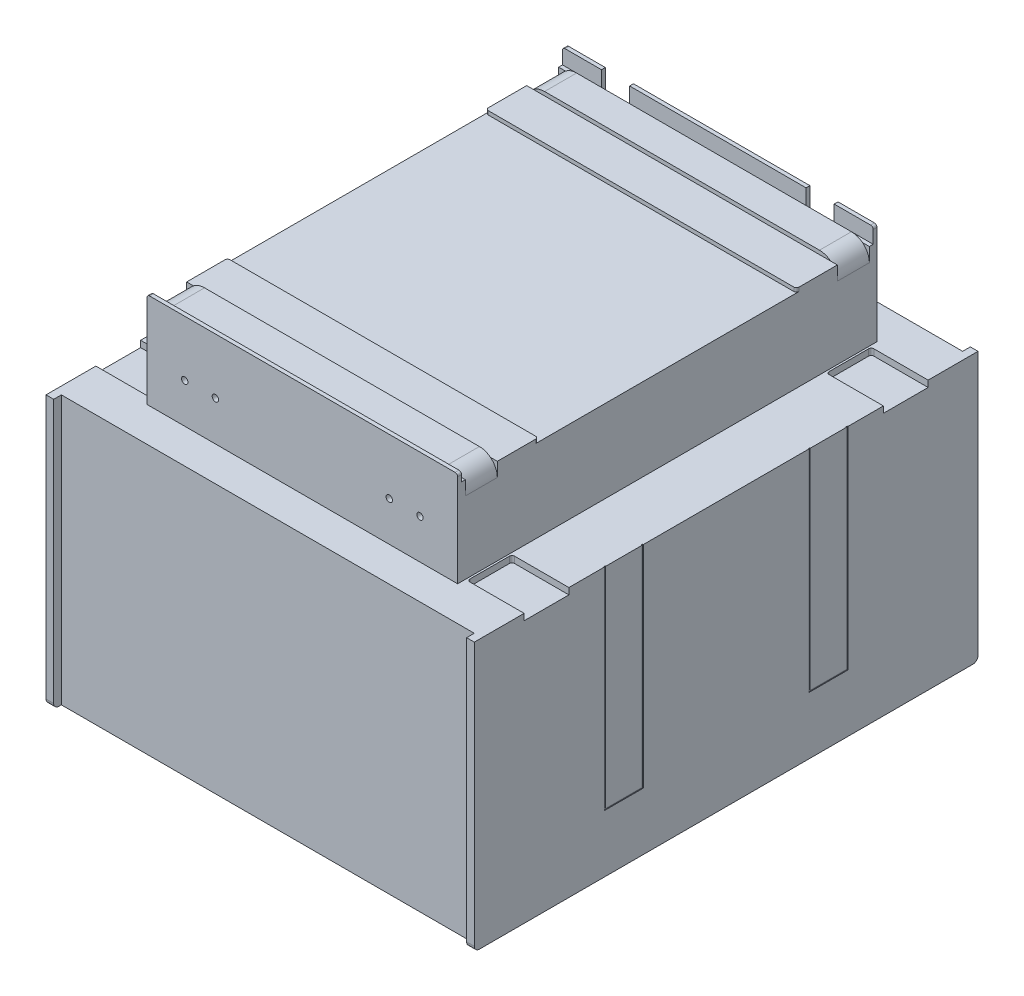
ISO-10303-21;
HEADER;
FILE_DESCRIPTION(('STEP AP214'),'2;1');
FILE_NAME('part.step','',(''),(''),'','','');
FILE_SCHEMA(('AUTOMOTIVE_DESIGN { 1 0 10303 214 1 1 1 1 }'));
ENDSEC;
DATA;
#1=APPLICATION_CONTEXT('core data for automotive mechanical design processes');
#2=APPLICATION_PROTOCOL_DEFINITION('international standard','automotive_design',2000,#1);
#3=PRODUCT_CONTEXT('',#1,'mechanical');
#4=PRODUCT('Part','Part','',(#3));
#5=PRODUCT_RELATED_PRODUCT_CATEGORY('part','',(#4));
#6=PRODUCT_DEFINITION_FORMATION('','',#4);
#7=PRODUCT_DEFINITION_CONTEXT('part definition',#1,'design');
#8=PRODUCT_DEFINITION('design','',#6,#7);
#9=PRODUCT_DEFINITION_SHAPE('','',#8);
#10=(LENGTH_UNIT() NAMED_UNIT(*) SI_UNIT(.MILLI.,.METRE.));
#11=(NAMED_UNIT(*) PLANE_ANGLE_UNIT() SI_UNIT($,.RADIAN.));
#12=(NAMED_UNIT(*) SI_UNIT($,.STERADIAN.) SOLID_ANGLE_UNIT());
#13=UNCERTAINTY_MEASURE_WITH_UNIT(LENGTH_MEASURE(1.E-05),#10,'distance_accuracy_value','');
#14=(GEOMETRIC_REPRESENTATION_CONTEXT(3) GLOBAL_UNCERTAINTY_ASSIGNED_CONTEXT((#13)) GLOBAL_UNIT_ASSIGNED_CONTEXT((#10,
#11,#12)) REPRESENTATION_CONTEXT('',''));
#15=CARTESIAN_POINT('',(0.,0.,0.));
#16=DIRECTION('',(0.,0.,1.));
#17=DIRECTION('',(1.,0.,0.));
#18=AXIS2_PLACEMENT_3D('',#15,#16,#17);
#19=CARTESIAN_POINT('',(0.,10.,0.));
#20=DIRECTION('',(0.,-1.,0.));
#21=DIRECTION('',(0.,0.,-1.));
#22=AXIS2_PLACEMENT_3D('',#19,#20,#21);
#23=CYLINDRICAL_SURFACE('',#22,80.5);
#24=CARTESIAN_POINT('',(0.,10.,0.));
#25=DIRECTION('',(0.,1.,0.));
#26=DIRECTION('',(0.,0.,1.));
#27=AXIS2_PLACEMENT_3D('',#24,#25,#26);
#28=CIRCLE('',#27,80.5);
#29=CARTESIAN_POINT('',(0.,10.,80.5));
#30=VERTEX_POINT('',#29);
#31=EDGE_CURVE('E12',#30,#30,#28,.T.);
#32=ORIENTED_EDGE('',*,*,#31,.F.);
#33=EDGE_LOOP('',(#32));
#34=FACE_BOUND('',#33,.T.);
#35=CARTESIAN_POINT('',(0.,0.,0.));
#36=DIRECTION('',(0.,1.,0.));
#37=DIRECTION('',(0.,0.,1.));
#38=AXIS2_PLACEMENT_3D('',#35,#36,#37);
#39=CIRCLE('',#38,80.5);
#40=CARTESIAN_POINT('',(0.,0.,80.5));
#41=VERTEX_POINT('',#40);
#42=EDGE_CURVE('E48',#41,#41,#39,.T.);
#43=ORIENTED_EDGE('',*,*,#42,.T.);
#44=EDGE_LOOP('',(#43));
#45=FACE_BOUND('',#44,.T.);
#46=ADVANCED_FACE('F45',(#34,#45),#23,.T.);
#47=CARTESIAN_POINT('',(0.,10.,0.));
#48=DIRECTION('',(0.,1.,0.));
#49=DIRECTION('',(0.,0.,1.));
#50=AXIS2_PLACEMENT_3D('',#47,#48,#49);
#51=PLANE('',#50);
#52=ORIENTED_EDGE('',*,*,#31,.T.);
#53=EDGE_LOOP('',(#52));
#54=FACE_BOUND('',#53,.T.);
#55=ADVANCED_FACE('F60',(#54),#51,.T.);
#56=CARTESIAN_POINT('',(0.,0.,0.));
#57=DIRECTION('',(0.,1.,0.));
#58=DIRECTION('',(0.,0.,1.));
#59=AXIS2_PLACEMENT_3D('',#56,#57,#58);
#60=PLANE('',#59);
#61=ORIENTED_EDGE('',*,*,#42,.F.);
#62=EDGE_LOOP('',(#61));
#63=FACE_BOUND('',#62,.T.);
#64=ADVANCED_FACE('F58',(#63),#60,.F.);
#65=CLOSED_SHELL('',(#46,#55,#64));
#66=MANIFOLD_SOLID_BREP('B2_NOT_SHOWN',#65);
#67=CARTESIAN_POINT('',(0.,-2.00000000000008,0.));
#68=DIRECTION('',(0.,-1.,0.));
#69=DIRECTION('',(1.,0.,0.));
#70=AXIS2_PLACEMENT_3D('',#67,#68,#69);
#71=CYLINDRICAL_SURFACE('',#70,130.5);
#72=CARTESIAN_POINT('',(0.,-2.00000000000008,0.));
#73=DIRECTION('',(0.,1.,0.));
#74=DIRECTION('',(-1.,0.,0.));
#75=AXIS2_PLACEMENT_3D('',#72,#73,#74);
#76=CIRCLE('',#75,130.5);
#77=CARTESIAN_POINT('',(-130.5,-2.00000000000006,0.));
#78=VERTEX_POINT('',#77);
#79=EDGE_CURVE('E44',#78,#78,#76,.T.);
#80=ORIENTED_EDGE('',*,*,#79,.F.);
#81=EDGE_LOOP('',(#80));
#82=FACE_BOUND('',#81,.T.);
#83=CARTESIAN_POINT('',(0.,-5.00000000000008,0.));
#84=DIRECTION('',(0.,1.,0.));
#85=DIRECTION('',(-1.,0.,0.));
#86=AXIS2_PLACEMENT_3D('',#83,#84,#85);
#87=CIRCLE('',#86,130.5);
#88=CARTESIAN_POINT('',(-130.5,-5.00000000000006,0.));
#89=VERTEX_POINT('',#88);
#90=EDGE_CURVE('E97',#89,#89,#87,.T.);
#91=ORIENTED_EDGE('',*,*,#90,.T.);
#92=EDGE_LOOP('',(#91));
#93=FACE_BOUND('',#92,.T.);
#94=ADVANCED_FACE('F94',(#82,#93),#71,.T.);
#95=CARTESIAN_POINT('',(0.,-2.00000000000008,0.));
#96=DIRECTION('',(0.,1.,0.));
#97=DIRECTION('',(-1.,0.,0.));
#98=AXIS2_PLACEMENT_3D('',#95,#96,#97);
#99=PLANE('',#98);
#100=ORIENTED_EDGE('',*,*,#79,.T.);
#101=EDGE_LOOP('',(#100));
#102=FACE_BOUND('',#101,.T.);
#103=ADVANCED_FACE('F109',(#102),#99,.T.);
#104=CARTESIAN_POINT('',(0.,-5.00000000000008,0.));
#105=DIRECTION('',(0.,1.,0.));
#106=DIRECTION('',(-1.,0.,0.));
#107=AXIS2_PLACEMENT_3D('',#104,#105,#106);
#108=PLANE('',#107);
#109=ORIENTED_EDGE('',*,*,#90,.F.);
#110=EDGE_LOOP('',(#109));
#111=FACE_BOUND('',#110,.T.);
#112=ADVANCED_FACE('F107',(#111),#108,.F.);
#113=CLOSED_SHELL('',(#94,#103,#112));
#114=MANIFOLD_SOLID_BREP('B7_NOT_SHOWN',#113);
#115=CARTESIAN_POINT('',(0.,10.,0.));
#116=DIRECTION('',(0.,-1.,0.));
#117=DIRECTION('',(0.,0.,-1.));
#118=AXIS2_PLACEMENT_3D('',#115,#116,#117);
#119=CYLINDRICAL_SURFACE('',#118,82.);
#120=CARTESIAN_POINT('',(0.,10.,0.));
#121=DIRECTION('',(0.,1.,0.));
#122=DIRECTION('',(0.,0.,1.));
#123=AXIS2_PLACEMENT_3D('',#120,#121,#122);
#124=CIRCLE('',#123,82.);
#125=CARTESIAN_POINT('',(0.,10.,82.));
#126=VERTEX_POINT('',#125);
#127=EDGE_CURVE('E93',#126,#126,#124,.T.);
#128=ORIENTED_EDGE('',*,*,#127,.F.);
#129=EDGE_LOOP('',(#128));
#130=FACE_BOUND('',#129,.T.);
#131=CARTESIAN_POINT('',(0.,0.,0.));
#132=DIRECTION('',(0.,1.,0.));
#133=DIRECTION('',(0.,0.,1.));
#134=AXIS2_PLACEMENT_3D('',#131,#132,#133);
#135=CIRCLE('',#134,82.);
#136=CARTESIAN_POINT('',(0.,0.,82.));
#137=VERTEX_POINT('',#136);
#138=EDGE_CURVE('E148',#137,#137,#135,.T.);
#139=ORIENTED_EDGE('',*,*,#138,.T.);
#140=EDGE_LOOP('',(#139));
#141=FACE_BOUND('',#140,.T.);
#142=ADVANCED_FACE('F145',(#130,#141),#119,.T.);
#143=CARTESIAN_POINT('',(0.,10.,0.));
#144=DIRECTION('',(0.,1.,0.));
#145=DIRECTION('',(0.,0.,1.));
#146=AXIS2_PLACEMENT_3D('',#143,#144,#145);
#147=PLANE('',#146);
#148=ORIENTED_EDGE('',*,*,#127,.T.);
#149=EDGE_LOOP('',(#148));
#150=FACE_BOUND('',#149,.T.);
#151=ADVANCED_FACE('F160',(#150),#147,.T.);
#152=CARTESIAN_POINT('',(0.,0.,0.));
#153=DIRECTION('',(0.,1.,0.));
#154=DIRECTION('',(0.,0.,1.));
#155=AXIS2_PLACEMENT_3D('',#152,#153,#154);
#156=PLANE('',#155);
#157=ORIENTED_EDGE('',*,*,#138,.F.);
#158=EDGE_LOOP('',(#157));
#159=FACE_BOUND('',#158,.T.);
#160=ADVANCED_FACE('F158',(#159),#156,.F.);
#161=CLOSED_SHELL('',(#142,#151,#160));
#162=MANIFOLD_SOLID_BREP('B39_NOT_SHOWN',#161);
#163=CARTESIAN_POINT('',(28.0000000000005,-204.,-79.9999999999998));
#164=DIRECTION('',(0.,-1.,0.));
#165=DIRECTION('',(0.,0.,1.));
#166=AXIS2_PLACEMENT_3D('',#163,#164,#165);
#167=PLANE('',#166);
#168=DIRECTION('',(0.,0.,1.));
#169=VECTOR('',#168,1.);
#170=CARTESIAN_POINT('',(28.5000000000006,-204.,-80.4999999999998));
#171=LINE('',#170,#169);
#172=CARTESIAN_POINT('',(28.5000000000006,-204.,-80.4999999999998));
#173=VERTEX_POINT('',#172);
#174=CARTESIAN_POINT('',(28.5000000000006,-204.,-79.4999999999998));
#175=VERTEX_POINT('',#174);
#176=EDGE_CURVE('E265',#173,#175,#171,.T.);
#177=ORIENTED_EDGE('',*,*,#176,.T.);
#178=DIRECTION('',(-1.,0.,0.));
#179=VECTOR('',#178,1.);
#180=CARTESIAN_POINT('',(27.5000000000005,-204.,-79.4999999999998));
#181=LINE('',#180,#179);
#182=CARTESIAN_POINT('',(27.5000000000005,-204.,-79.4999999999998));
#183=VERTEX_POINT('',#182);
#184=EDGE_CURVE('E268',#175,#183,#181,.T.);
#185=ORIENTED_EDGE('',*,*,#184,.T.);
#186=DIRECTION('',(0.,0.,-1.));
#187=VECTOR('',#186,1.);
#188=CARTESIAN_POINT('',(27.5000000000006,-204.,-80.4999999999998));
#189=LINE('',#188,#187);
#190=CARTESIAN_POINT('',(27.5000000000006,-204.,-80.4999999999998));
#191=VERTEX_POINT('',#190);
#192=EDGE_CURVE('E271',#183,#191,#189,.T.);
#193=ORIENTED_EDGE('',*,*,#192,.T.);
#194=DIRECTION('',(1.,0.,0.));
#195=VECTOR('',#194,1.);
#196=CARTESIAN_POINT('',(27.5000000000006,-204.,-80.4999999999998));
#197=LINE('',#196,#195);
#198=EDGE_CURVE('E254',#191,#173,#197,.T.);
#199=ORIENTED_EDGE('',*,*,#198,.T.);
#200=EDGE_LOOP('',(#177,#185,#193,#199));
#201=FACE_BOUND('',#200,.T.);
#202=CARTESIAN_POINT('',(28.0000000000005,-204.,-79.9999999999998));
#203=DIRECTION('',(0.,1.,0.));
#204=DIRECTION('',(0.,0.,-1.));
#205=AXIS2_PLACEMENT_3D('',#202,#203,#204);
#206=CIRCLE('',#205,25.);
#207=CARTESIAN_POINT('',(28.0000000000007,-204.,-105.));
#208=VERTEX_POINT('',#207);
#209=EDGE_CURVE('E250',#208,#208,#206,.F.);
#210=ORIENTED_EDGE('',*,*,#209,.F.);
#211=EDGE_LOOP('',(#210));
#212=FACE_BOUND('',#211,.T.);
#213=ADVANCED_FACE('F196',(#201,#212),#167,.F.);
#214=CARTESIAN_POINT('',(28.0000000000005,-742.779220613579,-79.9999999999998));
#215=DIRECTION('',(0.,1.,0.));
#216=DIRECTION('',(0.,0.,-1.));
#217=AXIS2_PLACEMENT_3D('',#214,#215,#216);
#218=CYLINDRICAL_SURFACE('',#217,45.);
#219=CARTESIAN_POINT('',(28.0000000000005,-265.5,-79.9999999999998));
#220=DIRECTION('',(0.,-1.,0.));
#221=DIRECTION('',(0.,0.,1.));
#222=AXIS2_PLACEMENT_3D('',#219,#220,#221);
#223=CIRCLE('',#222,45.);
#224=CARTESIAN_POINT('',(28.0000000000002,-265.5,-34.9999999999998));
#225=VERTEX_POINT('',#224);
#226=EDGE_CURVE('E279',#225,#225,#223,.T.);
#227=ORIENTED_EDGE('',*,*,#226,.T.);
#228=EDGE_LOOP('',(#227));
#229=FACE_BOUND('',#228,.T.);
#230=CARTESIAN_POINT('',(28.0000000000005,-275.5,-79.9999999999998));
#231=DIRECTION('',(0.,-1.,0.));
#232=DIRECTION('',(0.,0.,1.));
#233=AXIS2_PLACEMENT_3D('',#230,#231,#232);
#234=CIRCLE('',#233,45.);
#235=CARTESIAN_POINT('',(28.0000000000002,-275.5,-34.9999999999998));
#236=VERTEX_POINT('',#235);
#237=EDGE_CURVE('E143',#236,#236,#234,.T.);
#238=ORIENTED_EDGE('',*,*,#237,.F.);
#239=EDGE_LOOP('',(#238));
#240=FACE_BOUND('',#239,.T.);
#241=ADVANCED_FACE('F198',(#229,#240),#218,.T.);
#242=CARTESIAN_POINT('',(27.5000000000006,-742.779220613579,-80.4999999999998));
#243=DIRECTION('',(0.,0.,1.));
#244=DIRECTION('',(1.,0.,0.));
#245=AXIS2_PLACEMENT_3D('',#242,#243,#244);
#246=PLANE('',#245);
#247=DIRECTION('',(0.,1.,0.));
#248=VECTOR('',#247,1.);
#249=CARTESIAN_POINT('',(27.5000000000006,-742.779220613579,-80.4999999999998));
#250=LINE('',#249,#248);
#251=CARTESIAN_POINT('',(27.5000000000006,-275.5,-80.4999999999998));
#252=VERTEX_POINT('',#251);
#253=EDGE_CURVE('E246',#252,#191,#250,.T.);
#254=ORIENTED_EDGE('',*,*,#253,.F.);
#255=DIRECTION('',(1.,0.,0.));
#256=VECTOR('',#255,1.);
#257=CARTESIAN_POINT('',(27.5000000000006,-275.5,-80.4999999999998));
#258=LINE('',#257,#256);
#259=CARTESIAN_POINT('',(28.5000000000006,-275.5,-80.4999999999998));
#260=VERTEX_POINT('',#259);
#261=EDGE_CURVE('E200',#252,#260,#258,.T.);
#262=ORIENTED_EDGE('',*,*,#261,.T.);
#263=DIRECTION('',(0.,1.,0.));
#264=VECTOR('',#263,1.);
#265=CARTESIAN_POINT('',(28.5000000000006,-742.779220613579,-80.4999999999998));
#266=LINE('',#265,#264);
#267=EDGE_CURVE('E219',#260,#173,#266,.T.);
#268=ORIENTED_EDGE('',*,*,#267,.T.);
#269=ORIENTED_EDGE('',*,*,#198,.F.);
#270=EDGE_LOOP('',(#254,#262,#268,#269));
#271=FACE_BOUND('',#270,.T.);
#272=ADVANCED_FACE('F252',(#271),#246,.T.);
#273=CARTESIAN_POINT('',(27.5000000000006,-742.779220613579,-80.4999999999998));
#274=DIRECTION('',(1.,0.,0.));
#275=DIRECTION('',(0.,0.,-1.));
#276=AXIS2_PLACEMENT_3D('',#273,#274,#275);
#277=PLANE('',#276);
#278=DIRECTION('',(0.,1.,0.));
#279=VECTOR('',#278,1.);
#280=CARTESIAN_POINT('',(27.5000000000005,-742.779220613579,-79.4999999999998));
#281=LINE('',#280,#279);
#282=CARTESIAN_POINT('',(27.5000000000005,-275.5,-79.4999999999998));
#283=VERTEX_POINT('',#282);
#284=EDGE_CURVE('E247',#283,#183,#281,.T.);
#285=ORIENTED_EDGE('',*,*,#284,.F.);
#286=DIRECTION('',(0.,0.,-1.));
#287=VECTOR('',#286,1.);
#288=CARTESIAN_POINT('',(27.5000000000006,-275.5,-80.4999999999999));
#289=LINE('',#288,#287);
#290=EDGE_CURVE('E239',#283,#252,#289,.T.);
#291=ORIENTED_EDGE('',*,*,#290,.T.);
#292=ORIENTED_EDGE('',*,*,#253,.T.);
#293=ORIENTED_EDGE('',*,*,#192,.F.);
#294=EDGE_LOOP('',(#285,#291,#292,#293));
#295=FACE_BOUND('',#294,.T.);
#296=ADVANCED_FACE('F244',(#295),#277,.T.);
#297=CARTESIAN_POINT('',(27.5000000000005,-742.779220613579,-79.4999999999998));
#298=DIRECTION('',(0.,0.,-1.));
#299=DIRECTION('',(-1.,0.,0.));
#300=AXIS2_PLACEMENT_3D('',#297,#298,#299);
#301=PLANE('',#300);
#302=DIRECTION('',(0.,1.,0.));
#303=VECTOR('',#302,1.);
#304=CARTESIAN_POINT('',(28.5000000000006,-742.779220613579,-79.4999999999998));
#305=LINE('',#304,#303);
#306=CARTESIAN_POINT('',(28.5000000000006,-275.5,-79.4999999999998));
#307=VERTEX_POINT('',#306);
#308=EDGE_CURVE('E242',#307,#175,#305,.T.);
#309=ORIENTED_EDGE('',*,*,#308,.F.);
#310=DIRECTION('',(-1.,0.,0.));
#311=VECTOR('',#310,1.);
#312=CARTESIAN_POINT('',(27.5000000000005,-275.5,-79.4999999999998));
#313=LINE('',#312,#311);
#314=EDGE_CURVE('E249',#307,#283,#313,.T.);
#315=ORIENTED_EDGE('',*,*,#314,.T.);
#316=ORIENTED_EDGE('',*,*,#284,.T.);
#317=ORIENTED_EDGE('',*,*,#184,.F.);
#318=EDGE_LOOP('',(#309,#315,#316,#317));
#319=FACE_BOUND('',#318,.T.);
#320=ADVANCED_FACE('F269',(#319),#301,.T.);
#321=CARTESIAN_POINT('',(28.5000000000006,-742.779220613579,-80.4999999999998));
#322=DIRECTION('',(-1.,0.,0.));
#323=DIRECTION('',(0.,0.,1.));
#324=AXIS2_PLACEMENT_3D('',#321,#322,#323);
#325=PLANE('',#324);
#326=ORIENTED_EDGE('',*,*,#267,.F.);
#327=DIRECTION('',(0.,0.,1.));
#328=VECTOR('',#327,1.);
#329=CARTESIAN_POINT('',(28.5000000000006,-275.5,-80.4999999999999));
#330=LINE('',#329,#328);
#331=EDGE_CURVE('E212',#260,#307,#330,.T.);
#332=ORIENTED_EDGE('',*,*,#331,.T.);
#333=ORIENTED_EDGE('',*,*,#308,.T.);
#334=ORIENTED_EDGE('',*,*,#176,.F.);
#335=EDGE_LOOP('',(#326,#332,#333,#334));
#336=FACE_BOUND('',#335,.T.);
#337=ADVANCED_FACE('F263',(#336),#325,.T.);
#338=CARTESIAN_POINT('',(-347.628426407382,-275.5,-101.000000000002));
#339=DIRECTION('',(0.,-1.,0.));
#340=DIRECTION('',(0.,0.,1.));
#341=AXIS2_PLACEMENT_3D('',#338,#339,#340);
#342=PLANE('',#341);
#343=ORIENTED_EDGE('',*,*,#331,.F.);
#344=ORIENTED_EDGE('',*,*,#261,.F.);
#345=ORIENTED_EDGE('',*,*,#290,.F.);
#346=ORIENTED_EDGE('',*,*,#314,.F.);
#347=EDGE_LOOP('',(#343,#344,#345,#346));
#348=FACE_BOUND('',#347,.T.);
#349=ORIENTED_EDGE('',*,*,#237,.T.);
#350=EDGE_LOOP('',(#349));
#351=FACE_BOUND('',#350,.T.);
#352=ADVANCED_FACE('F237',(#348,#351),#342,.T.);
#353=CARTESIAN_POINT('',(28.0000000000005,-76.7207793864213,-79.9999999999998));
#354=DIRECTION('',(0.,-1.,0.));
#355=DIRECTION('',(0.,0.,1.));
#356=AXIS2_PLACEMENT_3D('',#353,#354,#355);
#357=CYLINDRICAL_SURFACE('',#356,25.);
#358=CARTESIAN_POINT('',(28.0000000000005,-265.5,-79.9999999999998));
#359=DIRECTION('',(0.,-1.,0.));
#360=DIRECTION('',(0.,0.,1.));
#361=AXIS2_PLACEMENT_3D('',#358,#359,#360);
#362=CIRCLE('',#361,25.);
#363=CARTESIAN_POINT('',(28.0000000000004,-265.5,-54.9999999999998));
#364=VERTEX_POINT('',#363);
#365=EDGE_CURVE('E282',#364,#364,#362,.T.);
#366=ORIENTED_EDGE('',*,*,#365,.F.);
#367=EDGE_LOOP('',(#366));
#368=FACE_BOUND('',#367,.T.);
#369=ORIENTED_EDGE('',*,*,#209,.T.);
#370=EDGE_LOOP('',(#369));
#371=FACE_BOUND('',#370,.T.);
#372=ADVANCED_FACE('F288',(#368,#371),#357,.T.);
#373=CARTESIAN_POINT('',(0.,-265.5,0.));
#374=DIRECTION('',(0.,-1.,0.));
#375=DIRECTION('',(0.,0.,1.));
#376=AXIS2_PLACEMENT_3D('',#373,#374,#375);
#377=PLANE('',#376);
#378=ORIENTED_EDGE('',*,*,#365,.T.);
#379=EDGE_LOOP('',(#378));
#380=FACE_BOUND('',#379,.T.);
#381=ORIENTED_EDGE('',*,*,#226,.F.);
#382=EDGE_LOOP('',(#381));
#383=FACE_BOUND('',#382,.T.);
#384=ADVANCED_FACE('F307',(#380,#383),#377,.F.);
#385=CLOSED_SHELL('',(#213,#241,#272,#296,#320,#337,#352,#372,#384));
#386=MANIFOLD_SOLID_BREP('B88',#385);
#387=CARTESIAN_POINT('',(347.628426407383,0.,-164.));
#388=DIRECTION('',(0.,0.,-1.));
#389=DIRECTION('',(0.,1.,0.));
#390=AXIS2_PLACEMENT_3D('',#387,#388,#389);
#391=PLANE('',#390);
#392=CARTESIAN_POINT('',(92.,31.,-164.));
#393=DIRECTION('',(0.,0.,-1.));
#394=DIRECTION('',(0.,1.,0.));
#395=AXIS2_PLACEMENT_3D('',#392,#393,#394);
#396=CIRCLE('',#395,2.5);
#397=CARTESIAN_POINT('',(92.,33.5,-164.));
#398=VERTEX_POINT('',#397);
#399=EDGE_CURVE('E376',#398,#398,#396,.F.);
#400=ORIENTED_EDGE('',*,*,#399,.T.);
#401=EDGE_LOOP('',(#400));
#402=FACE_BOUND('',#401,.T.);
#403=CARTESIAN_POINT('',(68.,31.,-164.));
#404=DIRECTION('',(0.,0.,-1.));
#405=DIRECTION('',(0.,1.,0.));
#406=AXIS2_PLACEMENT_3D('',#403,#404,#405);
#407=CIRCLE('',#406,2.5);
#408=CARTESIAN_POINT('',(68.,33.5,-164.));
#409=VERTEX_POINT('',#408);
#410=EDGE_CURVE('E1201',#409,#409,#407,.F.);
#411=ORIENTED_EDGE('',*,*,#410,.T.);
#412=EDGE_LOOP('',(#411));
#413=FACE_BOUND('',#412,.T.);
#414=CARTESIAN_POINT('',(-92.,31.,-164.));
#415=DIRECTION('',(0.,0.,-1.));
#416=DIRECTION('',(0.,1.,0.));
#417=AXIS2_PLACEMENT_3D('',#414,#415,#416);
#418=CIRCLE('',#417,2.5);
#419=CARTESIAN_POINT('',(-92.,33.5,-164.));
#420=VERTEX_POINT('',#419);
#421=EDGE_CURVE('E1466',#420,#420,#418,.T.);
#422=ORIENTED_EDGE('',*,*,#421,.F.);
#423=EDGE_LOOP('',(#422));
#424=FACE_BOUND('',#423,.T.);
#425=CARTESIAN_POINT('',(-68.,31.,-164.));
#426=DIRECTION('',(0.,0.,-1.));
#427=DIRECTION('',(0.,1.,0.));
#428=AXIS2_PLACEMENT_3D('',#425,#426,#427);
#429=CIRCLE('',#428,2.5);
#430=CARTESIAN_POINT('',(-68.,33.5,-164.));
#431=VERTEX_POINT('',#430);
#432=EDGE_CURVE('E1470',#431,#431,#429,.T.);
#433=ORIENTED_EDGE('',*,*,#432,.F.);
#434=EDGE_LOOP('',(#433));
#435=FACE_BOUND('',#434,.T.);
#436=DIRECTION('',(-1.,0.,0.));
#437=VECTOR('',#436,1.);
#438=CARTESIAN_POINT('',(347.628426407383,79.5,-164.));
#439=LINE('',#438,#437);
#440=CARTESIAN_POINT('',(-91.,79.5,-164.));
#441=VERTEX_POINT('',#440);
#442=CARTESIAN_POINT('',(-119.5,79.5,-164.));
#443=VERTEX_POINT('',#442);
#444=EDGE_CURVE('E2060',#441,#443,#439,.T.);
#445=ORIENTED_EDGE('',*,*,#444,.F.);
#446=DIRECTION('',(0.,-1.,0.));
#447=VECTOR('',#446,1.);
#448=CARTESIAN_POINT('',(-91.,79.5,-164.));
#449=LINE('',#448,#447);
#450=CARTESIAN_POINT('',(-91.,64.,-164.));
#451=VERTEX_POINT('',#450);
#452=EDGE_CURVE('E1188',#441,#451,#449,.T.);
#453=ORIENTED_EDGE('',*,*,#452,.T.);
#454=DIRECTION('',(0.707106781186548,-0.707106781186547,0.));
#455=VECTOR('',#454,1.);
#456=CARTESIAN_POINT('',(-91.,64.,-164.));
#457=LINE('',#456,#455);
#458=CARTESIAN_POINT('',(-86.5,59.5,-164.));
#459=VERTEX_POINT('',#458);
#460=EDGE_CURVE('E1192',#451,#459,#457,.T.);
#461=ORIENTED_EDGE('',*,*,#460,.T.);
#462=DIRECTION('',(1.,0.,0.));
#463=VECTOR('',#462,1.);
#464=CARTESIAN_POINT('',(-86.5,59.5,-164.));
#465=LINE('',#464,#463);
#466=CARTESIAN_POINT('',(-73.5,59.5,-164.));
#467=VERTEX_POINT('',#466);
#468=EDGE_CURVE('E1195',#459,#467,#465,.T.);
#469=ORIENTED_EDGE('',*,*,#468,.T.);
#470=DIRECTION('',(0.707106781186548,0.707106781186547,0.));
#471=VECTOR('',#470,1.);
#472=CARTESIAN_POINT('',(-73.5,59.5,-164.));
#473=LINE('',#472,#471);
#474=CARTESIAN_POINT('',(-69.,64.,-164.));
#475=VERTEX_POINT('',#474);
#476=EDGE_CURVE('E1158',#467,#475,#473,.T.);
#477=ORIENTED_EDGE('',*,*,#476,.T.);
#478=DIRECTION('',(0.,1.,0.));
#479=VECTOR('',#478,1.);
#480=CARTESIAN_POINT('',(-69.,64.,-164.));
#481=LINE('',#480,#479);
#482=CARTESIAN_POINT('',(-69.,79.5,-164.));
#483=VERTEX_POINT('',#482);
#484=EDGE_CURVE('E1153',#475,#483,#481,.T.);
#485=ORIENTED_EDGE('',*,*,#484,.T.);
#486=CARTESIAN_POINT('',(69.,79.5,-164.));
#487=VERTEX_POINT('',#486);
#488=EDGE_CURVE('E2059',#487,#483,#439,.T.);
#489=ORIENTED_EDGE('',*,*,#488,.F.);
#490=DIRECTION('',(0.,1.,0.));
#491=VECTOR('',#490,1.);
#492=CARTESIAN_POINT('',(69.,64.,-164.));
#493=LINE('',#492,#491);
#494=CARTESIAN_POINT('',(69.,64.,-164.));
#495=VERTEX_POINT('',#494);
#496=EDGE_CURVE('E1202',#495,#487,#493,.T.);
#497=ORIENTED_EDGE('',*,*,#496,.F.);
#498=DIRECTION('',(-0.707106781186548,0.707106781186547,0.));
#499=VECTOR('',#498,1.);
#500=CARTESIAN_POINT('',(73.5,59.5,-164.));
#501=LINE('',#500,#499);
#502=CARTESIAN_POINT('',(73.5,59.5,-164.));
#503=VERTEX_POINT('',#502);
#504=EDGE_CURVE('E1205',#503,#495,#501,.T.);
#505=ORIENTED_EDGE('',*,*,#504,.F.);
#506=DIRECTION('',(-1.,0.,0.));
#507=VECTOR('',#506,1.);
#508=CARTESIAN_POINT('',(86.5,59.5,-164.));
#509=LINE('',#508,#507);
#510=CARTESIAN_POINT('',(86.5,59.5,-164.));
#511=VERTEX_POINT('',#510);
#512=EDGE_CURVE('E1208',#511,#503,#509,.T.);
#513=ORIENTED_EDGE('',*,*,#512,.F.);
#514=DIRECTION('',(-0.707106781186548,-0.707106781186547,0.));
#515=VECTOR('',#514,1.);
#516=CARTESIAN_POINT('',(91.,64.,-164.));
#517=LINE('',#516,#515);
#518=CARTESIAN_POINT('',(91.,64.,-164.));
#519=VERTEX_POINT('',#518);
#520=EDGE_CURVE('E1211',#519,#511,#517,.T.);
#521=ORIENTED_EDGE('',*,*,#520,.F.);
#522=DIRECTION('',(0.,-1.,0.));
#523=VECTOR('',#522,1.);
#524=CARTESIAN_POINT('',(91.,79.5,-164.));
#525=LINE('',#524,#523);
#526=CARTESIAN_POINT('',(91.,79.5,-164.));
#527=VERTEX_POINT('',#526);
#528=EDGE_CURVE('E1214',#527,#519,#525,.T.);
#529=ORIENTED_EDGE('',*,*,#528,.F.);
#530=CARTESIAN_POINT('',(119.5,79.5,-164.));
#531=VERTEX_POINT('',#530);
#532=EDGE_CURVE('E1685',#531,#527,#439,.T.);
#533=ORIENTED_EDGE('',*,*,#532,.F.);
#534=CARTESIAN_POINT('',(119.5,77.5,-164.));
#535=DIRECTION('',(0.,0.,-1.));
#536=DIRECTION('',(0.,1.,0.));
#537=AXIS2_PLACEMENT_3D('',#534,#535,#536);
#538=CIRCLE('',#537,2.);
#539=CARTESIAN_POINT('',(121.5,77.5,-164.));
#540=VERTEX_POINT('',#539);
#541=EDGE_CURVE('E2056',#531,#540,#538,.T.);
#542=ORIENTED_EDGE('',*,*,#541,.T.);
#543=DIRECTION('',(0.,1.,0.));
#544=VECTOR('',#543,1.);
#545=CARTESIAN_POINT('',(121.5,0.,-164.));
#546=LINE('',#545,#544);
#547=CARTESIAN_POINT('',(121.5,0.,-164.));
#548=VERTEX_POINT('',#547);
#549=EDGE_CURVE('E1654',#548,#540,#546,.T.);
#550=ORIENTED_EDGE('',*,*,#549,.F.);
#551=DIRECTION('',(-1.,0.,0.));
#552=VECTOR('',#551,1.);
#553=CARTESIAN_POINT('',(347.628426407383,0.,-164.));
#554=LINE('',#553,#552);
#555=CARTESIAN_POINT('',(-121.5,0.,-164.));
#556=VERTEX_POINT('',#555);
#557=EDGE_CURVE('E1649',#548,#556,#554,.T.);
#558=ORIENTED_EDGE('',*,*,#557,.T.);
#559=DIRECTION('',(0.,1.,0.));
#560=VECTOR('',#559,1.);
#561=CARTESIAN_POINT('',(-121.5,0.,-164.));
#562=LINE('',#561,#560);
#563=CARTESIAN_POINT('',(-121.5,77.5,-164.));
#564=VERTEX_POINT('',#563);
#565=EDGE_CURVE('E1631',#556,#564,#562,.T.);
#566=ORIENTED_EDGE('',*,*,#565,.T.);
#567=CARTESIAN_POINT('',(-119.5,77.5,-164.));
#568=DIRECTION('',(0.,0.,-1.));
#569=DIRECTION('',(0.,1.,0.));
#570=AXIS2_PLACEMENT_3D('',#567,#568,#569);
#571=CIRCLE('',#570,2.);
#572=EDGE_CURVE('E1910',#564,#443,#571,.T.);
#573=ORIENTED_EDGE('',*,*,#572,.T.);
#574=EDGE_LOOP('',(#445,#453,#461,#469,#477,#485,#489,#497,#505,#513,#521,#529,#533,#542,#550,
#558,#566,#573));
#575=FACE_BOUND('',#574,.T.);
#576=ADVANCED_FACE('F372',(#402,#413,#424,#435,#575),#391,.T.);
#577=CARTESIAN_POINT('',(347.628426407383,79.5,-164.));
#578=DIRECTION('',(0.,1.,0.));
#579=DIRECTION('',(0.,0.,1.));
#580=AXIS2_PLACEMENT_3D('',#577,#578,#579);
#581=PLANE('',#580);
#582=DIRECTION('',(-1.,0.,0.));
#583=VECTOR('',#582,1.);
#584=CARTESIAN_POINT('',(347.628426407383,79.5,-161.));
#585=LINE('',#584,#583);
#586=CARTESIAN_POINT('',(-91.,79.5,-161.));
#587=VERTEX_POINT('',#586);
#588=CARTESIAN_POINT('',(-119.5,79.5,-161.));
#589=VERTEX_POINT('',#588);
#590=EDGE_CURVE('E1681',#587,#589,#585,.T.);
#591=ORIENTED_EDGE('',*,*,#590,.F.);
#592=DIRECTION('',(0.,0.,-1.));
#593=VECTOR('',#592,1.);
#594=CARTESIAN_POINT('',(-91.,79.5,-131.267862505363));
#595=LINE('',#594,#593);
#596=EDGE_CURVE('E1185',#587,#441,#595,.T.);
#597=ORIENTED_EDGE('',*,*,#596,.T.);
#598=ORIENTED_EDGE('',*,*,#444,.T.);
#599=DIRECTION('',(0.,0.,1.));
#600=VECTOR('',#599,1.);
#601=CARTESIAN_POINT('',(-119.5,79.5,-161.));
#602=LINE('',#601,#600);
#603=EDGE_CURVE('E2049',#443,#589,#602,.T.);
#604=ORIENTED_EDGE('',*,*,#603,.T.);
#605=EDGE_LOOP('',(#591,#597,#598,#604));
#606=FACE_BOUND('',#605,.T.);
#607=ADVANCED_FACE('F2230',(#606),#581,.T.);
#608=ORIENTED_EDGE('',*,*,#488,.T.);
#609=DIRECTION('',(0.,0.,-1.));
#610=VECTOR('',#609,1.);
#611=CARTESIAN_POINT('',(-69.,79.5,-131.267862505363));
#612=LINE('',#611,#610);
#613=CARTESIAN_POINT('',(-69.,79.5,-161.));
#614=VERTEX_POINT('',#613);
#615=EDGE_CURVE('E1189',#614,#483,#612,.T.);
#616=ORIENTED_EDGE('',*,*,#615,.F.);
#617=CARTESIAN_POINT('',(69.,79.5,-161.));
#618=VERTEX_POINT('',#617);
#619=EDGE_CURVE('E2069',#618,#614,#585,.T.);
#620=ORIENTED_EDGE('',*,*,#619,.F.);
#621=DIRECTION('',(0.,0.,-1.));
#622=VECTOR('',#621,1.);
#623=CARTESIAN_POINT('',(69.,79.5,-131.267862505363));
#624=LINE('',#623,#622);
#625=EDGE_CURVE('E1222',#618,#487,#624,.T.);
#626=ORIENTED_EDGE('',*,*,#625,.T.);
#627=EDGE_LOOP('',(#608,#616,#620,#626));
#628=FACE_BOUND('',#627,.T.);
#629=ADVANCED_FACE('F2236',(#628),#581,.T.);
#630=CARTESIAN_POINT('',(347.628426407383,74.5,-161.));
#631=DIRECTION('',(0.,0.,1.));
#632=DIRECTION('',(0.,-1.,0.));
#633=AXIS2_PLACEMENT_3D('',#630,#631,#632);
#634=PLANE('',#633);
#635=DIRECTION('',(-1.,0.,0.));
#636=VECTOR('',#635,1.);
#637=CARTESIAN_POINT('',(347.628426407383,67.5000000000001,-161.));
#638=LINE('',#637,#636);
#639=CARTESIAN_POINT('',(-91.0000000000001,67.5000000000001,-161.));
#640=VERTEX_POINT('',#639);
#641=CARTESIAN_POINT('',(-121.5,67.5000000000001,-161.));
#642=VERTEX_POINT('',#641);
#643=EDGE_CURVE('E1677',#640,#642,#638,.T.);
#644=ORIENTED_EDGE('',*,*,#643,.F.);
#645=DIRECTION('',(0.,-1.,0.));
#646=VECTOR('',#645,1.);
#647=CARTESIAN_POINT('',(-91.,79.5,-161.));
#648=LINE('',#647,#646);
#649=EDGE_CURVE('E389',#587,#640,#648,.T.);
#650=ORIENTED_EDGE('',*,*,#649,.F.);
#651=ORIENTED_EDGE('',*,*,#590,.T.);
#652=CARTESIAN_POINT('',(-119.5,77.5,-161.));
#653=DIRECTION('',(0.,0.,1.));
#654=DIRECTION('',(0.,-1.,0.));
#655=AXIS2_PLACEMENT_3D('',#652,#653,#654);
#656=CIRCLE('',#655,2.);
#657=CARTESIAN_POINT('',(-121.5,77.5,-161.));
#658=VERTEX_POINT('',#657);
#659=EDGE_CURVE('E2062',#589,#658,#656,.T.);
#660=ORIENTED_EDGE('',*,*,#659,.T.);
#661=DIRECTION('',(0.,-1.,0.));
#662=VECTOR('',#661,1.);
#663=CARTESIAN_POINT('',(-121.5,74.4999999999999,-161.));
#664=LINE('',#663,#662);
#665=EDGE_CURVE('E1633',#658,#642,#664,.T.);
#666=ORIENTED_EDGE('',*,*,#665,.T.);
#667=EDGE_LOOP('',(#644,#650,#651,#660,#666));
#668=FACE_BOUND('',#667,.T.);
#669=ADVANCED_FACE('F2203',(#668),#634,.T.);
#670=ORIENTED_EDGE('',*,*,#619,.T.);
#671=DIRECTION('',(0.,1.,0.));
#672=VECTOR('',#671,1.);
#673=CARTESIAN_POINT('',(-69.,64.,-161.));
#674=LINE('',#673,#672);
#675=CARTESIAN_POINT('',(-69.,67.5000000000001,-161.));
#676=VERTEX_POINT('',#675);
#677=EDGE_CURVE('E1167',#676,#614,#674,.T.);
#678=ORIENTED_EDGE('',*,*,#677,.F.);
#679=CARTESIAN_POINT('',(68.9999999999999,67.5000000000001,-161.));
#680=VERTEX_POINT('',#679);
#681=EDGE_CURVE('E3837',#680,#676,#638,.T.);
#682=ORIENTED_EDGE('',*,*,#681,.F.);
#683=DIRECTION('',(0.,1.,0.));
#684=VECTOR('',#683,1.);
#685=CARTESIAN_POINT('',(69.,64.,-161.));
#686=LINE('',#685,#684);
#687=EDGE_CURVE('E1223',#680,#618,#686,.T.);
#688=ORIENTED_EDGE('',*,*,#687,.T.);
#689=EDGE_LOOP('',(#670,#678,#682,#688));
#690=FACE_BOUND('',#689,.T.);
#691=ADVANCED_FACE('F2755',(#690),#634,.T.);
#692=DIRECTION('',(0.,0.,-1.));
#693=VECTOR('',#692,1.);
#694=CARTESIAN_POINT('',(91.,79.5,-131.267862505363));
#695=LINE('',#694,#693);
#696=CARTESIAN_POINT('',(91.,79.5,-161.));
#697=VERTEX_POINT('',#696);
#698=EDGE_CURVE('E1237',#697,#527,#695,.T.);
#699=ORIENTED_EDGE('',*,*,#698,.F.);
#700=CARTESIAN_POINT('',(119.5,79.5,-161.));
#701=VERTEX_POINT('',#700);
#702=EDGE_CURVE('E2066',#701,#697,#585,.T.);
#703=ORIENTED_EDGE('',*,*,#702,.F.);
#704=DIRECTION('',(0.,0.,1.));
#705=VECTOR('',#704,1.);
#706=CARTESIAN_POINT('',(119.5,79.5,-164.));
#707=LINE('',#706,#705);
#708=EDGE_CURVE('E1905',#701,#531,#707,.F.);
#709=ORIENTED_EDGE('',*,*,#708,.T.);
#710=ORIENTED_EDGE('',*,*,#532,.T.);
#711=EDGE_LOOP('',(#699,#703,#709,#710));
#712=FACE_BOUND('',#711,.T.);
#713=ADVANCED_FACE('F2238',(#712),#581,.T.);
#714=DIRECTION('',(0.,-1.,0.));
#715=VECTOR('',#714,1.);
#716=CARTESIAN_POINT('',(91.,79.5,-161.));
#717=LINE('',#716,#715);
#718=CARTESIAN_POINT('',(91.,67.5000000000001,-161.));
#719=VERTEX_POINT('',#718);
#720=EDGE_CURVE('E1217',#697,#719,#717,.T.);
#721=ORIENTED_EDGE('',*,*,#720,.T.);
#722=CARTESIAN_POINT('',(121.5,67.5000000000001,-161.));
#723=VERTEX_POINT('',#722);
#724=EDGE_CURVE('E1678',#723,#719,#638,.T.);
#725=ORIENTED_EDGE('',*,*,#724,.F.);
#726=DIRECTION('',(0.,-1.,0.));
#727=VECTOR('',#726,1.);
#728=CARTESIAN_POINT('',(121.5,74.4999999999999,-161.));
#729=LINE('',#728,#727);
#730=CARTESIAN_POINT('',(121.5,77.5,-161.));
#731=VERTEX_POINT('',#730);
#732=EDGE_CURVE('E1652',#731,#723,#729,.T.);
#733=ORIENTED_EDGE('',*,*,#732,.F.);
#734=CARTESIAN_POINT('',(119.5,77.5,-161.));
#735=DIRECTION('',(0.,0.,1.));
#736=DIRECTION('',(0.,-1.,0.));
#737=AXIS2_PLACEMENT_3D('',#734,#735,#736);
#738=CIRCLE('',#737,2.);
#739=EDGE_CURVE('E2052',#731,#701,#738,.T.);
#740=ORIENTED_EDGE('',*,*,#739,.T.);
#741=ORIENTED_EDGE('',*,*,#702,.T.);
#742=EDGE_LOOP('',(#721,#725,#733,#740,#741));
#743=FACE_BOUND('',#742,.T.);
#744=ADVANCED_FACE('F2402',(#743),#634,.T.);
#745=CARTESIAN_POINT('',(167.5,0.,197.));
#746=DIRECTION('',(-1.,0.,0.));
#747=DIRECTION('',(0.,-1.,0.));
#748=AXIS2_PLACEMENT_3D('',#745,#746,#747);
#749=PLANE('',#748);
#750=DIRECTION('',(0.,1.,0.));
#751=VECTOR('',#750,1.);
#752=CARTESIAN_POINT('',(167.5,0.,-95.25));
#753=LINE('',#752,#751);
#754=CARTESIAN_POINT('',(167.5,-165.,-95.25));
#755=VERTEX_POINT('',#754);
#756=CARTESIAN_POINT('',(167.5,0.,-95.25));
#757=VERTEX_POINT('',#756);
#758=EDGE_CURVE('E2047',#755,#757,#753,.T.);
#759=ORIENTED_EDGE('',*,*,#758,.F.);
#760=DIRECTION('',(0.,0.,1.));
#761=VECTOR('',#760,1.);
#762=CARTESIAN_POINT('',(167.5,-165.,-95.25));
#763=LINE('',#762,#761);
#764=CARTESIAN_POINT('',(167.5,-165.,-64.75));
#765=VERTEX_POINT('',#764);
#766=EDGE_CURVE('E1272',#755,#765,#763,.T.);
#767=ORIENTED_EDGE('',*,*,#766,.T.);
#768=DIRECTION('',(0.,1.,0.));
#769=VECTOR('',#768,1.);
#770=CARTESIAN_POINT('',(167.5,1.,-64.75));
#771=LINE('',#770,#769);
#772=CARTESIAN_POINT('',(167.5,0.,-64.75));
#773=VERTEX_POINT('',#772);
#774=EDGE_CURVE('E1260',#765,#773,#771,.T.);
#775=ORIENTED_EDGE('',*,*,#774,.T.);
#776=DIRECTION('',(0.,0.,-1.));
#777=VECTOR('',#776,1.);
#778=CARTESIAN_POINT('',(167.5,0.,197.));
#779=LINE('',#778,#777);
#780=CARTESIAN_POINT('',(167.5,0.,64.75));
#781=VERTEX_POINT('',#780);
#782=EDGE_CURVE('E3777',#781,#773,#779,.T.);
#783=ORIENTED_EDGE('',*,*,#782,.F.);
#784=DIRECTION('',(0.,1.,0.));
#785=VECTOR('',#784,1.);
#786=CARTESIAN_POINT('',(167.5,1.,64.75));
#787=LINE('',#786,#785);
#788=CARTESIAN_POINT('',(167.5,-165.,64.75));
#789=VERTEX_POINT('',#788);
#790=EDGE_CURVE('E1411',#789,#781,#787,.T.);
#791=ORIENTED_EDGE('',*,*,#790,.F.);
#792=DIRECTION('',(0.,0.,-1.));
#793=VECTOR('',#792,1.);
#794=CARTESIAN_POINT('',(167.5,-165.,95.25));
#795=LINE('',#794,#793);
#796=CARTESIAN_POINT('',(167.5,-165.,95.25));
#797=VERTEX_POINT('',#796);
#798=EDGE_CURVE('E1401',#797,#789,#795,.T.);
#799=ORIENTED_EDGE('',*,*,#798,.F.);
#800=DIRECTION('',(0.,1.,0.));
#801=VECTOR('',#800,1.);
#802=CARTESIAN_POINT('',(167.5,0.,95.25));
#803=LINE('',#802,#801);
#804=CARTESIAN_POINT('',(167.5,0.,95.25));
#805=VERTEX_POINT('',#804);
#806=EDGE_CURVE('E2024',#797,#805,#803,.T.);
#807=ORIENTED_EDGE('',*,*,#806,.T.);
#808=CARTESIAN_POINT('',(167.5,0.,123.));
#809=VERTEX_POINT('',#808);
#810=EDGE_CURVE('E1840',#809,#805,#779,.T.);
#811=ORIENTED_EDGE('',*,*,#810,.F.);
#812=DIRECTION('',(0.,1.,0.));
#813=VECTOR('',#812,1.);
#814=CARTESIAN_POINT('',(167.5,0.,123.));
#815=LINE('',#814,#813);
#816=CARTESIAN_POINT('',(167.5,-5.00000000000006,123.));
#817=VERTEX_POINT('',#816);
#818=EDGE_CURVE('E1523',#817,#809,#815,.T.);
#819=ORIENTED_EDGE('',*,*,#818,.F.);
#820=DIRECTION('',(0.,0.,-1.));
#821=VECTOR('',#820,1.);
#822=CARTESIAN_POINT('',(167.5,-5.00000000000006,158.));
#823=LINE('',#822,#821);
#824=CARTESIAN_POINT('',(167.5,-5.00000000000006,158.));
#825=VERTEX_POINT('',#824);
#826=EDGE_CURVE('E1529',#825,#817,#823,.T.);
#827=ORIENTED_EDGE('',*,*,#826,.F.);
#828=DIRECTION('',(0.,-1.,0.));
#829=VECTOR('',#828,1.);
#830=CARTESIAN_POINT('',(167.5,0.,158.));
#831=LINE('',#830,#829);
#832=CARTESIAN_POINT('',(167.5,0.,158.));
#833=VERTEX_POINT('',#832);
#834=EDGE_CURVE('E1512',#833,#825,#831,.T.);
#835=ORIENTED_EDGE('',*,*,#834,.F.);
#836=CARTESIAN_POINT('',(167.5,0.,197.));
#837=VERTEX_POINT('',#836);
#838=EDGE_CURVE('E1836',#837,#833,#779,.T.);
#839=ORIENTED_EDGE('',*,*,#838,.F.);
#840=DIRECTION('',(0.,1.,0.));
#841=VECTOR('',#840,1.);
#842=CARTESIAN_POINT('',(167.5,0.,197.));
#843=LINE('',#842,#841);
#844=CARTESIAN_POINT('',(167.5,-206.,197.));
#845=VERTEX_POINT('',#844);
#846=EDGE_CURVE('E1815',#845,#837,#843,.T.);
#847=ORIENTED_EDGE('',*,*,#846,.F.);
#848=CARTESIAN_POINT('',(167.5,-206.,193.));
#849=DIRECTION('',(-1.,0.,0.));
#850=DIRECTION('',(0.,-1.,0.));
#851=AXIS2_PLACEMENT_3D('',#848,#849,#850);
#852=CIRCLE('',#851,4.);
#853=CARTESIAN_POINT('',(167.5,-210.,193.));
#854=VERTEX_POINT('',#853);
#855=EDGE_CURVE('E1934',#845,#854,#852,.F.);
#856=ORIENTED_EDGE('',*,*,#855,.T.);
#857=DIRECTION('',(0.,0.,-1.));
#858=VECTOR('',#857,1.);
#859=CARTESIAN_POINT('',(167.5,-210.,197.));
#860=LINE('',#859,#858);
#861=CARTESIAN_POINT('',(167.5,-210.,-193.));
#862=VERTEX_POINT('',#861);
#863=EDGE_CURVE('E1839',#854,#862,#860,.T.);
#864=ORIENTED_EDGE('',*,*,#863,.T.);
#865=CARTESIAN_POINT('',(167.5,-206.,-193.));
#866=DIRECTION('',(-1.,0.,0.));
#867=DIRECTION('',(0.,-1.,0.));
#868=AXIS2_PLACEMENT_3D('',#865,#866,#867);
#869=CIRCLE('',#868,4.);
#870=CARTESIAN_POINT('',(167.5,-206.,-197.));
#871=VERTEX_POINT('',#870);
#872=EDGE_CURVE('E1936',#862,#871,#869,.F.);
#873=ORIENTED_EDGE('',*,*,#872,.T.);
#874=DIRECTION('',(0.,1.,0.));
#875=VECTOR('',#874,1.);
#876=CARTESIAN_POINT('',(167.5,0.,-197.));
#877=LINE('',#876,#875);
#878=CARTESIAN_POINT('',(167.5,0.,-197.));
#879=VERTEX_POINT('',#878);
#880=EDGE_CURVE('E1825',#871,#879,#877,.T.);
#881=ORIENTED_EDGE('',*,*,#880,.T.);
#882=CARTESIAN_POINT('',(167.5,0.,-158.));
#883=VERTEX_POINT('',#882);
#884=EDGE_CURVE('E1833',#883,#879,#779,.T.);
#885=ORIENTED_EDGE('',*,*,#884,.F.);
#886=DIRECTION('',(0.,1.,0.));
#887=VECTOR('',#886,1.);
#888=CARTESIAN_POINT('',(167.5,0.,-158.));
#889=LINE('',#888,#887);
#890=CARTESIAN_POINT('',(167.5,-5.,-158.));
#891=VERTEX_POINT('',#890);
#892=EDGE_CURVE('E1546',#891,#883,#889,.T.);
#893=ORIENTED_EDGE('',*,*,#892,.F.);
#894=DIRECTION('',(0.,0.,-1.));
#895=VECTOR('',#894,1.);
#896=CARTESIAN_POINT('',(167.5,-5.00000000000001,-123.));
#897=LINE('',#896,#895);
#898=CARTESIAN_POINT('',(167.5,-5.00000000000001,-123.));
#899=VERTEX_POINT('',#898);
#900=EDGE_CURVE('E1552',#899,#891,#897,.T.);
#901=ORIENTED_EDGE('',*,*,#900,.F.);
#902=DIRECTION('',(0.,-1.,0.));
#903=VECTOR('',#902,1.);
#904=CARTESIAN_POINT('',(167.5,0.,-123.));
#905=LINE('',#904,#903);
#906=CARTESIAN_POINT('',(167.5,0.,-123.));
#907=VERTEX_POINT('',#906);
#908=EDGE_CURVE('E1536',#907,#899,#905,.T.);
#909=ORIENTED_EDGE('',*,*,#908,.F.);
#910=EDGE_CURVE('E1841',#757,#907,#779,.T.);
#911=ORIENTED_EDGE('',*,*,#910,.F.);
#912=EDGE_LOOP('',(#759,#767,#775,#783,#791,#799,#807,#811,#819,#827,#835,#839,#847,#856,#864,
#873,#881,#885,#893,#901,#909,#911));
#913=FACE_BOUND('',#912,.T.);
#914=ADVANCED_FACE('F2309',(#913),#749,.F.);
#915=CARTESIAN_POINT('',(-167.5,0.,197.));
#916=DIRECTION('',(1.,0.,0.));
#917=DIRECTION('',(0.,1.,0.));
#918=AXIS2_PLACEMENT_3D('',#915,#916,#917);
#919=PLANE('',#918);
#920=DIRECTION('',(0.,-1.,0.));
#921=VECTOR('',#920,1.);
#922=CARTESIAN_POINT('',(-167.5,0.,-94.25));
#923=LINE('',#922,#921);
#924=CARTESIAN_POINT('',(-167.5,0.,-94.25));
#925=VERTEX_POINT('',#924);
#926=CARTESIAN_POINT('',(-167.5,-164.,-94.25));
#927=VERTEX_POINT('',#926);
#928=EDGE_CURVE('E1288',#925,#927,#923,.T.);
#929=ORIENTED_EDGE('',*,*,#928,.T.);
#930=DIRECTION('',(0.,0.,1.));
#931=VECTOR('',#930,1.);
#932=CARTESIAN_POINT('',(-167.5,-164.,-94.25));
#933=LINE('',#932,#931);
#934=CARTESIAN_POINT('',(-167.5,-164.,-65.75));
#935=VERTEX_POINT('',#934);
#936=EDGE_CURVE('E1301',#927,#935,#933,.T.);
#937=ORIENTED_EDGE('',*,*,#936,.T.);
#938=DIRECTION('',(0.,1.,0.));
#939=VECTOR('',#938,1.);
#940=CARTESIAN_POINT('',(-167.5,0.,-65.75));
#941=LINE('',#940,#939);
#942=CARTESIAN_POINT('',(-167.5,0.,-65.75));
#943=VERTEX_POINT('',#942);
#944=EDGE_CURVE('E1293',#935,#943,#941,.T.);
#945=ORIENTED_EDGE('',*,*,#944,.T.);
#946=DIRECTION('',(0.,0.,-1.));
#947=VECTOR('',#946,1.);
#948=CARTESIAN_POINT('',(-167.5,0.,197.));
#949=LINE('',#948,#947);
#950=EDGE_CURVE('E3688',#943,#925,#949,.T.);
#951=ORIENTED_EDGE('',*,*,#950,.T.);
#952=EDGE_LOOP('',(#929,#937,#945,#951));
#953=FACE_BOUND('',#952,.T.);
#954=ADVANCED_FACE('F2316',(#953),#919,.F.);
#955=CARTESIAN_POINT('',(-167.5,0.,64.75));
#956=VERTEX_POINT('',#955);
#957=CARTESIAN_POINT('',(-167.5,0.,-64.75));
#958=VERTEX_POINT('',#957);
#959=EDGE_CURVE('E3687',#956,#958,#949,.T.);
#960=ORIENTED_EDGE('',*,*,#959,.T.);
#961=DIRECTION('',(0.,1.,0.));
#962=VECTOR('',#961,1.);
#963=CARTESIAN_POINT('',(-167.5,1.,-64.75));
#964=LINE('',#963,#962);
#965=CARTESIAN_POINT('',(-167.5,-165.,-64.75));
#966=VERTEX_POINT('',#965);
#967=EDGE_CURVE('E1318',#966,#958,#964,.T.);
#968=ORIENTED_EDGE('',*,*,#967,.F.);
#969=DIRECTION('',(0.,0.,1.));
#970=VECTOR('',#969,1.);
#971=CARTESIAN_POINT('',(-167.5,-165.,-95.25));
#972=LINE('',#971,#970);
#973=CARTESIAN_POINT('',(-167.5,-165.,-95.25));
#974=VERTEX_POINT('',#973);
#975=EDGE_CURVE('E1326',#974,#966,#972,.T.);
#976=ORIENTED_EDGE('',*,*,#975,.F.);
#977=DIRECTION('',(0.,-1.,0.));
#978=VECTOR('',#977,1.);
#979=CARTESIAN_POINT('',(-167.5,1.,-95.25));
#980=LINE('',#979,#978);
#981=CARTESIAN_POINT('',(-167.5,0.,-95.25));
#982=VERTEX_POINT('',#981);
#983=EDGE_CURVE('E1309',#982,#974,#980,.T.);
#984=ORIENTED_EDGE('',*,*,#983,.F.);
#985=CARTESIAN_POINT('',(-167.5,0.,-123.));
#986=VERTEX_POINT('',#985);
#987=EDGE_CURVE('E1835',#982,#986,#949,.T.);
#988=ORIENTED_EDGE('',*,*,#987,.T.);
#989=DIRECTION('',(0.,-1.,0.));
#990=VECTOR('',#989,1.);
#991=CARTESIAN_POINT('',(-167.5,0.,-123.));
#992=LINE('',#991,#990);
#993=CARTESIAN_POINT('',(-167.5,-5.00000000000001,-123.));
#994=VERTEX_POINT('',#993);
#995=EDGE_CURVE('E1489',#986,#994,#992,.T.);
#996=ORIENTED_EDGE('',*,*,#995,.T.);
#997=DIRECTION('',(0.,0.,-1.));
#998=VECTOR('',#997,1.);
#999=CARTESIAN_POINT('',(-167.5,-5.00000000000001,-123.));
#1000=LINE('',#999,#998);
#1001=CARTESIAN_POINT('',(-167.5,-5.,-158.));
#1002=VERTEX_POINT('',#1001);
#1003=EDGE_CURVE('E1499',#994,#1002,#1000,.T.);
#1004=ORIENTED_EDGE('',*,*,#1003,.T.);
#1005=DIRECTION('',(0.,1.,0.));
#1006=VECTOR('',#1005,1.);
#1007=CARTESIAN_POINT('',(-167.5,0.,-158.));
#1008=LINE('',#1007,#1006);
#1009=CARTESIAN_POINT('',(-167.5,0.,-158.));
#1010=VERTEX_POINT('',#1009);
#1011=EDGE_CURVE('E1505',#1002,#1010,#1008,.T.);
#1012=ORIENTED_EDGE('',*,*,#1011,.T.);
#1013=CARTESIAN_POINT('',(-167.5,0.,-197.));
#1014=VERTEX_POINT('',#1013);
#1015=EDGE_CURVE('E1822',#1010,#1014,#949,.T.);
#1016=ORIENTED_EDGE('',*,*,#1015,.T.);
#1017=DIRECTION('',(0.,-1.,0.));
#1018=VECTOR('',#1017,1.);
#1019=CARTESIAN_POINT('',(-167.5,0.,-197.));
#1020=LINE('',#1019,#1018);
#1021=CARTESIAN_POINT('',(-167.5,-206.,-197.));
#1022=VERTEX_POINT('',#1021);
#1023=EDGE_CURVE('E1780',#1014,#1022,#1020,.T.);
#1024=ORIENTED_EDGE('',*,*,#1023,.T.);
#1025=CARTESIAN_POINT('',(-167.5,-206.,-193.));
#1026=DIRECTION('',(1.,0.,0.));
#1027=DIRECTION('',(0.,1.,0.));
#1028=AXIS2_PLACEMENT_3D('',#1025,#1026,#1027);
#1029=CIRCLE('',#1028,4.);
#1030=CARTESIAN_POINT('',(-167.5,-210.,-193.));
#1031=VERTEX_POINT('',#1030);
#1032=EDGE_CURVE('E1932',#1022,#1031,#1029,.F.);
#1033=ORIENTED_EDGE('',*,*,#1032,.T.);
#1034=DIRECTION('',(0.,0.,-1.));
#1035=VECTOR('',#1034,1.);
#1036=CARTESIAN_POINT('',(-167.5,-210.,197.));
#1037=LINE('',#1036,#1035);
#1038=CARTESIAN_POINT('',(-167.5,-210.,193.));
#1039=VERTEX_POINT('',#1038);
#1040=EDGE_CURVE('E1844',#1039,#1031,#1037,.T.);
#1041=ORIENTED_EDGE('',*,*,#1040,.F.);
#1042=CARTESIAN_POINT('',(-167.5,-206.,193.));
#1043=DIRECTION('',(1.,0.,0.));
#1044=DIRECTION('',(0.,1.,0.));
#1045=AXIS2_PLACEMENT_3D('',#1042,#1043,#1044);
#1046=CIRCLE('',#1045,4.);
#1047=CARTESIAN_POINT('',(-167.5,-206.,197.));
#1048=VERTEX_POINT('',#1047);
#1049=EDGE_CURVE('E1930',#1039,#1048,#1046,.F.);
#1050=ORIENTED_EDGE('',*,*,#1049,.T.);
#1051=DIRECTION('',(0.,-1.,0.));
#1052=VECTOR('',#1051,1.);
#1053=CARTESIAN_POINT('',(-167.5,0.,197.));
#1054=LINE('',#1053,#1052);
#1055=CARTESIAN_POINT('',(-167.5,0.,197.));
#1056=VERTEX_POINT('',#1055);
#1057=EDGE_CURVE('E1812',#1056,#1048,#1054,.T.);
#1058=ORIENTED_EDGE('',*,*,#1057,.F.);
#1059=CARTESIAN_POINT('',(-167.5,0.,158.));
#1060=VERTEX_POINT('',#1059);
#1061=EDGE_CURVE('E1830',#1056,#1060,#949,.T.);
#1062=ORIENTED_EDGE('',*,*,#1061,.T.);
#1063=DIRECTION('',(0.,-1.,0.));
#1064=VECTOR('',#1063,1.);
#1065=CARTESIAN_POINT('',(-167.5,0.,158.));
#1066=LINE('',#1065,#1064);
#1067=CARTESIAN_POINT('',(-167.5,-5.00000000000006,158.));
#1068=VERTEX_POINT('',#1067);
#1069=EDGE_CURVE('E1479',#1060,#1068,#1066,.T.);
#1070=ORIENTED_EDGE('',*,*,#1069,.T.);
#1071=DIRECTION('',(0.,0.,-1.));
#1072=VECTOR('',#1071,1.);
#1073=CARTESIAN_POINT('',(-167.5,-5.00000000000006,158.));
#1074=LINE('',#1073,#1072);
#1075=CARTESIAN_POINT('',(-167.5,-5.00000000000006,123.));
#1076=VERTEX_POINT('',#1075);
#1077=EDGE_CURVE('E1475',#1068,#1076,#1074,.T.);
#1078=ORIENTED_EDGE('',*,*,#1077,.T.);
#1079=DIRECTION('',(0.,1.,0.));
#1080=VECTOR('',#1079,1.);
#1081=CARTESIAN_POINT('',(-167.5,0.,123.));
#1082=LINE('',#1081,#1080);
#1083=CARTESIAN_POINT('',(-167.5,0.,123.));
#1084=VERTEX_POINT('',#1083);
#1085=EDGE_CURVE('E1482',#1076,#1084,#1082,.T.);
#1086=ORIENTED_EDGE('',*,*,#1085,.T.);
#1087=CARTESIAN_POINT('',(-167.5,0.,95.25));
#1088=VERTEX_POINT('',#1087);
#1089=EDGE_CURVE('E1834',#1084,#1088,#949,.T.);
#1090=ORIENTED_EDGE('',*,*,#1089,.T.);
#1091=DIRECTION('',(0.,1.,0.));
#1092=VECTOR('',#1091,1.);
#1093=CARTESIAN_POINT('',(-167.5,0.,95.25));
#1094=LINE('',#1093,#1092);
#1095=CARTESIAN_POINT('',(-167.5,-165.,95.25));
#1096=VERTEX_POINT('',#1095);
#1097=EDGE_CURVE('E2031',#1096,#1088,#1094,.T.);
#1098=ORIENTED_EDGE('',*,*,#1097,.F.);
#1099=DIRECTION('',(0.,0.,-1.));
#1100=VECTOR('',#1099,1.);
#1101=CARTESIAN_POINT('',(-167.5,-165.,95.25));
#1102=LINE('',#1101,#1100);
#1103=CARTESIAN_POINT('',(-167.5,-165.,64.75));
#1104=VERTEX_POINT('',#1103);
#1105=EDGE_CURVE('E1363',#1096,#1104,#1102,.T.);
#1106=ORIENTED_EDGE('',*,*,#1105,.T.);
#1107=DIRECTION('',(0.,1.,0.));
#1108=VECTOR('',#1107,1.);
#1109=CARTESIAN_POINT('',(-167.5,1.,64.75));
#1110=LINE('',#1109,#1108);
#1111=EDGE_CURVE('E1351',#1104,#956,#1110,.T.);
#1112=ORIENTED_EDGE('',*,*,#1111,.T.);
#1113=EDGE_LOOP('',(#960,#968,#976,#984,#988,#996,#1004,#1012,#1016,#1024,#1033,#1041,#1050,
#1058,#1062,#1070,#1078,#1086,#1090,#1098,#1106,#1112));
#1114=FACE_BOUND('',#1113,.T.);
#1115=ADVANCED_FACE('F2317',(#1114),#919,.F.);
#1116=DIRECTION('',(0.,-1.,0.));
#1117=VECTOR('',#1116,1.);
#1118=CARTESIAN_POINT('',(167.5,0.,94.25));
#1119=LINE('',#1118,#1117);
#1120=CARTESIAN_POINT('',(167.5,0.,94.25));
#1121=VERTEX_POINT('',#1120);
#1122=CARTESIAN_POINT('',(167.5,-164.,94.25));
#1123=VERTEX_POINT('',#1122);
#1124=EDGE_CURVE('E1379',#1121,#1123,#1119,.T.);
#1125=ORIENTED_EDGE('',*,*,#1124,.T.);
#1126=DIRECTION('',(0.,0.,-1.));
#1127=VECTOR('',#1126,1.);
#1128=CARTESIAN_POINT('',(167.5,-164.,94.25));
#1129=LINE('',#1128,#1127);
#1130=CARTESIAN_POINT('',(167.5,-164.,65.75));
#1131=VERTEX_POINT('',#1130);
#1132=EDGE_CURVE('E1393',#1123,#1131,#1129,.T.);
#1133=ORIENTED_EDGE('',*,*,#1132,.T.);
#1134=DIRECTION('',(0.,1.,0.));
#1135=VECTOR('',#1134,1.);
#1136=CARTESIAN_POINT('',(167.5,0.,65.75));
#1137=LINE('',#1136,#1135);
#1138=CARTESIAN_POINT('',(167.5,0.,65.75));
#1139=VERTEX_POINT('',#1138);
#1140=EDGE_CURVE('E1384',#1131,#1139,#1137,.T.);
#1141=ORIENTED_EDGE('',*,*,#1140,.T.);
#1142=EDGE_CURVE('E3775',#1121,#1139,#779,.T.);
#1143=ORIENTED_EDGE('',*,*,#1142,.F.);
#1144=EDGE_LOOP('',(#1125,#1133,#1141,#1143));
#1145=FACE_BOUND('',#1144,.T.);
#1146=ADVANCED_FACE('F2303',(#1145),#749,.F.);
#1147=CARTESIAN_POINT('',(-167.5,0.,197.));
#1148=DIRECTION('',(0.,-1.,0.));
#1149=DIRECTION('',(0.,0.,-1.));
#1150=AXIS2_PLACEMENT_3D('',#1147,#1148,#1149);
#1151=PLANE('',#1150);
#1152=CARTESIAN_POINT('',(167.5,0.,-65.75));
#1153=VERTEX_POINT('',#1152);
#1154=CARTESIAN_POINT('',(167.5,0.,-94.25));
#1155=VERTEX_POINT('',#1154);
#1156=EDGE_CURVE('E3778',#1153,#1155,#779,.T.);
#1157=ORIENTED_EDGE('',*,*,#1156,.T.);
#1158=DIRECTION('',(1.,0.,0.));
#1159=VECTOR('',#1158,1.);
#1160=CARTESIAN_POINT('',(167.,0.,-94.25));
#1161=LINE('',#1160,#1159);
#1162=CARTESIAN_POINT('',(167.,0.,-94.25));
#1163=VERTEX_POINT('',#1162);
#1164=EDGE_CURVE('E1252',#1163,#1155,#1161,.T.);
#1165=ORIENTED_EDGE('',*,*,#1164,.F.);
#1166=DIRECTION('',(0.,0.,-1.));
#1167=VECTOR('',#1166,1.);
#1168=CARTESIAN_POINT('',(167.,0.,197.));
#1169=LINE('',#1168,#1167);
#1170=CARTESIAN_POINT('',(167.,0.,-95.25));
#1171=VERTEX_POINT('',#1170);
#1172=EDGE_CURVE('E194',#1163,#1171,#1169,.T.);
#1173=ORIENTED_EDGE('',*,*,#1172,.T.);
#1174=DIRECTION('',(-1.,0.,0.));
#1175=VECTOR('',#1174,1.);
#1176=CARTESIAN_POINT('',(-167.5,0.,-95.25));
#1177=LINE('',#1176,#1175);
#1178=EDGE_CURVE('E1286',#757,#1171,#1177,.T.);
#1179=ORIENTED_EDGE('',*,*,#1178,.F.);
#1180=ORIENTED_EDGE('',*,*,#910,.T.);
#1181=DIRECTION('',(1.,0.,0.));
#1182=VECTOR('',#1181,1.);
#1183=CARTESIAN_POINT('',(123.,0.,-123.));
#1184=LINE('',#1183,#1182);
#1185=CARTESIAN_POINT('',(125.,0.,-123.));
#1186=VERTEX_POINT('',#1185);
#1187=EDGE_CURVE('E1557',#1186,#907,#1184,.T.);
#1188=ORIENTED_EDGE('',*,*,#1187,.F.);
#1189=CARTESIAN_POINT('',(125.,0.,-125.));
#1190=DIRECTION('',(0.,-1.,0.));
#1191=DIRECTION('',(0.,0.,-1.));
#1192=AXIS2_PLACEMENT_3D('',#1189,#1190,#1191);
#1193=CIRCLE('',#1192,2.);
#1194=CARTESIAN_POINT('',(123.,0.,-125.));
#1195=VERTEX_POINT('',#1194);
#1196=EDGE_CURVE('E2020',#1186,#1195,#1193,.T.);
#1197=ORIENTED_EDGE('',*,*,#1196,.T.);
#1198=DIRECTION('',(0.,0.,1.));
#1199=VECTOR('',#1198,1.);
#1200=CARTESIAN_POINT('',(123.,0.,-123.));
#1201=LINE('',#1200,#1199);
#1202=CARTESIAN_POINT('',(123.,0.,-156.));
#1203=VERTEX_POINT('',#1202);
#1204=EDGE_CURVE('E1545',#1203,#1195,#1201,.T.);
#1205=ORIENTED_EDGE('',*,*,#1204,.F.);
#1206=CARTESIAN_POINT('',(125.,0.,-156.));
#1207=DIRECTION('',(0.,-1.,0.));
#1208=DIRECTION('',(0.,0.,-1.));
#1209=AXIS2_PLACEMENT_3D('',#1206,#1207,#1208);
#1210=CIRCLE('',#1209,2.);
#1211=CARTESIAN_POINT('',(125.,0.,-158.));
#1212=VERTEX_POINT('',#1211);
#1213=EDGE_CURVE('E2022',#1203,#1212,#1210,.T.);
#1214=ORIENTED_EDGE('',*,*,#1213,.T.);
#1215=DIRECTION('',(1.,0.,0.));
#1216=VECTOR('',#1215,1.);
#1217=CARTESIAN_POINT('',(123.,0.,-158.));
#1218=LINE('',#1217,#1216);
#1219=EDGE_CURVE('E1561',#1212,#883,#1218,.T.);
#1220=ORIENTED_EDGE('',*,*,#1219,.T.);
#1221=ORIENTED_EDGE('',*,*,#884,.T.);
#1222=DIRECTION('',(-1.,0.,0.));
#1223=VECTOR('',#1222,1.);
#1224=CARTESIAN_POINT('',(-167.5,0.,-197.));
#1225=LINE('',#1224,#1223);
#1226=CARTESIAN_POINT('',(161.5,0.,-197.));
#1227=VERTEX_POINT('',#1226);
#1228=EDGE_CURVE('E1816',#879,#1227,#1225,.T.);
#1229=ORIENTED_EDGE('',*,*,#1228,.T.);
#1230=DIRECTION('',(0.,0.,-1.));
#1231=VECTOR('',#1230,1.);
#1232=CARTESIAN_POINT('',(161.5,0.,-191.));
#1233=LINE('',#1232,#1231);
#1234=CARTESIAN_POINT('',(161.5,0.,-191.));
#1235=VERTEX_POINT('',#1234);
#1236=EDGE_CURVE('E1589',#1235,#1227,#1233,.T.);
#1237=ORIENTED_EDGE('',*,*,#1236,.F.);
#1238=DIRECTION('',(-1.,0.,0.));
#1239=VECTOR('',#1238,1.);
#1240=CARTESIAN_POINT('',(-161.5,0.,-191.));
#1241=LINE('',#1240,#1239);
#1242=CARTESIAN_POINT('',(-161.5,0.,-191.));
#1243=VERTEX_POINT('',#1242);
#1244=EDGE_CURVE('E1569',#1235,#1243,#1241,.T.);
#1245=ORIENTED_EDGE('',*,*,#1244,.T.);
#1246=DIRECTION('',(0.,0.,-1.));
#1247=VECTOR('',#1246,1.);
#1248=CARTESIAN_POINT('',(-161.5,0.,-191.));
#1249=LINE('',#1248,#1247);
#1250=CARTESIAN_POINT('',(-161.5,0.,-197.));
#1251=VERTEX_POINT('',#1250);
#1252=EDGE_CURVE('E1578',#1243,#1251,#1249,.T.);
#1253=ORIENTED_EDGE('',*,*,#1252,.T.);
#1254=EDGE_CURVE('E1827',#1251,#1014,#1225,.T.);
#1255=ORIENTED_EDGE('',*,*,#1254,.T.);
#1256=ORIENTED_EDGE('',*,*,#1015,.F.);
#1257=DIRECTION('',(-1.,0.,0.));
#1258=VECTOR('',#1257,1.);
#1259=CARTESIAN_POINT('',(-123.,0.,-158.));
#1260=LINE('',#1259,#1258);
#1261=CARTESIAN_POINT('',(-125.,0.,-158.));
#1262=VERTEX_POINT('',#1261);
#1263=EDGE_CURVE('E1515',#1262,#1010,#1260,.T.);
#1264=ORIENTED_EDGE('',*,*,#1263,.F.);
#1265=CARTESIAN_POINT('',(-125.,0.,-156.));
#1266=DIRECTION('',(0.,-1.,0.));
#1267=DIRECTION('',(0.,0.,-1.));
#1268=AXIS2_PLACEMENT_3D('',#1265,#1266,#1267);
#1269=CIRCLE('',#1268,2.);
#1270=CARTESIAN_POINT('',(-123.,0.,-156.));
#1271=VERTEX_POINT('',#1270);
#1272=EDGE_CURVE('E2008',#1262,#1271,#1269,.T.);
#1273=ORIENTED_EDGE('',*,*,#1272,.T.);
#1274=DIRECTION('',(0.,0.,1.));
#1275=VECTOR('',#1274,1.);
#1276=CARTESIAN_POINT('',(-123.,0.,-123.));
#1277=LINE('',#1276,#1275);
#1278=CARTESIAN_POINT('',(-123.,0.,-125.));
#1279=VERTEX_POINT('',#1278);
#1280=EDGE_CURVE('E1495',#1271,#1279,#1277,.T.);
#1281=ORIENTED_EDGE('',*,*,#1280,.T.);
#1282=CARTESIAN_POINT('',(-125.,0.,-125.));
#1283=DIRECTION('',(0.,-1.,0.));
#1284=DIRECTION('',(0.,0.,-1.));
#1285=AXIS2_PLACEMENT_3D('',#1282,#1283,#1284);
#1286=CIRCLE('',#1285,2.);
#1287=CARTESIAN_POINT('',(-125.,0.,-123.));
#1288=VERTEX_POINT('',#1287);
#1289=EDGE_CURVE('E2010',#1279,#1288,#1286,.T.);
#1290=ORIENTED_EDGE('',*,*,#1289,.T.);
#1291=DIRECTION('',(-1.,0.,0.));
#1292=VECTOR('',#1291,1.);
#1293=CARTESIAN_POINT('',(-123.,0.,-123.));
#1294=LINE('',#1293,#1292);
#1295=EDGE_CURVE('E1502',#1288,#986,#1294,.T.);
#1296=ORIENTED_EDGE('',*,*,#1295,.T.);
#1297=ORIENTED_EDGE('',*,*,#987,.F.);
#1298=DIRECTION('',(1.,0.,0.));
#1299=VECTOR('',#1298,1.);
#1300=CARTESIAN_POINT('',(-167.5,0.,-95.25));
#1301=LINE('',#1300,#1299);
#1302=CARTESIAN_POINT('',(-167.,0.,-95.25));
#1303=VERTEX_POINT('',#1302);
#1304=EDGE_CURVE('E2044',#982,#1303,#1301,.T.);
#1305=ORIENTED_EDGE('',*,*,#1304,.T.);
#1306=DIRECTION('',(0.,0.,1.));
#1307=VECTOR('',#1306,1.);
#1308=CARTESIAN_POINT('',(-167.,0.,197.));
#1309=LINE('',#1308,#1307);
#1310=CARTESIAN_POINT('',(-167.,0.,-94.25));
#1311=VERTEX_POINT('',#1310);
#1312=EDGE_CURVE('E2041',#1303,#1311,#1309,.T.);
#1313=ORIENTED_EDGE('',*,*,#1312,.T.);
#1314=DIRECTION('',(-1.,0.,0.));
#1315=VECTOR('',#1314,1.);
#1316=CARTESIAN_POINT('',(-167.,0.,-94.25));
#1317=LINE('',#1316,#1315);
#1318=EDGE_CURVE('E1306',#1311,#925,#1317,.T.);
#1319=ORIENTED_EDGE('',*,*,#1318,.T.);
#1320=ORIENTED_EDGE('',*,*,#950,.F.);
#1321=DIRECTION('',(-1.,0.,0.));
#1322=VECTOR('',#1321,1.);
#1323=CARTESIAN_POINT('',(-167.,0.,-65.75));
#1324=LINE('',#1323,#1322);
#1325=CARTESIAN_POINT('',(-167.,0.,-65.75));
#1326=VERTEX_POINT('',#1325);
#1327=EDGE_CURVE('E1310',#1326,#943,#1324,.T.);
#1328=ORIENTED_EDGE('',*,*,#1327,.F.);
#1329=CARTESIAN_POINT('',(-167.,0.,-64.75));
#1330=VERTEX_POINT('',#1329);
#1331=EDGE_CURVE('E2037',#1326,#1330,#1309,.T.);
#1332=ORIENTED_EDGE('',*,*,#1331,.T.);
#1333=DIRECTION('',(-1.,0.,0.));
#1334=VECTOR('',#1333,1.);
#1335=CARTESIAN_POINT('',(-167.5,0.,-64.75));
#1336=LINE('',#1335,#1334);
#1337=EDGE_CURVE('E2040',#1330,#958,#1336,.T.);
#1338=ORIENTED_EDGE('',*,*,#1337,.T.);
#1339=ORIENTED_EDGE('',*,*,#959,.F.);
#1340=DIRECTION('',(-1.,0.,0.));
#1341=VECTOR('',#1340,1.);
#1342=CARTESIAN_POINT('',(-167.5,0.,64.75));
#1343=LINE('',#1342,#1341);
#1344=CARTESIAN_POINT('',(-167.,0.,64.75));
#1345=VERTEX_POINT('',#1344);
#1346=EDGE_CURVE('E1374',#1345,#956,#1343,.T.);
#1347=ORIENTED_EDGE('',*,*,#1346,.F.);
#1348=DIRECTION('',(0.,0.,1.));
#1349=VECTOR('',#1348,1.);
#1350=CARTESIAN_POINT('',(-167.,0.,197.));
#1351=LINE('',#1350,#1349);
#1352=CARTESIAN_POINT('',(-167.,0.,65.75));
#1353=VERTEX_POINT('',#1352);
#1354=EDGE_CURVE('E2033',#1345,#1353,#1351,.T.);
#1355=ORIENTED_EDGE('',*,*,#1354,.T.);
#1356=DIRECTION('',(-1.,0.,0.));
#1357=VECTOR('',#1356,1.);
#1358=CARTESIAN_POINT('',(-167.,0.,65.75));
#1359=LINE('',#1358,#1357);
#1360=CARTESIAN_POINT('',(-167.5,0.,65.75));
#1361=VERTEX_POINT('',#1360);
#1362=EDGE_CURVE('E1355',#1353,#1361,#1359,.T.);
#1363=ORIENTED_EDGE('',*,*,#1362,.T.);
#1364=CARTESIAN_POINT('',(-167.5,0.,94.25));
#1365=VERTEX_POINT('',#1364);
#1366=EDGE_CURVE('E3685',#1365,#1361,#949,.T.);
#1367=ORIENTED_EDGE('',*,*,#1366,.F.);
#1368=DIRECTION('',(-1.,0.,0.));
#1369=VECTOR('',#1368,1.);
#1370=CARTESIAN_POINT('',(-167.,0.,94.25));
#1371=LINE('',#1370,#1369);
#1372=CARTESIAN_POINT('',(-167.,0.,94.25));
#1373=VERTEX_POINT('',#1372);
#1374=EDGE_CURVE('E1343',#1373,#1365,#1371,.T.);
#1375=ORIENTED_EDGE('',*,*,#1374,.F.);
#1376=CARTESIAN_POINT('',(-167.,0.,95.25));
#1377=VERTEX_POINT('',#1376);
#1378=EDGE_CURVE('E2034',#1373,#1377,#1351,.T.);
#1379=ORIENTED_EDGE('',*,*,#1378,.T.);
#1380=DIRECTION('',(1.,0.,0.));
#1381=VECTOR('',#1380,1.);
#1382=CARTESIAN_POINT('',(-167.5,0.,95.25));
#1383=LINE('',#1382,#1381);
#1384=EDGE_CURVE('E1377',#1088,#1377,#1383,.T.);
#1385=ORIENTED_EDGE('',*,*,#1384,.F.);
#1386=ORIENTED_EDGE('',*,*,#1089,.F.);
#1387=DIRECTION('',(-1.,0.,0.));
#1388=VECTOR('',#1387,1.);
#1389=CARTESIAN_POINT('',(-123.,0.,123.));
#1390=LINE('',#1389,#1388);
#1391=CARTESIAN_POINT('',(-125.,0.,123.));
#1392=VERTEX_POINT('',#1391);
#1393=EDGE_CURVE('E1492',#1392,#1084,#1390,.T.);
#1394=ORIENTED_EDGE('',*,*,#1393,.F.);
#1395=CARTESIAN_POINT('',(-125.,0.,125.));
#1396=DIRECTION('',(0.,-1.,0.));
#1397=DIRECTION('',(0.,0.,-1.));
#1398=AXIS2_PLACEMENT_3D('',#1395,#1396,#1397);
#1399=CIRCLE('',#1398,2.);
#1400=CARTESIAN_POINT('',(-123.,0.,125.));
#1401=VERTEX_POINT('',#1400);
#1402=EDGE_CURVE('E2012',#1392,#1401,#1399,.T.);
#1403=ORIENTED_EDGE('',*,*,#1402,.T.);
#1404=DIRECTION('',(0.,0.,1.));
#1405=VECTOR('',#1404,1.);
#1406=CARTESIAN_POINT('',(-123.,0.,158.));
#1407=LINE('',#1406,#1405);
#1408=CARTESIAN_POINT('',(-123.,0.,156.));
#1409=VERTEX_POINT('',#1408);
#1410=EDGE_CURVE('E1471',#1401,#1409,#1407,.T.);
#1411=ORIENTED_EDGE('',*,*,#1410,.T.);
#1412=CARTESIAN_POINT('',(-125.,0.,156.));
#1413=DIRECTION('',(0.,-1.,0.));
#1414=DIRECTION('',(0.,0.,-1.));
#1415=AXIS2_PLACEMENT_3D('',#1412,#1413,#1414);
#1416=CIRCLE('',#1415,2.);
#1417=CARTESIAN_POINT('',(-125.,0.,158.));
#1418=VERTEX_POINT('',#1417);
#1419=EDGE_CURVE('E2014',#1409,#1418,#1416,.T.);
#1420=ORIENTED_EDGE('',*,*,#1419,.T.);
#1421=DIRECTION('',(-1.,0.,0.));
#1422=VECTOR('',#1421,1.);
#1423=CARTESIAN_POINT('',(-123.,0.,158.));
#1424=LINE('',#1423,#1422);
#1425=EDGE_CURVE('E1478',#1418,#1060,#1424,.T.);
#1426=ORIENTED_EDGE('',*,*,#1425,.T.);
#1427=ORIENTED_EDGE('',*,*,#1061,.F.);
#1428=DIRECTION('',(-1.,0.,0.));
#1429=VECTOR('',#1428,1.);
#1430=CARTESIAN_POINT('',(-167.5,0.,197.));
#1431=LINE('',#1430,#1429);
#1432=CARTESIAN_POINT('',(-161.5,0.,197.));
#1433=VERTEX_POINT('',#1432);
#1434=EDGE_CURVE('E1818',#1433,#1056,#1431,.T.);
#1435=ORIENTED_EDGE('',*,*,#1434,.F.);
#1436=DIRECTION('',(0.,0.,1.));
#1437=VECTOR('',#1436,1.);
#1438=CARTESIAN_POINT('',(-161.5,0.,191.));
#1439=LINE('',#1438,#1437);
#1440=CARTESIAN_POINT('',(-161.5,0.,191.));
#1441=VERTEX_POINT('',#1440);
#1442=EDGE_CURVE('E1703',#1441,#1433,#1439,.T.);
#1443=ORIENTED_EDGE('',*,*,#1442,.F.);
#1444=DIRECTION('',(-1.,0.,0.));
#1445=VECTOR('',#1444,1.);
#1446=CARTESIAN_POINT('',(-161.5,0.,191.));
#1447=LINE('',#1446,#1445);
#1448=CARTESIAN_POINT('',(161.5,0.,191.));
#1449=VERTEX_POINT('',#1448);
#1450=EDGE_CURVE('E1696',#1449,#1441,#1447,.T.);
#1451=ORIENTED_EDGE('',*,*,#1450,.F.);
#1452=DIRECTION('',(0.,0.,1.));
#1453=VECTOR('',#1452,1.);
#1454=CARTESIAN_POINT('',(161.5,0.,191.));
#1455=LINE('',#1454,#1453);
#1456=CARTESIAN_POINT('',(161.5,0.,197.));
#1457=VERTEX_POINT('',#1456);
#1458=EDGE_CURVE('E1706',#1449,#1457,#1455,.T.);
#1459=ORIENTED_EDGE('',*,*,#1458,.T.);
#1460=EDGE_CURVE('E1819',#837,#1457,#1431,.T.);
#1461=ORIENTED_EDGE('',*,*,#1460,.F.);
#1462=ORIENTED_EDGE('',*,*,#838,.T.);
#1463=DIRECTION('',(1.,0.,0.));
#1464=VECTOR('',#1463,1.);
#1465=CARTESIAN_POINT('',(123.,0.,158.));
#1466=LINE('',#1465,#1464);
#1467=CARTESIAN_POINT('',(125.,0.,158.));
#1468=VERTEX_POINT('',#1467);
#1469=EDGE_CURVE('E1534',#1468,#833,#1466,.T.);
#1470=ORIENTED_EDGE('',*,*,#1469,.F.);
#1471=CARTESIAN_POINT('',(125.,0.,156.));
#1472=DIRECTION('',(0.,-1.,0.));
#1473=DIRECTION('',(0.,0.,-1.));
#1474=AXIS2_PLACEMENT_3D('',#1471,#1472,#1473);
#1475=CIRCLE('',#1474,2.);
#1476=CARTESIAN_POINT('',(123.,0.,156.));
#1477=VERTEX_POINT('',#1476);
#1478=EDGE_CURVE('E2016',#1468,#1477,#1475,.T.);
#1479=ORIENTED_EDGE('',*,*,#1478,.T.);
#1480=DIRECTION('',(0.,0.,1.));
#1481=VECTOR('',#1480,1.);
#1482=CARTESIAN_POINT('',(123.,0.,158.));
#1483=LINE('',#1482,#1481);
#1484=CARTESIAN_POINT('',(123.,0.,125.));
#1485=VERTEX_POINT('',#1484);
#1486=EDGE_CURVE('E1522',#1485,#1477,#1483,.T.);
#1487=ORIENTED_EDGE('',*,*,#1486,.F.);
#1488=CARTESIAN_POINT('',(125.,0.,125.));
#1489=DIRECTION('',(0.,-1.,0.));
#1490=DIRECTION('',(0.,0.,-1.));
#1491=AXIS2_PLACEMENT_3D('',#1488,#1489,#1490);
#1492=CIRCLE('',#1491,2.);
#1493=CARTESIAN_POINT('',(125.,0.,123.));
#1494=VERTEX_POINT('',#1493);
#1495=EDGE_CURVE('E2018',#1485,#1494,#1492,.T.);
#1496=ORIENTED_EDGE('',*,*,#1495,.T.);
#1497=DIRECTION('',(1.,0.,0.));
#1498=VECTOR('',#1497,1.);
#1499=CARTESIAN_POINT('',(123.,0.,123.));
#1500=LINE('',#1499,#1498);
#1501=EDGE_CURVE('E1537',#1494,#809,#1500,.T.);
#1502=ORIENTED_EDGE('',*,*,#1501,.T.);
#1503=ORIENTED_EDGE('',*,*,#810,.T.);
#1504=DIRECTION('',(-1.,0.,0.));
#1505=VECTOR('',#1504,1.);
#1506=CARTESIAN_POINT('',(-167.5,0.,95.25));
#1507=LINE('',#1506,#1505);
#1508=CARTESIAN_POINT('',(167.,0.,95.25));
#1509=VERTEX_POINT('',#1508);
#1510=EDGE_CURVE('E1423',#805,#1509,#1507,.T.);
#1511=ORIENTED_EDGE('',*,*,#1510,.T.);
#1512=DIRECTION('',(0.,0.,-1.));
#1513=VECTOR('',#1512,1.);
#1514=CARTESIAN_POINT('',(167.,0.,197.));
#1515=LINE('',#1514,#1513);
#1516=CARTESIAN_POINT('',(167.,0.,94.25));
#1517=VERTEX_POINT('',#1516);
#1518=EDGE_CURVE('E2030',#1509,#1517,#1515,.T.);
#1519=ORIENTED_EDGE('',*,*,#1518,.T.);
#1520=DIRECTION('',(1.,0.,0.));
#1521=VECTOR('',#1520,1.);
#1522=CARTESIAN_POINT('',(167.,0.,94.25));
#1523=LINE('',#1522,#1521);
#1524=EDGE_CURVE('E1398',#1517,#1121,#1523,.T.);
#1525=ORIENTED_EDGE('',*,*,#1524,.T.);
#1526=ORIENTED_EDGE('',*,*,#1142,.T.);
#1527=DIRECTION('',(1.,0.,0.));
#1528=VECTOR('',#1527,1.);
#1529=CARTESIAN_POINT('',(167.,0.,65.75));
#1530=LINE('',#1529,#1528);
#1531=CARTESIAN_POINT('',(167.,0.,65.75));
#1532=VERTEX_POINT('',#1531);
#1533=EDGE_CURVE('E1402',#1532,#1139,#1530,.T.);
#1534=ORIENTED_EDGE('',*,*,#1533,.F.);
#1535=CARTESIAN_POINT('',(167.,0.,64.75));
#1536=VERTEX_POINT('',#1535);
#1537=EDGE_CURVE('E2027',#1532,#1536,#1515,.T.);
#1538=ORIENTED_EDGE('',*,*,#1537,.T.);
#1539=DIRECTION('',(1.,0.,0.));
#1540=VECTOR('',#1539,1.);
#1541=CARTESIAN_POINT('',(-167.5,0.,64.75));
#1542=LINE('',#1541,#1540);
#1543=EDGE_CURVE('E1428',#1536,#781,#1542,.T.);
#1544=ORIENTED_EDGE('',*,*,#1543,.T.);
#1545=ORIENTED_EDGE('',*,*,#782,.T.);
#1546=DIRECTION('',(1.,0.,0.));
#1547=VECTOR('',#1546,1.);
#1548=CARTESIAN_POINT('',(-167.5,0.,-64.75));
#1549=LINE('',#1548,#1547);
#1550=CARTESIAN_POINT('',(167.,0.,-64.75));
#1551=VERTEX_POINT('',#1550);
#1552=EDGE_CURVE('E1283',#1551,#773,#1549,.T.);
#1553=ORIENTED_EDGE('',*,*,#1552,.F.);
#1554=CARTESIAN_POINT('',(167.,0.,-65.75));
#1555=VERTEX_POINT('',#1554);
#1556=EDGE_CURVE('E381',#1551,#1555,#1169,.T.);
#1557=ORIENTED_EDGE('',*,*,#1556,.T.);
#1558=DIRECTION('',(1.,0.,0.));
#1559=VECTOR('',#1558,1.);
#1560=CARTESIAN_POINT('',(167.,0.,-65.75));
#1561=LINE('',#1560,#1559);
#1562=EDGE_CURVE('E1264',#1555,#1153,#1561,.T.);
#1563=ORIENTED_EDGE('',*,*,#1562,.T.);
#1564=EDGE_LOOP('',(#1157,#1165,#1173,#1179,#1180,#1188,#1197,#1205,#1214,#1220,#1221,#1229,
#1237,#1245,#1253,#1255,#1256,#1264,#1273,#1281,#1290,#1296,#1297,#1305,#1313,#1319,#1320,#1328,
#1332,#1338,#1339,#1347,#1355,#1363,#1367,#1375,#1379,#1385,#1386,#1394,#1403,#1411,#1420,#1426,
#1427,#1435,#1443,#1451,#1459,#1461,#1462,#1470,#1479,#1487,#1496,#1502,#1503,#1511,#1519,#1525,
#1526,#1534,#1538,#1544,#1545,#1553,#1557,#1563));
#1565=FACE_BOUND('',#1564,.T.);
#1566=ORIENTED_EDGE('',*,*,#557,.F.);
#1567=DIRECTION('',(0.,0.,1.));
#1568=VECTOR('',#1567,1.);
#1569=CARTESIAN_POINT('',(121.5,0.,0.));
#1570=LINE('',#1569,#1568);
#1571=CARTESIAN_POINT('',(121.5,0.,164.));
#1572=VERTEX_POINT('',#1571);
#1573=EDGE_CURVE('E1778',#548,#1572,#1570,.T.);
#1574=ORIENTED_EDGE('',*,*,#1573,.T.);
#1575=DIRECTION('',(-1.,0.,0.));
#1576=VECTOR('',#1575,1.);
#1577=CARTESIAN_POINT('',(347.628426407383,0.,164.));
#1578=LINE('',#1577,#1576);
#1579=CARTESIAN_POINT('',(-121.5,0.,164.));
#1580=VERTEX_POINT('',#1579);
#1581=EDGE_CURVE('E1766',#1572,#1580,#1578,.T.);
#1582=ORIENTED_EDGE('',*,*,#1581,.T.);
#1583=DIRECTION('',(0.,0.,1.));
#1584=VECTOR('',#1583,1.);
#1585=CARTESIAN_POINT('',(-121.5,0.,0.));
#1586=LINE('',#1585,#1584);
#1587=EDGE_CURVE('E1763',#556,#1580,#1586,.T.);
#1588=ORIENTED_EDGE('',*,*,#1587,.F.);
#1589=EDGE_LOOP('',(#1566,#1574,#1582,#1588));
#1590=FACE_BOUND('',#1589,.T.);
#1591=ADVANCED_FACE('F2219',(#1565,#1590),#1151,.F.);
#1592=DIRECTION('',(0.,0.,-1.));
#1593=VECTOR('',#1592,1.);
#1594=CARTESIAN_POINT('',(-167.5,-164.,94.25));
#1595=LINE('',#1594,#1593);
#1596=CARTESIAN_POINT('',(-167.5,-164.,94.25));
#1597=VERTEX_POINT('',#1596);
#1598=CARTESIAN_POINT('',(-167.5,-164.,65.75));
#1599=VERTEX_POINT('',#1598);
#1600=EDGE_CURVE('E1338',#1597,#1599,#1595,.T.);
#1601=ORIENTED_EDGE('',*,*,#1600,.F.);
#1602=DIRECTION('',(0.,-1.,0.));
#1603=VECTOR('',#1602,1.);
#1604=CARTESIAN_POINT('',(-167.5,0.,94.25));
#1605=LINE('',#1604,#1603);
#1606=EDGE_CURVE('E1332',#1365,#1597,#1605,.T.);
#1607=ORIENTED_EDGE('',*,*,#1606,.F.);
#1608=ORIENTED_EDGE('',*,*,#1366,.T.);
#1609=DIRECTION('',(0.,1.,0.));
#1610=VECTOR('',#1609,1.);
#1611=CARTESIAN_POINT('',(-167.5,0.,65.75));
#1612=LINE('',#1611,#1610);
#1613=EDGE_CURVE('E1346',#1599,#1361,#1612,.T.);
#1614=ORIENTED_EDGE('',*,*,#1613,.F.);
#1615=EDGE_LOOP('',(#1601,#1607,#1608,#1614));
#1616=FACE_BOUND('',#1615,.T.);
#1617=ADVANCED_FACE('F2302',(#1616),#919,.F.);
#1618=CARTESIAN_POINT('',(-167.5,-210.,197.));
#1619=DIRECTION('',(0.,1.,0.));
#1620=DIRECTION('',(0.,0.,1.));
#1621=AXIS2_PLACEMENT_3D('',#1618,#1619,#1620);
#1622=PLANE('',#1621);
#1623=DIRECTION('',(-1.,0.,0.));
#1624=VECTOR('',#1623,1.);
#1625=CARTESIAN_POINT('',(-161.5,-210.,185.));
#1626=LINE('',#1625,#1624);
#1627=CARTESIAN_POINT('',(161.5,-210.,185.));
#1628=VERTEX_POINT('',#1627);
#1629=CARTESIAN_POINT('',(-161.5,-210.,185.));
#1630=VERTEX_POINT('',#1629);
#1631=EDGE_CURVE('E1447',#1628,#1630,#1626,.T.);
#1632=ORIENTED_EDGE('',*,*,#1631,.F.);
#1633=DIRECTION('',(0.,0.,1.));
#1634=VECTOR('',#1633,1.);
#1635=CARTESIAN_POINT('',(161.5,-210.,-185.));
#1636=LINE('',#1635,#1634);
#1637=CARTESIAN_POINT('',(161.5,-210.,-185.));
#1638=VERTEX_POINT('',#1637);
#1639=EDGE_CURVE('E1431',#1638,#1628,#1636,.T.);
#1640=ORIENTED_EDGE('',*,*,#1639,.F.);
#1641=DIRECTION('',(1.,0.,0.));
#1642=VECTOR('',#1641,1.);
#1643=CARTESIAN_POINT('',(-161.5,-210.,-185.));
#1644=LINE('',#1643,#1642);
#1645=CARTESIAN_POINT('',(-161.5,-210.,-185.));
#1646=VERTEX_POINT('',#1645);
#1647=EDGE_CURVE('E1436',#1646,#1638,#1644,.T.);
#1648=ORIENTED_EDGE('',*,*,#1647,.F.);
#1649=DIRECTION('',(0.,0.,-1.));
#1650=VECTOR('',#1649,1.);
#1651=CARTESIAN_POINT('',(-161.5,-210.,-185.));
#1652=LINE('',#1651,#1650);
#1653=EDGE_CURVE('E1450',#1630,#1646,#1652,.T.);
#1654=ORIENTED_EDGE('',*,*,#1653,.F.);
#1655=EDGE_LOOP('',(#1632,#1640,#1648,#1654));
#1656=FACE_BOUND('',#1655,.T.);
#1657=ORIENTED_EDGE('',*,*,#1040,.T.);
#1658=DIRECTION('',(1.,0.,0.));
#1659=VECTOR('',#1658,1.);
#1660=CARTESIAN_POINT('',(-167.5,-210.,-193.));
#1661=LINE('',#1660,#1659);
#1662=CARTESIAN_POINT('',(-161.5,-210.,-193.));
#1663=VERTEX_POINT('',#1662);
#1664=EDGE_CURVE('E1923',#1031,#1663,#1661,.T.);
#1665=ORIENTED_EDGE('',*,*,#1664,.T.);
#1666=DIRECTION('',(0.,0.,-1.));
#1667=VECTOR('',#1666,1.);
#1668=CARTESIAN_POINT('',(-161.5,-210.,-191.));
#1669=LINE('',#1668,#1667);
#1670=CARTESIAN_POINT('',(-161.5,-210.,-191.));
#1671=VERTEX_POINT('',#1670);
#1672=EDGE_CURVE('E1582',#1671,#1663,#1669,.T.);
#1673=ORIENTED_EDGE('',*,*,#1672,.F.);
#1674=DIRECTION('',(1.,0.,0.));
#1675=VECTOR('',#1674,1.);
#1676=CARTESIAN_POINT('',(-161.5,-210.,-191.));
#1677=LINE('',#1676,#1675);
#1678=CARTESIAN_POINT('',(161.5,-210.,-191.));
#1679=VERTEX_POINT('',#1678);
#1680=EDGE_CURVE('E1575',#1671,#1679,#1677,.T.);
#1681=ORIENTED_EDGE('',*,*,#1680,.T.);
#1682=DIRECTION('',(0.,0.,-1.));
#1683=VECTOR('',#1682,1.);
#1684=CARTESIAN_POINT('',(161.5,-210.,-191.));
#1685=LINE('',#1684,#1683);
#1686=CARTESIAN_POINT('',(161.5,-210.,-193.));
#1687=VERTEX_POINT('',#1686);
#1688=EDGE_CURVE('E1586',#1679,#1687,#1685,.T.);
#1689=ORIENTED_EDGE('',*,*,#1688,.T.);
#1690=DIRECTION('',(1.,0.,0.));
#1691=VECTOR('',#1690,1.);
#1692=CARTESIAN_POINT('',(-167.5,-210.,-193.));
#1693=LINE('',#1692,#1691);
#1694=EDGE_CURVE('E1920',#1687,#862,#1693,.T.);
#1695=ORIENTED_EDGE('',*,*,#1694,.T.);
#1696=ORIENTED_EDGE('',*,*,#863,.F.);
#1697=DIRECTION('',(1.,0.,0.));
#1698=VECTOR('',#1697,1.);
#1699=CARTESIAN_POINT('',(161.5,-210.,193.));
#1700=LINE('',#1699,#1698);
#1701=CARTESIAN_POINT('',(161.5,-210.,193.));
#1702=VERTEX_POINT('',#1701);
#1703=EDGE_CURVE('E1912',#854,#1702,#1700,.F.);
#1704=ORIENTED_EDGE('',*,*,#1703,.T.);
#1705=DIRECTION('',(0.,0.,1.));
#1706=VECTOR('',#1705,1.);
#1707=CARTESIAN_POINT('',(161.5,-210.,191.));
#1708=LINE('',#1707,#1706);
#1709=CARTESIAN_POINT('',(161.5,-210.,191.));
#1710=VERTEX_POINT('',#1709);
#1711=EDGE_CURVE('E1709',#1710,#1702,#1708,.T.);
#1712=ORIENTED_EDGE('',*,*,#1711,.F.);
#1713=DIRECTION('',(1.,0.,0.));
#1714=VECTOR('',#1713,1.);
#1715=CARTESIAN_POINT('',(-161.5,-210.,191.));
#1716=LINE('',#1715,#1714);
#1717=CARTESIAN_POINT('',(-161.5,-210.,191.));
#1718=VERTEX_POINT('',#1717);
#1719=EDGE_CURVE('E1689',#1718,#1710,#1716,.T.);
#1720=ORIENTED_EDGE('',*,*,#1719,.F.);
#1721=DIRECTION('',(0.,0.,1.));
#1722=VECTOR('',#1721,1.);
#1723=CARTESIAN_POINT('',(-161.5,-210.,191.));
#1724=LINE('',#1723,#1722);
#1725=CARTESIAN_POINT('',(-161.5,-210.,193.));
#1726=VERTEX_POINT('',#1725);
#1727=EDGE_CURVE('E1699',#1718,#1726,#1724,.T.);
#1728=ORIENTED_EDGE('',*,*,#1727,.T.);
#1729=DIRECTION('',(1.,0.,0.));
#1730=VECTOR('',#1729,1.);
#1731=CARTESIAN_POINT('',(-167.5,-210.,193.));
#1732=LINE('',#1731,#1730);
#1733=EDGE_CURVE('E1918',#1726,#1039,#1732,.F.);
#1734=ORIENTED_EDGE('',*,*,#1733,.T.);
#1735=EDGE_LOOP('',(#1657,#1665,#1673,#1681,#1689,#1695,#1696,#1704,#1712,#1720,#1728,#1734));
#1736=FACE_BOUND('',#1735,.T.);
#1737=ADVANCED_FACE('F2298',(#1656,#1736),#1622,.F.);
#1738=CARTESIAN_POINT('',(-167.5,-210.,-197.));
#1739=DIRECTION('',(0.,0.,1.));
#1740=DIRECTION('',(1.,0.,0.));
#1741=AXIS2_PLACEMENT_3D('',#1738,#1739,#1740);
#1742=PLANE('',#1741);
#1743=DIRECTION('',(0.,-1.,0.));
#1744=VECTOR('',#1743,1.);
#1745=CARTESIAN_POINT('',(-161.5,0.,-197.));
#1746=LINE('',#1745,#1744);
#1747=CARTESIAN_POINT('',(-161.5,-206.,-197.));
#1748=VERTEX_POINT('',#1747);
#1749=EDGE_CURVE('E1560',#1251,#1748,#1746,.T.);
#1750=ORIENTED_EDGE('',*,*,#1749,.T.);
#1751=DIRECTION('',(1.,0.,0.));
#1752=VECTOR('',#1751,1.);
#1753=CARTESIAN_POINT('',(-167.5,-206.,-197.));
#1754=LINE('',#1753,#1752);
#1755=EDGE_CURVE('E1928',#1748,#1022,#1754,.F.);
#1756=ORIENTED_EDGE('',*,*,#1755,.T.);
#1757=ORIENTED_EDGE('',*,*,#1023,.F.);
#1758=ORIENTED_EDGE('',*,*,#1254,.F.);
#1759=EDGE_LOOP('',(#1750,#1756,#1757,#1758));
#1760=FACE_BOUND('',#1759,.T.);
#1761=ADVANCED_FACE('F2294',(#1760),#1742,.F.);
#1762=ORIENTED_EDGE('',*,*,#880,.F.);
#1763=DIRECTION('',(1.,0.,0.));
#1764=VECTOR('',#1763,1.);
#1765=CARTESIAN_POINT('',(-167.5,-206.,-197.));
#1766=LINE('',#1765,#1764);
#1767=CARTESIAN_POINT('',(161.5,-206.,-197.));
#1768=VERTEX_POINT('',#1767);
#1769=EDGE_CURVE('E1938',#871,#1768,#1766,.F.);
#1770=ORIENTED_EDGE('',*,*,#1769,.T.);
#1771=DIRECTION('',(0.,1.,0.));
#1772=VECTOR('',#1771,1.);
#1773=CARTESIAN_POINT('',(161.5,0.,-197.));
#1774=LINE('',#1773,#1772);
#1775=EDGE_CURVE('E1570',#1768,#1227,#1774,.T.);
#1776=ORIENTED_EDGE('',*,*,#1775,.T.);
#1777=ORIENTED_EDGE('',*,*,#1228,.F.);
#1778=EDGE_LOOP('',(#1762,#1770,#1776,#1777));
#1779=FACE_BOUND('',#1778,.T.);
#1780=ADVANCED_FACE('F2297',(#1779),#1742,.F.);
#1781=CARTESIAN_POINT('',(347.628426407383,67.5000000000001,-158.));
#1782=DIRECTION('',(0.,0.,-1.));
#1783=DIRECTION('',(0.,1.,0.));
#1784=AXIS2_PLACEMENT_3D('',#1781,#1782,#1783);
#1785=PLANE('',#1784);
#1786=DIRECTION('',(-1.,0.,0.));
#1787=VECTOR('',#1786,1.);
#1788=CARTESIAN_POINT('',(347.628426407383,67.5000000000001,-158.));
#1789=LINE('',#1788,#1787);
#1790=CARTESIAN_POINT('',(116.160254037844,67.5000000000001,-158.));
#1791=VERTEX_POINT('',#1790);
#1792=CARTESIAN_POINT('',(-116.160254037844,67.5000000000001,-158.));
#1793=VERTEX_POINT('',#1792);
#1794=EDGE_CURVE('E1674',#1791,#1793,#1789,.T.);
#1795=ORIENTED_EDGE('',*,*,#1794,.T.);
#1796=CARTESIAN_POINT('',(-107.5,56.5,-158.));
#1797=DIRECTION('',(0.,0.,1.));
#1798=DIRECTION('',(-1.,0.,0.));
#1799=AXIS2_PLACEMENT_3D('',#1796,#1797,#1798);
#1800=CIRCLE('',#1799,14.);
#1801=CARTESIAN_POINT('',(-107.5,70.5,-158.));
#1802=VERTEX_POINT('',#1801);
#1803=EDGE_CURVE('E1599',#1802,#1793,#1800,.T.);
#1804=ORIENTED_EDGE('',*,*,#1803,.F.);
#1805=DIRECTION('',(-1.,0.,0.));
#1806=VECTOR('',#1805,1.);
#1807=CARTESIAN_POINT('',(347.628426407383,70.5,-158.));
#1808=LINE('',#1807,#1806);
#1809=CARTESIAN_POINT('',(107.5,70.5,-158.));
#1810=VERTEX_POINT('',#1809);
#1811=EDGE_CURVE('E1671',#1810,#1802,#1808,.T.);
#1812=ORIENTED_EDGE('',*,*,#1811,.F.);
#1813=CARTESIAN_POINT('',(107.5,56.5,-158.));
#1814=DIRECTION('',(0.,0.,1.));
#1815=DIRECTION('',(1.,0.,0.));
#1816=AXIS2_PLACEMENT_3D('',#1813,#1814,#1815);
#1817=CIRCLE('',#1816,14.);
#1818=EDGE_CURVE('E1620',#1791,#1810,#1817,.T.);
#1819=ORIENTED_EDGE('',*,*,#1818,.F.);
#1820=EDGE_LOOP('',(#1795,#1804,#1812,#1819));
#1821=FACE_BOUND('',#1820,.T.);
#1822=ADVANCED_FACE('F2411',(#1821),#1785,.T.);
#1823=CARTESIAN_POINT('',(347.628426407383,70.5,-133.));
#1824=DIRECTION('',(0.,0.,1.));
#1825=DIRECTION('',(0.,-1.,0.));
#1826=AXIS2_PLACEMENT_3D('',#1823,#1824,#1825);
#1827=PLANE('',#1826);
#1828=DIRECTION('',(-1.,0.,0.));
#1829=VECTOR('',#1828,1.);
#1830=CARTESIAN_POINT('',(347.628426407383,70.5,-133.));
#1831=LINE('',#1830,#1829);
#1832=CARTESIAN_POINT('',(107.5,70.5,-133.));
#1833=VERTEX_POINT('',#1832);
#1834=CARTESIAN_POINT('',(-107.5,70.5,-133.));
#1835=VERTEX_POINT('',#1834);
#1836=EDGE_CURVE('E1667',#1833,#1835,#1831,.T.);
#1837=ORIENTED_EDGE('',*,*,#1836,.T.);
#1838=CARTESIAN_POINT('',(-107.5,56.5,-133.));
#1839=DIRECTION('',(0.,0.,1.));
#1840=DIRECTION('',(-1.,0.,0.));
#1841=AXIS2_PLACEMENT_3D('',#1838,#1839,#1840);
#1842=CIRCLE('',#1841,14.);
#1843=CARTESIAN_POINT('',(-116.160254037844,67.5000000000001,-133.));
#1844=VERTEX_POINT('',#1843);
#1845=EDGE_CURVE('E1598',#1835,#1844,#1842,.T.);
#1846=ORIENTED_EDGE('',*,*,#1845,.T.);
#1847=DIRECTION('',(-1.,0.,0.));
#1848=VECTOR('',#1847,1.);
#1849=CARTESIAN_POINT('',(347.628426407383,67.5000000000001,-133.));
#1850=LINE('',#1849,#1848);
#1851=CARTESIAN_POINT('',(116.160254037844,67.5000000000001,-133.));
#1852=VERTEX_POINT('',#1851);
#1853=EDGE_CURVE('E1668',#1852,#1844,#1850,.T.);
#1854=ORIENTED_EDGE('',*,*,#1853,.F.);
#1855=CARTESIAN_POINT('',(107.5,56.5,-133.));
#1856=DIRECTION('',(0.,0.,1.));
#1857=DIRECTION('',(1.,0.,0.));
#1858=AXIS2_PLACEMENT_3D('',#1855,#1856,#1857);
#1859=CIRCLE('',#1858,14.);
#1860=EDGE_CURVE('E1615',#1852,#1833,#1859,.T.);
#1861=ORIENTED_EDGE('',*,*,#1860,.T.);
#1862=EDGE_LOOP('',(#1837,#1846,#1854,#1861));
#1863=FACE_BOUND('',#1862,.T.);
#1864=ADVANCED_FACE('F2181',(#1863),#1827,.T.);
#1865=CARTESIAN_POINT('',(-121.5,0.,197.));
#1866=DIRECTION('',(1.,0.,0.));
#1867=DIRECTION('',(0.,1.,0.));
#1868=AXIS2_PLACEMENT_3D('',#1865,#1866,#1867);
#1869=PLANE('',#1868);
#1870=DIRECTION('',(0.,0.,-1.));
#1871=VECTOR('',#1870,1.);
#1872=CARTESIAN_POINT('',(-121.5,64.5000000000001,101.));
#1873=LINE('',#1872,#1871);
#1874=CARTESIAN_POINT('',(-121.5,64.5000000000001,103.));
#1875=VERTEX_POINT('',#1874);
#1876=CARTESIAN_POINT('',(-121.5,64.5000000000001,-103.));
#1877=VERTEX_POINT('',#1876);
#1878=EDGE_CURVE('E1748',#1875,#1877,#1873,.T.);
#1879=ORIENTED_EDGE('',*,*,#1878,.T.);
#1880=DIRECTION('',(0.,-1.,0.));
#1881=VECTOR('',#1880,1.);
#1882=CARTESIAN_POINT('',(-121.5,67.5000000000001,-103.));
#1883=LINE('',#1882,#1881);
#1884=CARTESIAN_POINT('',(-121.5,67.5000000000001,-103.));
#1885=VERTEX_POINT('',#1884);
#1886=EDGE_CURVE('E1895',#1877,#1885,#1883,.F.);
#1887=ORIENTED_EDGE('',*,*,#1886,.T.);
#1888=DIRECTION('',(0.,0.,1.));
#1889=VECTOR('',#1888,1.);
#1890=CARTESIAN_POINT('',(-121.5,67.5000000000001,-133.));
#1891=LINE('',#1890,#1889);
#1892=CARTESIAN_POINT('',(-121.5,67.5000000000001,-133.));
#1893=VERTEX_POINT('',#1892);
#1894=EDGE_CURVE('E1639',#1893,#1885,#1891,.T.);
#1895=ORIENTED_EDGE('',*,*,#1894,.F.);
#1896=DIRECTION('',(0.,1.,0.));
#1897=VECTOR('',#1896,1.);
#1898=CARTESIAN_POINT('',(-121.5,70.5,-133.));
#1899=LINE('',#1898,#1897);
#1900=CARTESIAN_POINT('',(-121.5,56.5,-133.));
#1901=VERTEX_POINT('',#1900);
#1902=EDGE_CURVE('E1585',#1901,#1893,#1899,.T.);
#1903=ORIENTED_EDGE('',*,*,#1902,.F.);
#1904=DIRECTION('',(0.,0.,1.));
#1905=VECTOR('',#1904,1.);
#1906=CARTESIAN_POINT('',(-121.5,56.5,-158.));
#1907=LINE('',#1906,#1905);
#1908=CARTESIAN_POINT('',(-121.5,56.5,-158.));
#1909=VERTEX_POINT('',#1908);
#1910=EDGE_CURVE('E1602',#1909,#1901,#1907,.T.);
#1911=ORIENTED_EDGE('',*,*,#1910,.F.);
#1912=DIRECTION('',(0.,1.,0.));
#1913=VECTOR('',#1912,1.);
#1914=CARTESIAN_POINT('',(-121.5,70.5,-158.));
#1915=LINE('',#1914,#1913);
#1916=CARTESIAN_POINT('',(-121.5,67.5000000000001,-158.));
#1917=VERTEX_POINT('',#1916);
#1918=EDGE_CURVE('E1594',#1909,#1917,#1915,.T.);
#1919=ORIENTED_EDGE('',*,*,#1918,.T.);
#1920=DIRECTION('',(0.,0.,1.));
#1921=VECTOR('',#1920,1.);
#1922=CARTESIAN_POINT('',(-121.5,67.5000000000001,-161.));
#1923=LINE('',#1922,#1921);
#1924=EDGE_CURVE('E1636',#642,#1917,#1923,.T.);
#1925=ORIENTED_EDGE('',*,*,#1924,.F.);
#1926=ORIENTED_EDGE('',*,*,#665,.F.);
#1927=DIRECTION('',(0.,0.,1.));
#1928=VECTOR('',#1927,1.);
#1929=CARTESIAN_POINT('',(-121.5,77.5,-164.));
#1930=LINE('',#1929,#1928);
#1931=EDGE_CURVE('E1894',#658,#564,#1930,.F.);
#1932=ORIENTED_EDGE('',*,*,#1931,.T.);
#1933=ORIENTED_EDGE('',*,*,#565,.F.);
#1934=ORIENTED_EDGE('',*,*,#1587,.T.);
#1935=DIRECTION('',(0.,1.,0.));
#1936=VECTOR('',#1935,1.);
#1937=CARTESIAN_POINT('',(-121.5,0.,164.));
#1938=LINE('',#1937,#1936);
#1939=CARTESIAN_POINT('',(-121.5,72.5,164.));
#1940=VERTEX_POINT('',#1939);
#1941=EDGE_CURVE('E1760',#1580,#1940,#1938,.T.);
#1942=ORIENTED_EDGE('',*,*,#1941,.T.);
#1943=DIRECTION('',(0.,0.,-1.));
#1944=VECTOR('',#1943,1.);
#1945=CARTESIAN_POINT('',(-121.5,72.5,197.));
#1946=LINE('',#1945,#1944);
#1947=CARTESIAN_POINT('',(-121.5,72.5,161.));
#1948=VERTEX_POINT('',#1947);
#1949=EDGE_CURVE('E1852',#1940,#1948,#1946,.T.);
#1950=ORIENTED_EDGE('',*,*,#1949,.T.);
#1951=DIRECTION('',(0.,-1.,0.));
#1952=VECTOR('',#1951,1.);
#1953=CARTESIAN_POINT('',(-121.5,74.4999999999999,161.));
#1954=LINE('',#1953,#1952);
#1955=CARTESIAN_POINT('',(-121.5,67.5000000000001,161.));
#1956=VERTEX_POINT('',#1955);
#1957=EDGE_CURVE('E1758',#1948,#1956,#1954,.T.);
#1958=ORIENTED_EDGE('',*,*,#1957,.T.);
#1959=DIRECTION('',(0.,0.,-1.));
#1960=VECTOR('',#1959,1.);
#1961=CARTESIAN_POINT('',(-121.5,67.5000000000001,161.));
#1962=LINE('',#1961,#1960);
#1963=CARTESIAN_POINT('',(-121.5,67.5000000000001,158.));
#1964=VERTEX_POINT('',#1963);
#1965=EDGE_CURVE('E1755',#1956,#1964,#1962,.T.);
#1966=ORIENTED_EDGE('',*,*,#1965,.T.);
#1967=DIRECTION('',(0.,1.,0.));
#1968=VECTOR('',#1967,1.);
#1969=CARTESIAN_POINT('',(-121.5,70.5,158.));
#1970=LINE('',#1969,#1968);
#1971=CARTESIAN_POINT('',(-121.5,56.5,158.));
#1972=VERTEX_POINT('',#1971);
#1973=EDGE_CURVE('E1717',#1972,#1964,#1970,.T.);
#1974=ORIENTED_EDGE('',*,*,#1973,.F.);
#1975=DIRECTION('',(0.,0.,-1.));
#1976=VECTOR('',#1975,1.);
#1977=CARTESIAN_POINT('',(-121.5,56.5,158.));
#1978=LINE('',#1977,#1976);
#1979=CARTESIAN_POINT('',(-121.5,56.5,133.));
#1980=VERTEX_POINT('',#1979);
#1981=EDGE_CURVE('E1727',#1972,#1980,#1978,.T.);
#1982=ORIENTED_EDGE('',*,*,#1981,.T.);
#1983=DIRECTION('',(0.,1.,0.));
#1984=VECTOR('',#1983,1.);
#1985=CARTESIAN_POINT('',(-121.5,70.5,133.));
#1986=LINE('',#1985,#1984);
#1987=CARTESIAN_POINT('',(-121.5,67.5000000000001,133.));
#1988=VERTEX_POINT('',#1987);
#1989=EDGE_CURVE('E1724',#1980,#1988,#1986,.T.);
#1990=ORIENTED_EDGE('',*,*,#1989,.T.);
#1991=DIRECTION('',(0.,0.,-1.));
#1992=VECTOR('',#1991,1.);
#1993=CARTESIAN_POINT('',(-121.5,67.5000000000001,133.));
#1994=LINE('',#1993,#1992);
#1995=CARTESIAN_POINT('',(-121.5,67.5000000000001,103.));
#1996=VERTEX_POINT('',#1995);
#1997=EDGE_CURVE('E1752',#1988,#1996,#1994,.T.);
#1998=ORIENTED_EDGE('',*,*,#1997,.T.);
#1999=DIRECTION('',(0.,-1.,0.));
#2000=VECTOR('',#1999,1.);
#2001=CARTESIAN_POINT('',(-121.5,0.,103.));
#2002=LINE('',#2001,#2000);
#2003=EDGE_CURVE('E1855',#1996,#1875,#2002,.T.);
#2004=ORIENTED_EDGE('',*,*,#2003,.T.);
#2005=EDGE_LOOP('',(#1879,#1887,#1895,#1903,#1911,#1919,#1925,#1926,#1932,#1933,#1934,#1942,
#1950,#1958,#1966,#1974,#1982,#1990,#1998,#2004));
#2006=FACE_BOUND('',#2005,.T.);
#2007=ADVANCED_FACE('F2107',(#2006),#1869,.F.);
#2008=CARTESIAN_POINT('',(347.628426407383,70.5,-158.));
#2009=DIRECTION('',(0.,1.,0.));
#2010=DIRECTION('',(0.,0.,1.));
#2011=AXIS2_PLACEMENT_3D('',#2008,#2009,#2010);
#2012=PLANE('',#2011);
#2013=ORIENTED_EDGE('',*,*,#1811,.T.);
#2014=DIRECTION('',(0.,0.,1.));
#2015=VECTOR('',#2014,1.);
#2016=CARTESIAN_POINT('',(-107.5,70.5,-158.));
#2017=LINE('',#2016,#2015);
#2018=EDGE_CURVE('E1607',#1802,#1835,#2017,.T.);
#2019=ORIENTED_EDGE('',*,*,#2018,.T.);
#2020=ORIENTED_EDGE('',*,*,#1836,.F.);
#2021=DIRECTION('',(0.,0.,1.));
#2022=VECTOR('',#2021,1.);
#2023=CARTESIAN_POINT('',(107.5,70.5,-158.));
#2024=LINE('',#2023,#2022);
#2025=EDGE_CURVE('E1623',#1810,#1833,#2024,.T.);
#2026=ORIENTED_EDGE('',*,*,#2025,.F.);
#2027=EDGE_LOOP('',(#2013,#2019,#2020,#2026));
#2028=FACE_BOUND('',#2027,.T.);
#2029=ADVANCED_FACE('F2275',(#2028),#2012,.T.);
#2030=CARTESIAN_POINT('',(-167.5,-210.,197.));
#2031=DIRECTION('',(0.,0.,1.));
#2032=DIRECTION('',(1.,0.,0.));
#2033=AXIS2_PLACEMENT_3D('',#2030,#2031,#2032);
#2034=PLANE('',#2033);
#2035=ORIENTED_EDGE('',*,*,#1057,.T.);
#2036=DIRECTION('',(1.,0.,0.));
#2037=VECTOR('',#2036,1.);
#2038=CARTESIAN_POINT('',(-161.5,-206.,197.));
#2039=LINE('',#2038,#2037);
#2040=CARTESIAN_POINT('',(-161.5,-206.,197.));
#2041=VERTEX_POINT('',#2040);
#2042=EDGE_CURVE('E1942',#1048,#2041,#2039,.T.);
#2043=ORIENTED_EDGE('',*,*,#2042,.T.);
#2044=DIRECTION('',(0.,-1.,0.));
#2045=VECTOR('',#2044,1.);
#2046=CARTESIAN_POINT('',(-161.5,0.,197.));
#2047=LINE('',#2046,#2045);
#2048=EDGE_CURVE('E1657',#1433,#2041,#2047,.T.);
#2049=ORIENTED_EDGE('',*,*,#2048,.F.);
#2050=ORIENTED_EDGE('',*,*,#1434,.T.);
#2051=EDGE_LOOP('',(#2035,#2043,#2049,#2050));
#2052=FACE_BOUND('',#2051,.T.);
#2053=ADVANCED_FACE('F2293',(#2052),#2034,.T.);
#2054=CARTESIAN_POINT('',(347.628426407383,67.5000000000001,158.));
#2055=DIRECTION('',(0.,0.,-1.));
#2056=DIRECTION('',(-1.,0.,0.));
#2057=AXIS2_PLACEMENT_3D('',#2054,#2055,#2056);
#2058=PLANE('',#2057);
#2059=DIRECTION('',(-1.,0.,0.));
#2060=VECTOR('',#2059,1.);
#2061=CARTESIAN_POINT('',(347.628426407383,70.5,158.));
#2062=LINE('',#2061,#2060);
#2063=CARTESIAN_POINT('',(107.5,70.5,158.));
#2064=VERTEX_POINT('',#2063);
#2065=CARTESIAN_POINT('',(-107.5,70.5,158.));
#2066=VERTEX_POINT('',#2065);
#2067=EDGE_CURVE('E1795',#2064,#2066,#2062,.T.);
#2068=ORIENTED_EDGE('',*,*,#2067,.T.);
#2069=CARTESIAN_POINT('',(-107.5,56.5,158.));
#2070=DIRECTION('',(0.,0.,1.));
#2071=DIRECTION('',(-1.,0.,0.));
#2072=AXIS2_PLACEMENT_3D('',#2069,#2070,#2071);
#2073=CIRCLE('',#2072,14.);
#2074=CARTESIAN_POINT('',(-116.160254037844,67.5000000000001,158.));
#2075=VERTEX_POINT('',#2074);
#2076=EDGE_CURVE('E1714',#2066,#2075,#2073,.T.);
#2077=ORIENTED_EDGE('',*,*,#2076,.T.);
#2078=DIRECTION('',(-1.,0.,0.));
#2079=VECTOR('',#2078,1.);
#2080=CARTESIAN_POINT('',(347.628426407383,67.5000000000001,158.));
#2081=LINE('',#2080,#2079);
#2082=CARTESIAN_POINT('',(116.160254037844,67.5000000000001,158.));
#2083=VERTEX_POINT('',#2082);
#2084=EDGE_CURVE('E1791',#2083,#2075,#2081,.T.);
#2085=ORIENTED_EDGE('',*,*,#2084,.F.);
#2086=CARTESIAN_POINT('',(107.5,56.5,158.));
#2087=DIRECTION('',(0.,0.,1.));
#2088=DIRECTION('',(1.,0.,0.));
#2089=AXIS2_PLACEMENT_3D('',#2086,#2087,#2088);
#2090=CIRCLE('',#2089,14.);
#2091=EDGE_CURVE('E1741',#2083,#2064,#2090,.T.);
#2092=ORIENTED_EDGE('',*,*,#2091,.T.);
#2093=EDGE_LOOP('',(#2068,#2077,#2085,#2092));
#2094=FACE_BOUND('',#2093,.T.);
#2095=ADVANCED_FACE('F2418',(#2094),#2058,.F.);
#2096=CARTESIAN_POINT('',(347.628426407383,70.5,133.));
#2097=DIRECTION('',(0.,0.,1.));
#2098=DIRECTION('',(1.,0.,0.));
#2099=AXIS2_PLACEMENT_3D('',#2096,#2097,#2098);
#2100=PLANE('',#2099);
#2101=DIRECTION('',(-1.,0.,0.));
#2102=VECTOR('',#2101,1.);
#2103=CARTESIAN_POINT('',(347.628426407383,67.5000000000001,133.));
#2104=LINE('',#2103,#2102);
#2105=CARTESIAN_POINT('',(116.160254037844,67.5000000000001,133.));
#2106=VERTEX_POINT('',#2105);
#2107=CARTESIAN_POINT('',(-116.160254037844,67.5000000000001,133.));
#2108=VERTEX_POINT('',#2107);
#2109=EDGE_CURVE('E1801',#2106,#2108,#2104,.T.);
#2110=ORIENTED_EDGE('',*,*,#2109,.T.);
#2111=CARTESIAN_POINT('',(-107.5,56.5,133.));
#2112=DIRECTION('',(0.,0.,1.));
#2113=DIRECTION('',(-1.,0.,0.));
#2114=AXIS2_PLACEMENT_3D('',#2111,#2112,#2113);
#2115=CIRCLE('',#2114,14.);
#2116=CARTESIAN_POINT('',(-107.5,70.5,133.));
#2117=VERTEX_POINT('',#2116);
#2118=EDGE_CURVE('E1721',#2117,#2108,#2115,.T.);
#2119=ORIENTED_EDGE('',*,*,#2118,.F.);
#2120=DIRECTION('',(-1.,0.,0.));
#2121=VECTOR('',#2120,1.);
#2122=CARTESIAN_POINT('',(347.628426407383,70.5,133.));
#2123=LINE('',#2122,#2121);
#2124=CARTESIAN_POINT('',(107.5,70.5,133.));
#2125=VERTEX_POINT('',#2124);
#2126=EDGE_CURVE('E1798',#2125,#2117,#2123,.T.);
#2127=ORIENTED_EDGE('',*,*,#2126,.F.);
#2128=CARTESIAN_POINT('',(107.5,56.5,133.));
#2129=DIRECTION('',(0.,0.,1.));
#2130=DIRECTION('',(1.,0.,0.));
#2131=AXIS2_PLACEMENT_3D('',#2128,#2129,#2130);
#2132=CIRCLE('',#2131,14.);
#2133=EDGE_CURVE('E1736',#2106,#2125,#2132,.T.);
#2134=ORIENTED_EDGE('',*,*,#2133,.F.);
#2135=EDGE_LOOP('',(#2110,#2119,#2127,#2134));
#2136=FACE_BOUND('',#2135,.T.);
#2137=ADVANCED_FACE('F3426',(#2136),#2100,.F.);
#2138=CARTESIAN_POINT('',(347.628426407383,70.5,158.));
#2139=DIRECTION('',(0.,-1.,0.));
#2140=DIRECTION('',(0.,0.,-1.));
#2141=AXIS2_PLACEMENT_3D('',#2138,#2139,#2140);
#2142=PLANE('',#2141);
#2143=ORIENTED_EDGE('',*,*,#2126,.T.);
#2144=DIRECTION('',(0.,0.,-1.));
#2145=VECTOR('',#2144,1.);
#2146=CARTESIAN_POINT('',(-107.5,70.5,158.));
#2147=LINE('',#2146,#2145);
#2148=EDGE_CURVE('E1720',#2066,#2117,#2147,.T.);
#2149=ORIENTED_EDGE('',*,*,#2148,.F.);
#2150=ORIENTED_EDGE('',*,*,#2067,.F.);
#2151=DIRECTION('',(0.,0.,-1.));
#2152=VECTOR('',#2151,1.);
#2153=CARTESIAN_POINT('',(107.5,70.5,158.));
#2154=LINE('',#2153,#2152);
#2155=EDGE_CURVE('E1745',#2064,#2125,#2154,.T.);
#2156=ORIENTED_EDGE('',*,*,#2155,.T.);
#2157=EDGE_LOOP('',(#2143,#2149,#2150,#2156));
#2158=FACE_BOUND('',#2157,.T.);
#2159=ADVANCED_FACE('F2307',(#2158),#2142,.F.);
#2160=DIRECTION('',(0.,0.,1.));
#2161=VECTOR('',#2160,1.);
#2162=CARTESIAN_POINT('',(167.5,-164.,-94.25));
#2163=LINE('',#2162,#2161);
#2164=CARTESIAN_POINT('',(167.5,-164.,-94.25));
#2165=VERTEX_POINT('',#2164);
#2166=CARTESIAN_POINT('',(167.5,-164.,-65.75));
#2167=VERTEX_POINT('',#2166);
#2168=EDGE_CURVE('E1247',#2165,#2167,#2163,.T.);
#2169=ORIENTED_EDGE('',*,*,#2168,.F.);
#2170=DIRECTION('',(0.,-1.,0.));
#2171=VECTOR('',#2170,1.);
#2172=CARTESIAN_POINT('',(167.5,0.,-94.25));
#2173=LINE('',#2172,#2171);
#2174=EDGE_CURVE('E1243',#1155,#2165,#2173,.T.);
#2175=ORIENTED_EDGE('',*,*,#2174,.F.);
#2176=ORIENTED_EDGE('',*,*,#1156,.F.);
#2177=DIRECTION('',(0.,1.,0.));
#2178=VECTOR('',#2177,1.);
#2179=CARTESIAN_POINT('',(167.5,0.,-65.75));
#2180=LINE('',#2179,#2178);
#2181=EDGE_CURVE('E1255',#2167,#1153,#2180,.T.);
#2182=ORIENTED_EDGE('',*,*,#2181,.F.);
#2183=EDGE_LOOP('',(#2169,#2175,#2176,#2182));
#2184=FACE_BOUND('',#2183,.T.);
#2185=ADVANCED_FACE('F2291',(#2184),#749,.F.);
#2186=DIRECTION('',(0.,1.,0.));
#2187=VECTOR('',#2186,1.);
#2188=CARTESIAN_POINT('',(161.5,0.,197.));
#2189=LINE('',#2188,#2187);
#2190=CARTESIAN_POINT('',(161.5,-206.,197.));
#2191=VERTEX_POINT('',#2190);
#2192=EDGE_CURVE('E1690',#2191,#1457,#2189,.T.);
#2193=ORIENTED_EDGE('',*,*,#2192,.F.);
#2194=DIRECTION('',(1.,0.,0.));
#2195=VECTOR('',#2194,1.);
#2196=CARTESIAN_POINT('',(167.5,-206.,197.));
#2197=LINE('',#2196,#2195);
#2198=EDGE_CURVE('E1947',#2191,#845,#2197,.T.);
#2199=ORIENTED_EDGE('',*,*,#2198,.T.);
#2200=ORIENTED_EDGE('',*,*,#846,.T.);
#2201=ORIENTED_EDGE('',*,*,#1460,.T.);
#2202=EDGE_LOOP('',(#2193,#2199,#2200,#2201));
#2203=FACE_BOUND('',#2202,.T.);
#2204=ADVANCED_FACE('F2088',(#2203),#2034,.T.);
#2205=CARTESIAN_POINT('',(347.628426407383,0.,164.));
#2206=DIRECTION('',(0.,0.,-1.));
#2207=DIRECTION('',(-1.,0.,0.));
#2208=AXIS2_PLACEMENT_3D('',#2205,#2206,#2207);
#2209=PLANE('',#2208);
#2210=CARTESIAN_POINT('',(92.,31.,164.));
#2211=DIRECTION('',(0.,0.,-1.));
#2212=DIRECTION('',(-1.,0.,0.));
#2213=AXIS2_PLACEMENT_3D('',#2210,#2211,#2212);
#2214=CIRCLE('',#2213,2.5);
#2215=CARTESIAN_POINT('',(89.5,31.,164.));
#2216=VERTEX_POINT('',#2215);
#2217=EDGE_CURVE('E1172',#2216,#2216,#2214,.T.);
#2218=ORIENTED_EDGE('',*,*,#2217,.T.);
#2219=EDGE_LOOP('',(#2218));
#2220=FACE_BOUND('',#2219,.T.);
#2221=CARTESIAN_POINT('',(68.,31.,164.));
#2222=DIRECTION('',(0.,0.,-1.));
#2223=DIRECTION('',(-1.,0.,0.));
#2224=AXIS2_PLACEMENT_3D('',#2221,#2222,#2223);
#2225=CIRCLE('',#2224,2.5);
#2226=CARTESIAN_POINT('',(65.5,31.,164.));
#2227=VERTEX_POINT('',#2226);
#2228=EDGE_CURVE('E1198',#2227,#2227,#2225,.T.);
#2229=ORIENTED_EDGE('',*,*,#2228,.T.);
#2230=EDGE_LOOP('',(#2229));
#2231=FACE_BOUND('',#2230,.T.);
#2232=CARTESIAN_POINT('',(-92.,31.,164.));
#2233=DIRECTION('',(0.,0.,1.));
#2234=DIRECTION('',(1.,0.,0.));
#2235=AXIS2_PLACEMENT_3D('',#2232,#2233,#2234);
#2236=CIRCLE('',#2235,2.5);
#2237=CARTESIAN_POINT('',(-89.5,31.,164.));
#2238=VERTEX_POINT('',#2237);
#2239=EDGE_CURVE('E1457',#2238,#2238,#2236,.T.);
#2240=ORIENTED_EDGE('',*,*,#2239,.F.);
#2241=EDGE_LOOP('',(#2240));
#2242=FACE_BOUND('',#2241,.T.);
#2243=CARTESIAN_POINT('',(-68.,31.,164.));
#2244=DIRECTION('',(0.,0.,1.));
#2245=DIRECTION('',(1.,0.,0.));
#2246=AXIS2_PLACEMENT_3D('',#2243,#2244,#2245);
#2247=CIRCLE('',#2246,2.5);
#2248=CARTESIAN_POINT('',(-65.5,31.,164.));
#2249=VERTEX_POINT('',#2248);
#2250=EDGE_CURVE('E1467',#2249,#2249,#2247,.T.);
#2251=ORIENTED_EDGE('',*,*,#2250,.F.);
#2252=EDGE_LOOP('',(#2251));
#2253=FACE_BOUND('',#2252,.T.);
#2254=DIRECTION('',(-1.,0.,0.));
#2255=VECTOR('',#2254,1.);
#2256=CARTESIAN_POINT('',(347.628426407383,74.5,164.));
#2257=LINE('',#2256,#2255);
#2258=CARTESIAN_POINT('',(119.5,74.5,164.));
#2259=VERTEX_POINT('',#2258);
#2260=CARTESIAN_POINT('',(-119.5,74.5,164.));
#2261=VERTEX_POINT('',#2260);
#2262=EDGE_CURVE('E1782',#2259,#2261,#2257,.T.);
#2263=ORIENTED_EDGE('',*,*,#2262,.T.);
#2264=CARTESIAN_POINT('',(-119.5,72.5,164.));
#2265=DIRECTION('',(0.,0.,-1.));
#2266=DIRECTION('',(-1.,0.,0.));
#2267=AXIS2_PLACEMENT_3D('',#2264,#2265,#2266);
#2268=CIRCLE('',#2267,2.);
#2269=EDGE_CURVE('E1882',#2261,#1940,#2268,.F.);
#2270=ORIENTED_EDGE('',*,*,#2269,.T.);
#2271=ORIENTED_EDGE('',*,*,#1941,.F.);
#2272=ORIENTED_EDGE('',*,*,#1581,.F.);
#2273=DIRECTION('',(0.,1.,0.));
#2274=VECTOR('',#2273,1.);
#2275=CARTESIAN_POINT('',(121.5,0.,164.));
#2276=LINE('',#2275,#2274);
#2277=CARTESIAN_POINT('',(121.5,72.5,164.));
#2278=VERTEX_POINT('',#2277);
#2279=EDGE_CURVE('E1770',#1572,#2278,#2276,.T.);
#2280=ORIENTED_EDGE('',*,*,#2279,.T.);
#2281=CARTESIAN_POINT('',(119.5,72.5,164.));
#2282=DIRECTION('',(0.,0.,-1.));
#2283=DIRECTION('',(-1.,0.,0.));
#2284=AXIS2_PLACEMENT_3D('',#2281,#2282,#2283);
#2285=CIRCLE('',#2284,2.);
#2286=EDGE_CURVE('E1880',#2278,#2259,#2285,.F.);
#2287=ORIENTED_EDGE('',*,*,#2286,.T.);
#2288=EDGE_LOOP('',(#2263,#2270,#2271,#2272,#2280,#2287));
#2289=FACE_BOUND('',#2288,.T.);
#2290=ADVANCED_FACE('F2084',(#2220,#2231,#2242,#2253,#2289),#2209,.F.);
#2291=CARTESIAN_POINT('',(347.628426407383,74.5,164.));
#2292=DIRECTION('',(0.,-1.,0.));
#2293=DIRECTION('',(0.,0.,-1.));
#2294=AXIS2_PLACEMENT_3D('',#2291,#2292,#2293);
#2295=PLANE('',#2294);
#2296=DIRECTION('',(-1.,0.,0.));
#2297=VECTOR('',#2296,1.);
#2298=CARTESIAN_POINT('',(347.628426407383,74.5,161.));
#2299=LINE('',#2298,#2297);
#2300=CARTESIAN_POINT('',(119.5,74.5,161.));
#2301=VERTEX_POINT('',#2300);
#2302=CARTESIAN_POINT('',(-119.5,74.5,161.));
#2303=VERTEX_POINT('',#2302);
#2304=EDGE_CURVE('E1785',#2301,#2303,#2299,.T.);
#2305=ORIENTED_EDGE('',*,*,#2304,.T.);
#2306=DIRECTION('',(0.,0.,-1.));
#2307=VECTOR('',#2306,1.);
#2308=CARTESIAN_POINT('',(-119.5,74.5,164.));
#2309=LINE('',#2308,#2307);
#2310=EDGE_CURVE('E1878',#2303,#2261,#2309,.F.);
#2311=ORIENTED_EDGE('',*,*,#2310,.T.);
#2312=ORIENTED_EDGE('',*,*,#2262,.F.);
#2313=DIRECTION('',(0.,0.,-1.));
#2314=VECTOR('',#2313,1.);
#2315=CARTESIAN_POINT('',(119.5,74.5,164.));
#2316=LINE('',#2315,#2314);
#2317=EDGE_CURVE('E1875',#2259,#2301,#2316,.T.);
#2318=ORIENTED_EDGE('',*,*,#2317,.T.);
#2319=EDGE_LOOP('',(#2305,#2311,#2312,#2318));
#2320=FACE_BOUND('',#2319,.T.);
#2321=ADVANCED_FACE('F2087',(#2320),#2295,.F.);
#2322=CARTESIAN_POINT('',(347.628426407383,74.5,161.));
#2323=DIRECTION('',(0.,0.,1.));
#2324=DIRECTION('',(1.,0.,0.));
#2325=AXIS2_PLACEMENT_3D('',#2322,#2323,#2324);
#2326=PLANE('',#2325);
#2327=ORIENTED_EDGE('',*,*,#1957,.F.);
#2328=CARTESIAN_POINT('',(-119.5,72.5,161.));
#2329=DIRECTION('',(0.,0.,1.));
#2330=DIRECTION('',(1.,0.,0.));
#2331=AXIS2_PLACEMENT_3D('',#2328,#2329,#2330);
#2332=CIRCLE('',#2331,2.);
#2333=EDGE_CURVE('E1873',#1948,#2303,#2332,.F.);
#2334=ORIENTED_EDGE('',*,*,#2333,.T.);
#2335=ORIENTED_EDGE('',*,*,#2304,.F.);
#2336=CARTESIAN_POINT('',(119.5,72.5,161.));
#2337=DIRECTION('',(0.,0.,1.));
#2338=DIRECTION('',(1.,0.,0.));
#2339=AXIS2_PLACEMENT_3D('',#2336,#2337,#2338);
#2340=CIRCLE('',#2339,2.);
#2341=CARTESIAN_POINT('',(121.5,72.5,161.));
#2342=VERTEX_POINT('',#2341);
#2343=EDGE_CURVE('E1871',#2301,#2342,#2340,.F.);
#2344=ORIENTED_EDGE('',*,*,#2343,.T.);
#2345=DIRECTION('',(0.,-1.,0.));
#2346=VECTOR('',#2345,1.);
#2347=CARTESIAN_POINT('',(121.5,74.4999999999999,161.));
#2348=LINE('',#2347,#2346);
#2349=CARTESIAN_POINT('',(121.5,67.5000000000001,161.));
#2350=VERTEX_POINT('',#2349);
#2351=EDGE_CURVE('E1767',#2342,#2350,#2348,.T.);
#2352=ORIENTED_EDGE('',*,*,#2351,.T.);
#2353=DIRECTION('',(-1.,0.,0.));
#2354=VECTOR('',#2353,1.);
#2355=CARTESIAN_POINT('',(347.628426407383,67.5000000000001,161.));
#2356=LINE('',#2355,#2354);
#2357=EDGE_CURVE('E1788',#2350,#1956,#2356,.T.);
#2358=ORIENTED_EDGE('',*,*,#2357,.T.);
#2359=EDGE_LOOP('',(#2327,#2334,#2335,#2344,#2352,#2358));
#2360=FACE_BOUND('',#2359,.T.);
#2361=ADVANCED_FACE('F2109',(#2360),#2326,.F.);
#2362=CARTESIAN_POINT('',(347.628426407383,67.5000000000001,161.));
#2363=DIRECTION('',(0.,-1.,0.));
#2364=DIRECTION('',(0.,0.,-1.));
#2365=AXIS2_PLACEMENT_3D('',#2362,#2363,#2364);
#2366=PLANE('',#2365);
#2367=ORIENTED_EDGE('',*,*,#2357,.F.);
#2368=DIRECTION('',(0.,0.,-1.));
#2369=VECTOR('',#2368,1.);
#2370=CARTESIAN_POINT('',(121.5,67.5000000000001,161.));
#2371=LINE('',#2370,#2369);
#2372=CARTESIAN_POINT('',(121.5,67.5000000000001,158.));
#2373=VERTEX_POINT('',#2372);
#2374=EDGE_CURVE('E1769',#2350,#2373,#2371,.T.);
#2375=ORIENTED_EDGE('',*,*,#2374,.T.);
#2376=EDGE_CURVE('E1792',#2373,#2083,#2081,.T.);
#2377=ORIENTED_EDGE('',*,*,#2376,.T.);
#2378=ORIENTED_EDGE('',*,*,#2084,.T.);
#2379=DIRECTION('',(1.,0.,0.));
#2380=VECTOR('',#2379,1.);
#2381=CARTESIAN_POINT('',(347.628426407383,67.5000000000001,158.));
#2382=LINE('',#2381,#2380);
#2383=EDGE_CURVE('E1734',#1964,#2075,#2382,.T.);
#2384=ORIENTED_EDGE('',*,*,#2383,.F.);
#2385=ORIENTED_EDGE('',*,*,#1965,.F.);
#2386=EDGE_LOOP('',(#2367,#2375,#2377,#2378,#2384,#2385));
#2387=FACE_BOUND('',#2386,.T.);
#2388=ADVANCED_FACE('F2117',(#2387),#2366,.F.);
#2389=CARTESIAN_POINT('',(347.628426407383,67.5000000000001,133.));
#2390=DIRECTION('',(0.,-1.,0.));
#2391=DIRECTION('',(0.,0.,-1.));
#2392=AXIS2_PLACEMENT_3D('',#2389,#2390,#2391);
#2393=PLANE('',#2392);
#2394=DIRECTION('',(-1.,0.,0.));
#2395=VECTOR('',#2394,1.);
#2396=CARTESIAN_POINT('',(347.628426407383,67.5000000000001,101.));
#2397=LINE('',#2396,#2395);
#2398=CARTESIAN_POINT('',(119.5,67.5000000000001,101.));
#2399=VERTEX_POINT('',#2398);
#2400=CARTESIAN_POINT('',(-119.5,67.5000000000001,101.));
#2401=VERTEX_POINT('',#2400);
#2402=EDGE_CURVE('E1804',#2399,#2401,#2397,.T.);
#2403=ORIENTED_EDGE('',*,*,#2402,.T.);
#2404=CARTESIAN_POINT('',(-119.5,67.5000000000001,103.));
#2405=DIRECTION('',(0.,-1.,0.));
#2406=DIRECTION('',(0.,0.,-1.));
#2407=AXIS2_PLACEMENT_3D('',#2404,#2405,#2406);
#2408=CIRCLE('',#2407,2.);
#2409=EDGE_CURVE('E1865',#2401,#1996,#2408,.F.);
#2410=ORIENTED_EDGE('',*,*,#2409,.T.);
#2411=ORIENTED_EDGE('',*,*,#1997,.F.);
#2412=DIRECTION('',(1.,0.,0.));
#2413=VECTOR('',#2412,1.);
#2414=CARTESIAN_POINT('',(347.628426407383,67.5000000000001,133.));
#2415=LINE('',#2414,#2413);
#2416=EDGE_CURVE('E1730',#1988,#2108,#2415,.T.);
#2417=ORIENTED_EDGE('',*,*,#2416,.T.);
#2418=ORIENTED_EDGE('',*,*,#2109,.F.);
#2419=CARTESIAN_POINT('',(121.5,67.5000000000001,133.));
#2420=VERTEX_POINT('',#2419);
#2421=EDGE_CURVE('E1802',#2420,#2106,#2104,.T.);
#2422=ORIENTED_EDGE('',*,*,#2421,.F.);
#2423=DIRECTION('',(0.,0.,-1.));
#2424=VECTOR('',#2423,1.);
#2425=CARTESIAN_POINT('',(121.5,67.5000000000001,133.));
#2426=LINE('',#2425,#2424);
#2427=CARTESIAN_POINT('',(121.5,67.5000000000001,103.));
#2428=VERTEX_POINT('',#2427);
#2429=EDGE_CURVE('E1773',#2420,#2428,#2426,.T.);
#2430=ORIENTED_EDGE('',*,*,#2429,.T.);
#2431=CARTESIAN_POINT('',(119.5,67.5000000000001,103.));
#2432=DIRECTION('',(0.,-1.,0.));
#2433=DIRECTION('',(0.,0.,-1.));
#2434=AXIS2_PLACEMENT_3D('',#2431,#2432,#2433);
#2435=CIRCLE('',#2434,2.);
#2436=EDGE_CURVE('E1863',#2428,#2399,#2435,.F.);
#2437=ORIENTED_EDGE('',*,*,#2436,.T.);
#2438=EDGE_LOOP('',(#2403,#2410,#2411,#2417,#2418,#2422,#2430,#2437));
#2439=FACE_BOUND('',#2438,.T.);
#2440=ADVANCED_FACE('F2133',(#2439),#2393,.F.);
#2441=CARTESIAN_POINT('',(347.628426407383,67.5000000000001,101.));
#2442=DIRECTION('',(0.,0.,1.));
#2443=DIRECTION('',(1.,0.,0.));
#2444=AXIS2_PLACEMENT_3D('',#2441,#2442,#2443);
#2445=PLANE('',#2444);
#2446=DIRECTION('',(-1.,0.,0.));
#2447=VECTOR('',#2446,1.);
#2448=CARTESIAN_POINT('',(347.628426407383,64.5000000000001,101.));
#2449=LINE('',#2448,#2447);
#2450=CARTESIAN_POINT('',(119.5,64.5000000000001,101.));
#2451=VERTEX_POINT('',#2450);
#2452=CARTESIAN_POINT('',(-119.5,64.5000000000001,101.));
#2453=VERTEX_POINT('',#2452);
#2454=EDGE_CURVE('E1807',#2451,#2453,#2449,.T.);
#2455=ORIENTED_EDGE('',*,*,#2454,.T.);
#2456=DIRECTION('',(0.,-1.,0.));
#2457=VECTOR('',#2456,1.);
#2458=CARTESIAN_POINT('',(-119.5,67.5000000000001,101.));
#2459=LINE('',#2458,#2457);
#2460=EDGE_CURVE('E1861',#2453,#2401,#2459,.F.);
#2461=ORIENTED_EDGE('',*,*,#2460,.T.);
#2462=ORIENTED_EDGE('',*,*,#2402,.F.);
#2463=DIRECTION('',(0.,-1.,0.));
#2464=VECTOR('',#2463,1.);
#2465=CARTESIAN_POINT('',(119.5,67.5,101.));
#2466=LINE('',#2465,#2464);
#2467=EDGE_CURVE('E1858',#2399,#2451,#2466,.T.);
#2468=ORIENTED_EDGE('',*,*,#2467,.T.);
#2469=EDGE_LOOP('',(#2455,#2461,#2462,#2468));
#2470=FACE_BOUND('',#2469,.T.);
#2471=ADVANCED_FACE('F2280',(#2470),#2445,.F.);
#2472=CARTESIAN_POINT('',(347.628426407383,64.5000000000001,101.));
#2473=DIRECTION('',(0.,-1.,0.));
#2474=DIRECTION('',(0.,0.,-1.));
#2475=AXIS2_PLACEMENT_3D('',#2472,#2473,#2474);
#2476=PLANE('',#2475);
#2477=ORIENTED_EDGE('',*,*,#2454,.F.);
#2478=CARTESIAN_POINT('',(119.5,64.5000000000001,103.));
#2479=DIRECTION('',(0.,-1.,0.));
#2480=DIRECTION('',(0.,0.,-1.));
#2481=AXIS2_PLACEMENT_3D('',#2478,#2479,#2480);
#2482=CIRCLE('',#2481,2.);
#2483=CARTESIAN_POINT('',(121.5,64.5000000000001,103.));
#2484=VERTEX_POINT('',#2483);
#2485=EDGE_CURVE('E1886',#2451,#2484,#2482,.T.);
#2486=ORIENTED_EDGE('',*,*,#2485,.T.);
#2487=DIRECTION('',(0.,0.,-1.));
#2488=VECTOR('',#2487,1.);
#2489=CARTESIAN_POINT('',(121.5,64.5000000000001,101.));
#2490=LINE('',#2489,#2488);
#2491=CARTESIAN_POINT('',(121.5,64.5000000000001,-103.));
#2492=VERTEX_POINT('',#2491);
#2493=EDGE_CURVE('E1776',#2484,#2492,#2490,.T.);
#2494=ORIENTED_EDGE('',*,*,#2493,.T.);
#2495=CARTESIAN_POINT('',(119.5,64.5000000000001,-103.));
#2496=DIRECTION('',(0.,-1.,0.));
#2497=DIRECTION('',(0.,0.,-1.));
#2498=AXIS2_PLACEMENT_3D('',#2495,#2496,#2497);
#2499=CIRCLE('',#2498,2.);
#2500=CARTESIAN_POINT('',(119.5,64.5000000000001,-101.));
#2501=VERTEX_POINT('',#2500);
#2502=EDGE_CURVE('E1909',#2492,#2501,#2499,.T.);
#2503=ORIENTED_EDGE('',*,*,#2502,.T.);
#2504=DIRECTION('',(-1.,0.,0.));
#2505=VECTOR('',#2504,1.);
#2506=CARTESIAN_POINT('',(347.628426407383,64.5000000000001,-101.));
#2507=LINE('',#2506,#2505);
#2508=CARTESIAN_POINT('',(-119.5,64.5000000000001,-101.));
#2509=VERTEX_POINT('',#2508);
#2510=EDGE_CURVE('E1642',#2501,#2509,#2507,.T.);
#2511=ORIENTED_EDGE('',*,*,#2510,.T.);
#2512=CARTESIAN_POINT('',(-119.5,64.5000000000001,-103.));
#2513=DIRECTION('',(0.,-1.,0.));
#2514=DIRECTION('',(0.,0.,-1.));
#2515=AXIS2_PLACEMENT_3D('',#2512,#2513,#2514);
#2516=CIRCLE('',#2515,2.);
#2517=EDGE_CURVE('E1906',#2509,#1877,#2516,.T.);
#2518=ORIENTED_EDGE('',*,*,#2517,.T.);
#2519=ORIENTED_EDGE('',*,*,#1878,.F.);
#2520=CARTESIAN_POINT('',(-119.5,64.5000000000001,103.));
#2521=DIRECTION('',(0.,-1.,0.));
#2522=DIRECTION('',(0.,0.,-1.));
#2523=AXIS2_PLACEMENT_3D('',#2520,#2521,#2522);
#2524=CIRCLE('',#2523,2.);
#2525=EDGE_CURVE('E1884',#1875,#2453,#2524,.T.);
#2526=ORIENTED_EDGE('',*,*,#2525,.T.);
#2527=EDGE_LOOP('',(#2477,#2486,#2494,#2503,#2511,#2518,#2519,#2526));
#2528=FACE_BOUND('',#2527,.T.);
#2529=ADVANCED_FACE('F2146',(#2528),#2476,.F.);
#2530=CARTESIAN_POINT('',(121.5,0.,197.));
#2531=DIRECTION('',(-1.,0.,0.));
#2532=DIRECTION('',(0.,-1.,0.));
#2533=AXIS2_PLACEMENT_3D('',#2530,#2531,#2532);
#2534=PLANE('',#2533);
#2535=DIRECTION('',(0.,0.,1.));
#2536=VECTOR('',#2535,1.);
#2537=CARTESIAN_POINT('',(121.5,67.5000000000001,-133.));
#2538=LINE('',#2537,#2536);
#2539=CARTESIAN_POINT('',(121.5,67.5000000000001,-133.));
#2540=VERTEX_POINT('',#2539);
#2541=CARTESIAN_POINT('',(121.5,67.5000000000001,-103.));
#2542=VERTEX_POINT('',#2541);
#2543=EDGE_CURVE('E1645',#2540,#2542,#2538,.T.);
#2544=ORIENTED_EDGE('',*,*,#2543,.T.);
#2545=DIRECTION('',(0.,-1.,0.));
#2546=VECTOR('',#2545,1.);
#2547=CARTESIAN_POINT('',(121.5,64.5000000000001,-103.));
#2548=LINE('',#2547,#2546);
#2549=EDGE_CURVE('E1902',#2542,#2492,#2548,.T.);
#2550=ORIENTED_EDGE('',*,*,#2549,.T.);
#2551=ORIENTED_EDGE('',*,*,#2493,.F.);
#2552=DIRECTION('',(0.,-1.,0.));
#2553=VECTOR('',#2552,1.);
#2554=CARTESIAN_POINT('',(121.5,0.,103.));
#2555=LINE('',#2554,#2553);
#2556=EDGE_CURVE('E1869',#2484,#2428,#2555,.F.);
#2557=ORIENTED_EDGE('',*,*,#2556,.T.);
#2558=ORIENTED_EDGE('',*,*,#2429,.F.);
#2559=DIRECTION('',(0.,1.,0.));
#2560=VECTOR('',#2559,1.);
#2561=CARTESIAN_POINT('',(121.5,0.,133.));
#2562=LINE('',#2561,#2560);
#2563=CARTESIAN_POINT('',(121.5,56.5,133.));
#2564=VERTEX_POINT('',#2563);
#2565=EDGE_CURVE('E1847',#2564,#2420,#2562,.T.);
#2566=ORIENTED_EDGE('',*,*,#2565,.F.);
#2567=DIRECTION('',(0.,0.,-1.));
#2568=VECTOR('',#2567,1.);
#2569=CARTESIAN_POINT('',(121.5,56.5,158.));
#2570=LINE('',#2569,#2568);
#2571=CARTESIAN_POINT('',(121.5,56.5,158.));
#2572=VERTEX_POINT('',#2571);
#2573=EDGE_CURVE('E1740',#2572,#2564,#2570,.T.);
#2574=ORIENTED_EDGE('',*,*,#2573,.F.);
#2575=DIRECTION('',(0.,1.,0.));
#2576=VECTOR('',#2575,1.);
#2577=CARTESIAN_POINT('',(121.5,0.,158.));
#2578=LINE('',#2577,#2576);
#2579=EDGE_CURVE('E1849',#2572,#2373,#2578,.T.);
#2580=ORIENTED_EDGE('',*,*,#2579,.T.);
#2581=ORIENTED_EDGE('',*,*,#2374,.F.);
#2582=ORIENTED_EDGE('',*,*,#2351,.F.);
#2583=DIRECTION('',(0.,0.,-1.));
#2584=VECTOR('',#2583,1.);
#2585=CARTESIAN_POINT('',(121.5,72.5,197.));
#2586=LINE('',#2585,#2584);
#2587=EDGE_CURVE('E1867',#2342,#2278,#2586,.F.);
#2588=ORIENTED_EDGE('',*,*,#2587,.T.);
#2589=ORIENTED_EDGE('',*,*,#2279,.F.);
#2590=ORIENTED_EDGE('',*,*,#1573,.F.);
#2591=ORIENTED_EDGE('',*,*,#549,.T.);
#2592=DIRECTION('',(0.,0.,1.));
#2593=VECTOR('',#2592,1.);
#2594=CARTESIAN_POINT('',(121.5,77.5,-161.));
#2595=LINE('',#2594,#2593);
#2596=EDGE_CURVE('E1901',#540,#731,#2595,.T.);
#2597=ORIENTED_EDGE('',*,*,#2596,.T.);
#2598=ORIENTED_EDGE('',*,*,#732,.T.);
#2599=DIRECTION('',(0.,0.,1.));
#2600=VECTOR('',#2599,1.);
#2601=CARTESIAN_POINT('',(121.5,67.5000000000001,-161.));
#2602=LINE('',#2601,#2600);
#2603=CARTESIAN_POINT('',(121.5,67.5000000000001,-158.));
#2604=VERTEX_POINT('',#2603);
#2605=EDGE_CURVE('E1648',#723,#2604,#2602,.T.);
#2606=ORIENTED_EDGE('',*,*,#2605,.T.);
#2607=DIRECTION('',(0.,-1.,0.));
#2608=VECTOR('',#2607,1.);
#2609=CARTESIAN_POINT('',(121.5,70.5,-158.));
#2610=LINE('',#2609,#2608);
#2611=CARTESIAN_POINT('',(121.5,56.5,-158.));
#2612=VERTEX_POINT('',#2611);
#2613=EDGE_CURVE('E1619',#2604,#2612,#2610,.T.);
#2614=ORIENTED_EDGE('',*,*,#2613,.T.);
#2615=DIRECTION('',(0.,0.,1.));
#2616=VECTOR('',#2615,1.);
#2617=CARTESIAN_POINT('',(121.5,56.5,-158.));
#2618=LINE('',#2617,#2616);
#2619=CARTESIAN_POINT('',(121.5,56.5,-133.));
#2620=VERTEX_POINT('',#2619);
#2621=EDGE_CURVE('E1628',#2612,#2620,#2618,.T.);
#2622=ORIENTED_EDGE('',*,*,#2621,.T.);
#2623=DIRECTION('',(0.,-1.,0.));
#2624=VECTOR('',#2623,1.);
#2625=CARTESIAN_POINT('',(121.5,70.5,-133.));
#2626=LINE('',#2625,#2624);
#2627=EDGE_CURVE('E1626',#2540,#2620,#2626,.T.);
#2628=ORIENTED_EDGE('',*,*,#2627,.F.);
#2629=EDGE_LOOP('',(#2544,#2550,#2551,#2557,#2558,#2566,#2574,#2580,#2581,#2582,#2588,#2589,
#2590,#2591,#2597,#2598,#2606,#2614,#2622,#2628));
#2630=FACE_BOUND('',#2629,.T.);
#2631=ADVANCED_FACE('F2167',(#2630),#2534,.F.);
#2632=CARTESIAN_POINT('',(107.5,56.5,158.));
#2633=DIRECTION('',(0.,0.,1.));
#2634=DIRECTION('',(1.,0.,0.));
#2635=AXIS2_PLACEMENT_3D('',#2632,#2633,#2634);
#2636=PLANE('',#2635);
#2637=ORIENTED_EDGE('',*,*,#2579,.F.);
#2638=EDGE_CURVE('E1737',#2572,#2083,#2090,.T.);
#2639=ORIENTED_EDGE('',*,*,#2638,.T.);
#2640=ORIENTED_EDGE('',*,*,#2376,.F.);
#2641=EDGE_LOOP('',(#2637,#2639,#2640));
#2642=FACE_BOUND('',#2641,.T.);
#2643=ADVANCED_FACE('F2262',(#2642),#2636,.F.);
#2644=CARTESIAN_POINT('',(107.5,56.5,133.));
#2645=DIRECTION('',(0.,0.,1.));
#2646=DIRECTION('',(1.,0.,0.));
#2647=AXIS2_PLACEMENT_3D('',#2644,#2645,#2646);
#2648=PLANE('',#2647);
#2649=ORIENTED_EDGE('',*,*,#2421,.T.);
#2650=EDGE_CURVE('E1742',#2564,#2106,#2132,.T.);
#2651=ORIENTED_EDGE('',*,*,#2650,.F.);
#2652=ORIENTED_EDGE('',*,*,#2565,.T.);
#2653=EDGE_LOOP('',(#2649,#2651,#2652));
#2654=FACE_BOUND('',#2653,.T.);
#2655=ADVANCED_FACE('F2265',(#2654),#2648,.T.);
#2656=CARTESIAN_POINT('',(107.5,56.5,158.));
#2657=DIRECTION('',(0.,0.,-1.));
#2658=DIRECTION('',(-1.,0.,0.));
#2659=AXIS2_PLACEMENT_3D('',#2656,#2657,#2658);
#2660=CYLINDRICAL_SURFACE('',#2659,14.);
#2661=ORIENTED_EDGE('',*,*,#2650,.T.);
#2662=ORIENTED_EDGE('',*,*,#2133,.T.);
#2663=ORIENTED_EDGE('',*,*,#2155,.F.);
#2664=ORIENTED_EDGE('',*,*,#2091,.F.);
#2665=ORIENTED_EDGE('',*,*,#2638,.F.);
#2666=ORIENTED_EDGE('',*,*,#2573,.T.);
#2667=EDGE_LOOP('',(#2661,#2662,#2663,#2664,#2665,#2666));
#2668=FACE_BOUND('',#2667,.T.);
#2669=ADVANCED_FACE('F2257',(#2668),#2660,.T.);
#2670=CARTESIAN_POINT('',(-107.5,56.5,158.));
#2671=DIRECTION('',(0.,0.,-1.));
#2672=DIRECTION('',(-1.,0.,0.));
#2673=AXIS2_PLACEMENT_3D('',#2670,#2671,#2672);
#2674=PLANE('',#2673);
#2675=ORIENTED_EDGE('',*,*,#2383,.T.);
#2676=EDGE_CURVE('E1718',#2075,#1972,#2073,.T.);
#2677=ORIENTED_EDGE('',*,*,#2676,.T.);
#2678=ORIENTED_EDGE('',*,*,#1973,.T.);
#2679=EDGE_LOOP('',(#2675,#2677,#2678));
#2680=FACE_BOUND('',#2679,.T.);
#2681=ADVANCED_FACE('F2122',(#2680),#2674,.T.);
#2682=CARTESIAN_POINT('',(-107.5,56.5,133.));
#2683=DIRECTION('',(0.,0.,-1.));
#2684=DIRECTION('',(-1.,0.,0.));
#2685=AXIS2_PLACEMENT_3D('',#2682,#2683,#2684);
#2686=PLANE('',#2685);
#2687=ORIENTED_EDGE('',*,*,#1989,.F.);
#2688=EDGE_CURVE('E1705',#2108,#1980,#2115,.T.);
#2689=ORIENTED_EDGE('',*,*,#2688,.F.);
#2690=ORIENTED_EDGE('',*,*,#2416,.F.);
#2691=EDGE_LOOP('',(#2687,#2689,#2690));
#2692=FACE_BOUND('',#2691,.T.);
#2693=ADVANCED_FACE('F2129',(#2692),#2686,.F.);
#2694=CARTESIAN_POINT('',(-107.5,56.5,158.));
#2695=DIRECTION('',(0.,0.,-1.));
#2696=DIRECTION('',(-1.,0.,0.));
#2697=AXIS2_PLACEMENT_3D('',#2694,#2695,#2696);
#2698=CYLINDRICAL_SURFACE('',#2697,14.);
#2699=ORIENTED_EDGE('',*,*,#2118,.T.);
#2700=ORIENTED_EDGE('',*,*,#2688,.T.);
#2701=ORIENTED_EDGE('',*,*,#1981,.F.);
#2702=ORIENTED_EDGE('',*,*,#2676,.F.);
#2703=ORIENTED_EDGE('',*,*,#2076,.F.);
#2704=ORIENTED_EDGE('',*,*,#2148,.T.);
#2705=EDGE_LOOP('',(#2699,#2700,#2701,#2702,#2703,#2704));
#2706=FACE_BOUND('',#2705,.T.);
#2707=ADVANCED_FACE('F2125',(#2706),#2698,.T.);
#2708=CARTESIAN_POINT('',(-119.5,0.,103.));
#2709=DIRECTION('',(0.,-1.,0.));
#2710=DIRECTION('',(1.,0.,0.));
#2711=AXIS2_PLACEMENT_3D('',#2708,#2709,#2710);
#2712=CYLINDRICAL_SURFACE('',#2711,2.);
#2713=ORIENTED_EDGE('',*,*,#2409,.F.);
#2714=ORIENTED_EDGE('',*,*,#2460,.F.);
#2715=ORIENTED_EDGE('',*,*,#2525,.F.);
#2716=ORIENTED_EDGE('',*,*,#2003,.F.);
#2717=EDGE_LOOP('',(#2713,#2714,#2715,#2716));
#2718=FACE_BOUND('',#2717,.T.);
#2719=ADVANCED_FACE('F2140',(#2718),#2712,.T.);
#2720=CARTESIAN_POINT('',(119.5,67.5,103.));
#2721=DIRECTION('',(0.,-1.,0.));
#2722=DIRECTION('',(1.,0.,0.));
#2723=AXIS2_PLACEMENT_3D('',#2720,#2721,#2722);
#2724=CYLINDRICAL_SURFACE('',#2723,2.);
#2725=ORIENTED_EDGE('',*,*,#2436,.F.);
#2726=ORIENTED_EDGE('',*,*,#2556,.F.);
#2727=ORIENTED_EDGE('',*,*,#2485,.F.);
#2728=ORIENTED_EDGE('',*,*,#2467,.F.);
#2729=EDGE_LOOP('',(#2725,#2726,#2727,#2728));
#2730=FACE_BOUND('',#2729,.T.);
#2731=ADVANCED_FACE('F2320',(#2730),#2724,.T.);
#2732=CARTESIAN_POINT('',(-119.5,72.5,197.));
#2733=DIRECTION('',(0.,0.,-1.));
#2734=DIRECTION('',(-1.,0.,0.));
#2735=AXIS2_PLACEMENT_3D('',#2732,#2733,#2734);
#2736=CYLINDRICAL_SURFACE('',#2735,2.);
#2737=ORIENTED_EDGE('',*,*,#2269,.F.);
#2738=ORIENTED_EDGE('',*,*,#2310,.F.);
#2739=ORIENTED_EDGE('',*,*,#2333,.F.);
#2740=ORIENTED_EDGE('',*,*,#1949,.F.);
#2741=EDGE_LOOP('',(#2737,#2738,#2739,#2740));
#2742=FACE_BOUND('',#2741,.T.);
#2743=ADVANCED_FACE('F2104',(#2742),#2736,.T.);
#2744=CARTESIAN_POINT('',(119.5,72.5,164.));
#2745=DIRECTION('',(0.,0.,-1.));
#2746=DIRECTION('',(-1.,0.,0.));
#2747=AXIS2_PLACEMENT_3D('',#2744,#2745,#2746);
#2748=CYLINDRICAL_SURFACE('',#2747,2.);
#2749=ORIENTED_EDGE('',*,*,#2286,.F.);
#2750=ORIENTED_EDGE('',*,*,#2587,.F.);
#2751=ORIENTED_EDGE('',*,*,#2343,.F.);
#2752=ORIENTED_EDGE('',*,*,#2317,.F.);
#2753=EDGE_LOOP('',(#2749,#2750,#2751,#2752));
#2754=FACE_BOUND('',#2753,.T.);
#2755=ADVANCED_FACE('F2222',(#2754),#2748,.T.);
#2756=CARTESIAN_POINT('',(-161.5,0.,191.));
#2757=DIRECTION('',(-1.,0.,0.));
#2758=DIRECTION('',(0.,-1.,0.));
#2759=AXIS2_PLACEMENT_3D('',#2756,#2757,#2758);
#2760=PLANE('',#2759);
#2761=ORIENTED_EDGE('',*,*,#2048,.T.);
#2762=CARTESIAN_POINT('',(-161.5,-206.,193.));
#2763=DIRECTION('',(-1.,0.,0.));
#2764=DIRECTION('',(0.,-1.,0.));
#2765=AXIS2_PLACEMENT_3D('',#2762,#2763,#2764);
#2766=CIRCLE('',#2765,4.);
#2767=EDGE_CURVE('E1945',#2041,#1726,#2766,.F.);
#2768=ORIENTED_EDGE('',*,*,#2767,.T.);
#2769=ORIENTED_EDGE('',*,*,#1727,.F.);
#2770=DIRECTION('',(0.,-1.,0.));
#2771=VECTOR('',#2770,1.);
#2772=CARTESIAN_POINT('',(-161.5,0.,191.));
#2773=LINE('',#2772,#2771);
#2774=EDGE_CURVE('E1686',#1441,#1718,#2773,.T.);
#2775=ORIENTED_EDGE('',*,*,#2774,.F.);
#2776=ORIENTED_EDGE('',*,*,#1442,.T.);
#2777=EDGE_LOOP('',(#2761,#2768,#2769,#2775,#2776));
#2778=FACE_BOUND('',#2777,.T.);
#2779=ADVANCED_FACE('F2250',(#2778),#2760,.F.);
#2780=CARTESIAN_POINT('',(161.5,0.,191.));
#2781=DIRECTION('',(1.,0.,0.));
#2782=DIRECTION('',(0.,0.,-1.));
#2783=AXIS2_PLACEMENT_3D('',#2780,#2781,#2782);
#2784=PLANE('',#2783);
#2785=ORIENTED_EDGE('',*,*,#1711,.T.);
#2786=CARTESIAN_POINT('',(161.5,-206.,193.));
#2787=DIRECTION('',(1.,0.,0.));
#2788=DIRECTION('',(0.,0.,-1.));
#2789=AXIS2_PLACEMENT_3D('',#2786,#2787,#2788);
#2790=CIRCLE('',#2789,4.);
#2791=EDGE_CURVE('E1950',#1702,#2191,#2790,.F.);
#2792=ORIENTED_EDGE('',*,*,#2791,.T.);
#2793=ORIENTED_EDGE('',*,*,#2192,.T.);
#2794=ORIENTED_EDGE('',*,*,#1458,.F.);
#2795=DIRECTION('',(0.,1.,0.));
#2796=VECTOR('',#2795,1.);
#2797=CARTESIAN_POINT('',(161.5,0.,191.));
#2798=LINE('',#2797,#2796);
#2799=EDGE_CURVE('E1693',#1710,#1449,#2798,.T.);
#2800=ORIENTED_EDGE('',*,*,#2799,.F.);
#2801=EDGE_LOOP('',(#2785,#2792,#2793,#2794,#2800));
#2802=FACE_BOUND('',#2801,.T.);
#2803=ADVANCED_FACE('F2246',(#2802),#2784,.F.);
#2804=CARTESIAN_POINT('',(-161.5,-210.,191.));
#2805=DIRECTION('',(0.,0.,1.));
#2806=DIRECTION('',(1.,0.,0.));
#2807=AXIS2_PLACEMENT_3D('',#2804,#2805,#2806);
#2808=PLANE('',#2807);
#2809=ORIENTED_EDGE('',*,*,#2774,.T.);
#2810=ORIENTED_EDGE('',*,*,#1719,.T.);
#2811=ORIENTED_EDGE('',*,*,#2799,.T.);
#2812=ORIENTED_EDGE('',*,*,#1450,.T.);
#2813=EDGE_LOOP('',(#2809,#2810,#2811,#2812));
#2814=FACE_BOUND('',#2813,.T.);
#2815=ADVANCED_FACE('F2243',(#2814),#2808,.T.);
#2816=CARTESIAN_POINT('',(347.628426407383,67.5000000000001,-161.));
#2817=DIRECTION('',(0.,1.,0.));
#2818=DIRECTION('',(0.,0.,1.));
#2819=AXIS2_PLACEMENT_3D('',#2816,#2817,#2818);
#2820=PLANE('',#2819);
#2821=ORIENTED_EDGE('',*,*,#2605,.F.);
#2822=ORIENTED_EDGE('',*,*,#724,.T.);
#2823=EDGE_CURVE('E1682',#719,#680,#638,.T.);
#2824=ORIENTED_EDGE('',*,*,#2823,.T.);
#2825=ORIENTED_EDGE('',*,*,#681,.T.);
#2826=EDGE_CURVE('E1165',#676,#640,#638,.T.);
#2827=ORIENTED_EDGE('',*,*,#2826,.T.);
#2828=ORIENTED_EDGE('',*,*,#643,.T.);
#2829=ORIENTED_EDGE('',*,*,#1924,.T.);
#2830=DIRECTION('',(1.,0.,0.));
#2831=VECTOR('',#2830,1.);
#2832=CARTESIAN_POINT('',(347.628426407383,67.5000000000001,-158.));
#2833=LINE('',#2832,#2831);
#2834=EDGE_CURVE('E1610',#1917,#1793,#2833,.T.);
#2835=ORIENTED_EDGE('',*,*,#2834,.T.);
#2836=ORIENTED_EDGE('',*,*,#1794,.F.);
#2837=EDGE_CURVE('E1675',#2604,#1791,#1789,.T.);
#2838=ORIENTED_EDGE('',*,*,#2837,.F.);
#2839=EDGE_LOOP('',(#2821,#2822,#2824,#2825,#2827,#2828,#2829,#2835,#2836,#2838));
#2840=FACE_BOUND('',#2839,.T.);
#2841=ADVANCED_FACE('F2197',(#2840),#2820,.T.);
#2842=CARTESIAN_POINT('',(347.628426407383,67.5000000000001,-133.));
#2843=DIRECTION('',(0.,1.,0.));
#2844=DIRECTION('',(0.,0.,1.));
#2845=AXIS2_PLACEMENT_3D('',#2842,#2843,#2844);
#2846=PLANE('',#2845);
#2847=ORIENTED_EDGE('',*,*,#1894,.T.);
#2848=CARTESIAN_POINT('',(-119.5,67.5000000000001,-103.));
#2849=DIRECTION('',(0.,1.,0.));
#2850=DIRECTION('',(0.,0.,1.));
#2851=AXIS2_PLACEMENT_3D('',#2848,#2849,#2850);
#2852=CIRCLE('',#2851,2.);
#2853=CARTESIAN_POINT('',(-119.5,67.5000000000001,-101.));
#2854=VERTEX_POINT('',#2853);
#2855=EDGE_CURVE('E1899',#1885,#2854,#2852,.T.);
#2856=ORIENTED_EDGE('',*,*,#2855,.T.);
#2857=DIRECTION('',(-1.,0.,0.));
#2858=VECTOR('',#2857,1.);
#2859=CARTESIAN_POINT('',(347.628426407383,67.5000000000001,-101.));
#2860=LINE('',#2859,#2858);
#2861=CARTESIAN_POINT('',(119.5,67.5000000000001,-101.));
#2862=VERTEX_POINT('',#2861);
#2863=EDGE_CURVE('E1660',#2862,#2854,#2860,.T.);
#2864=ORIENTED_EDGE('',*,*,#2863,.F.);
#2865=CARTESIAN_POINT('',(119.5,67.5000000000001,-103.));
#2866=DIRECTION('',(0.,1.,0.));
#2867=DIRECTION('',(0.,0.,1.));
#2868=AXIS2_PLACEMENT_3D('',#2865,#2866,#2867);
#2869=CIRCLE('',#2868,2.);
#2870=EDGE_CURVE('E1897',#2862,#2542,#2869,.T.);
#2871=ORIENTED_EDGE('',*,*,#2870,.T.);
#2872=ORIENTED_EDGE('',*,*,#2543,.F.);
#2873=EDGE_CURVE('E1664',#2540,#1852,#1850,.T.);
#2874=ORIENTED_EDGE('',*,*,#2873,.T.);
#2875=ORIENTED_EDGE('',*,*,#1853,.T.);
#2876=EDGE_CURVE('E1663',#1844,#1893,#1850,.T.);
#2877=ORIENTED_EDGE('',*,*,#2876,.T.);
#2878=EDGE_LOOP('',(#2847,#2856,#2864,#2871,#2872,#2874,#2875,#2877));
#2879=FACE_BOUND('',#2878,.T.);
#2880=ADVANCED_FACE('F2154',(#2879),#2846,.T.);
#2881=CARTESIAN_POINT('',(347.628426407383,67.5000000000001,-101.));
#2882=DIRECTION('',(0.,0.,1.));
#2883=DIRECTION('',(0.,-1.,0.));
#2884=AXIS2_PLACEMENT_3D('',#2881,#2882,#2883);
#2885=PLANE('',#2884);
#2886=ORIENTED_EDGE('',*,*,#2863,.T.);
#2887=DIRECTION('',(0.,-1.,0.));
#2888=VECTOR('',#2887,1.);
#2889=CARTESIAN_POINT('',(-119.5,64.5000000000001,-101.));
#2890=LINE('',#2889,#2888);
#2891=EDGE_CURVE('E1891',#2854,#2509,#2890,.T.);
#2892=ORIENTED_EDGE('',*,*,#2891,.T.);
#2893=ORIENTED_EDGE('',*,*,#2510,.F.);
#2894=DIRECTION('',(0.,-1.,0.));
#2895=VECTOR('',#2894,1.);
#2896=CARTESIAN_POINT('',(119.5,67.5000000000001,-101.));
#2897=LINE('',#2896,#2895);
#2898=EDGE_CURVE('E1889',#2501,#2862,#2897,.F.);
#2899=ORIENTED_EDGE('',*,*,#2898,.T.);
#2900=EDGE_LOOP('',(#2886,#2892,#2893,#2899));
#2901=FACE_BOUND('',#2900,.T.);
#2902=ADVANCED_FACE('F2158',(#2901),#2885,.T.);
#2903=CARTESIAN_POINT('',(107.5,56.5,-158.));
#2904=DIRECTION('',(0.,0.,1.));
#2905=DIRECTION('',(0.,-1.,0.));
#2906=AXIS2_PLACEMENT_3D('',#2903,#2904,#2905);
#2907=CYLINDRICAL_SURFACE('',#2906,14.);
#2908=EDGE_CURVE('E1624',#2620,#1852,#1859,.T.);
#2909=ORIENTED_EDGE('',*,*,#2908,.F.);
#2910=ORIENTED_EDGE('',*,*,#2621,.F.);
#2911=EDGE_CURVE('E1616',#2612,#1791,#1817,.T.);
#2912=ORIENTED_EDGE('',*,*,#2911,.T.);
#2913=ORIENTED_EDGE('',*,*,#1818,.T.);
#2914=ORIENTED_EDGE('',*,*,#2025,.T.);
#2915=ORIENTED_EDGE('',*,*,#1860,.F.);
#2916=EDGE_LOOP('',(#2909,#2910,#2912,#2913,#2914,#2915));
#2917=FACE_BOUND('',#2916,.T.);
#2918=ADVANCED_FACE('F2173',(#2917),#2907,.T.);
#2919=CARTESIAN_POINT('',(107.5,56.5,-158.));
#2920=DIRECTION('',(0.,0.,-1.));
#2921=DIRECTION('',(1.,0.,0.));
#2922=AXIS2_PLACEMENT_3D('',#2919,#2920,#2921);
#2923=PLANE('',#2922);
#2924=ORIENTED_EDGE('',*,*,#2837,.T.);
#2925=ORIENTED_EDGE('',*,*,#2911,.F.);
#2926=ORIENTED_EDGE('',*,*,#2613,.F.);
#2927=EDGE_LOOP('',(#2924,#2925,#2926));
#2928=FACE_BOUND('',#2927,.T.);
#2929=ADVANCED_FACE('F2407',(#2928),#2923,.F.);
#2930=CARTESIAN_POINT('',(107.5,56.5,-133.));
#2931=DIRECTION('',(0.,0.,-1.));
#2932=DIRECTION('',(1.,0.,0.));
#2933=AXIS2_PLACEMENT_3D('',#2930,#2931,#2932);
#2934=PLANE('',#2933);
#2935=ORIENTED_EDGE('',*,*,#2627,.T.);
#2936=ORIENTED_EDGE('',*,*,#2908,.T.);
#2937=ORIENTED_EDGE('',*,*,#2873,.F.);
#2938=EDGE_LOOP('',(#2935,#2936,#2937));
#2939=FACE_BOUND('',#2938,.T.);
#2940=ADVANCED_FACE('F2170',(#2939),#2934,.T.);
#2941=CARTESIAN_POINT('',(-107.5,56.5,-158.));
#2942=DIRECTION('',(0.,0.,1.));
#2943=DIRECTION('',(0.,-1.,0.));
#2944=AXIS2_PLACEMENT_3D('',#2941,#2942,#2943);
#2945=CYLINDRICAL_SURFACE('',#2944,14.);
#2946=ORIENTED_EDGE('',*,*,#1845,.F.);
#2947=ORIENTED_EDGE('',*,*,#2018,.F.);
#2948=ORIENTED_EDGE('',*,*,#1803,.T.);
#2949=EDGE_CURVE('E1597',#1793,#1909,#1800,.T.);
#2950=ORIENTED_EDGE('',*,*,#2949,.T.);
#2951=ORIENTED_EDGE('',*,*,#1910,.T.);
#2952=EDGE_CURVE('E1604',#1844,#1901,#1842,.T.);
#2953=ORIENTED_EDGE('',*,*,#2952,.F.);
#2954=EDGE_LOOP('',(#2946,#2947,#2948,#2950,#2951,#2953));
#2955=FACE_BOUND('',#2954,.T.);
#2956=ADVANCED_FACE('F2188',(#2955),#2945,.T.);
#2957=CARTESIAN_POINT('',(-107.5,56.5,-158.));
#2958=DIRECTION('',(0.,0.,1.));
#2959=DIRECTION('',(-1.,0.,0.));
#2960=AXIS2_PLACEMENT_3D('',#2957,#2958,#2959);
#2961=PLANE('',#2960);
#2962=ORIENTED_EDGE('',*,*,#1918,.F.);
#2963=ORIENTED_EDGE('',*,*,#2949,.F.);
#2964=ORIENTED_EDGE('',*,*,#2834,.F.);
#2965=EDGE_LOOP('',(#2962,#2963,#2964));
#2966=FACE_BOUND('',#2965,.T.);
#2967=ADVANCED_FACE('F2192',(#2966),#2961,.T.);
#2968=CARTESIAN_POINT('',(-107.5,56.5,-133.));
#2969=DIRECTION('',(0.,0.,1.));
#2970=DIRECTION('',(-1.,0.,0.));
#2971=AXIS2_PLACEMENT_3D('',#2968,#2969,#2970);
#2972=PLANE('',#2971);
#2973=ORIENTED_EDGE('',*,*,#2876,.F.);
#2974=ORIENTED_EDGE('',*,*,#2952,.T.);
#2975=ORIENTED_EDGE('',*,*,#1902,.T.);
#2976=EDGE_LOOP('',(#2973,#2974,#2975));
#2977=FACE_BOUND('',#2976,.T.);
#2978=ADVANCED_FACE('F2186',(#2977),#2972,.F.);
#2979=CARTESIAN_POINT('',(-119.5,67.5000000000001,-103.));
#2980=DIRECTION('',(0.,1.,0.));
#2981=DIRECTION('',(-1.,0.,0.));
#2982=AXIS2_PLACEMENT_3D('',#2979,#2980,#2981);
#2983=CYLINDRICAL_SURFACE('',#2982,2.);
#2984=ORIENTED_EDGE('',*,*,#2855,.F.);
#2985=ORIENTED_EDGE('',*,*,#1886,.F.);
#2986=ORIENTED_EDGE('',*,*,#2517,.F.);
#2987=ORIENTED_EDGE('',*,*,#2891,.F.);
#2988=EDGE_LOOP('',(#2984,#2985,#2986,#2987));
#2989=FACE_BOUND('',#2988,.T.);
#2990=ADVANCED_FACE('F2151',(#2989),#2983,.T.);
#2991=CARTESIAN_POINT('',(119.5,0.,-103.));
#2992=DIRECTION('',(0.,1.,0.));
#2993=DIRECTION('',(-1.,0.,0.));
#2994=AXIS2_PLACEMENT_3D('',#2991,#2992,#2993);
#2995=CYLINDRICAL_SURFACE('',#2994,2.);
#2996=ORIENTED_EDGE('',*,*,#2870,.F.);
#2997=ORIENTED_EDGE('',*,*,#2898,.F.);
#2998=ORIENTED_EDGE('',*,*,#2502,.F.);
#2999=ORIENTED_EDGE('',*,*,#2549,.F.);
#3000=EDGE_LOOP('',(#2996,#2997,#2998,#2999));
#3001=FACE_BOUND('',#3000,.T.);
#3002=ADVANCED_FACE('F2162',(#3001),#2995,.T.);
#3003=CARTESIAN_POINT('',(-119.5,77.5,-164.));
#3004=DIRECTION('',(0.,0.,-1.));
#3005=DIRECTION('',(0.,1.,0.));
#3006=AXIS2_PLACEMENT_3D('',#3003,#3004,#3005);
#3007=CYLINDRICAL_SURFACE('',#3006,2.);
#3008=ORIENTED_EDGE('',*,*,#572,.F.);
#3009=ORIENTED_EDGE('',*,*,#1931,.F.);
#3010=ORIENTED_EDGE('',*,*,#659,.F.);
#3011=ORIENTED_EDGE('',*,*,#603,.F.);
#3012=EDGE_LOOP('',(#3008,#3009,#3010,#3011));
#3013=FACE_BOUND('',#3012,.T.);
#3014=ADVANCED_FACE('F2209',(#3013),#3007,.T.);
#3015=CARTESIAN_POINT('',(119.5,77.5,197.));
#3016=DIRECTION('',(0.,0.,-1.));
#3017=DIRECTION('',(0.,1.,0.));
#3018=AXIS2_PLACEMENT_3D('',#3015,#3016,#3017);
#3019=CYLINDRICAL_SURFACE('',#3018,2.);
#3020=ORIENTED_EDGE('',*,*,#541,.F.);
#3021=ORIENTED_EDGE('',*,*,#708,.F.);
#3022=ORIENTED_EDGE('',*,*,#739,.F.);
#3023=ORIENTED_EDGE('',*,*,#2596,.F.);
#3024=EDGE_LOOP('',(#3020,#3021,#3022,#3023));
#3025=FACE_BOUND('',#3024,.T.);
#3026=ADVANCED_FACE('F374',(#3025),#3019,.T.);
#3027=CARTESIAN_POINT('',(-161.5,0.,-191.));
#3028=DIRECTION('',(1.,0.,0.));
#3029=DIRECTION('',(0.,1.,0.));
#3030=AXIS2_PLACEMENT_3D('',#3027,#3028,#3029);
#3031=PLANE('',#3030);
#3032=ORIENTED_EDGE('',*,*,#1672,.T.);
#3033=CARTESIAN_POINT('',(-161.5,-206.,-193.));
#3034=DIRECTION('',(1.,0.,0.));
#3035=DIRECTION('',(0.,1.,0.));
#3036=AXIS2_PLACEMENT_3D('',#3033,#3034,#3035);
#3037=CIRCLE('',#3036,4.);
#3038=EDGE_CURVE('E1926',#1663,#1748,#3037,.T.);
#3039=ORIENTED_EDGE('',*,*,#3038,.T.);
#3040=ORIENTED_EDGE('',*,*,#1749,.F.);
#3041=ORIENTED_EDGE('',*,*,#1252,.F.);
#3042=DIRECTION('',(0.,-1.,0.));
#3043=VECTOR('',#3042,1.);
#3044=CARTESIAN_POINT('',(-161.5,0.,-191.));
#3045=LINE('',#3044,#3043);
#3046=EDGE_CURVE('E1566',#1243,#1671,#3045,.T.);
#3047=ORIENTED_EDGE('',*,*,#3046,.T.);
#3048=EDGE_LOOP('',(#3032,#3039,#3040,#3041,#3047));
#3049=FACE_BOUND('',#3048,.T.);
#3050=ADVANCED_FACE('F2386',(#3049),#3031,.T.);
#3051=CARTESIAN_POINT('',(161.5,0.,-191.));
#3052=DIRECTION('',(-1.,0.,0.));
#3053=DIRECTION('',(0.,0.,1.));
#3054=AXIS2_PLACEMENT_3D('',#3051,#3052,#3053);
#3055=PLANE('',#3054);
#3056=ORIENTED_EDGE('',*,*,#1775,.F.);
#3057=CARTESIAN_POINT('',(161.5,-206.,-193.));
#3058=DIRECTION('',(-1.,0.,0.));
#3059=DIRECTION('',(0.,0.,1.));
#3060=AXIS2_PLACEMENT_3D('',#3057,#3058,#3059);
#3061=CIRCLE('',#3060,4.);
#3062=EDGE_CURVE('E1940',#1768,#1687,#3061,.T.);
#3063=ORIENTED_EDGE('',*,*,#3062,.T.);
#3064=ORIENTED_EDGE('',*,*,#1688,.F.);
#3065=DIRECTION('',(0.,1.,0.));
#3066=VECTOR('',#3065,1.);
#3067=CARTESIAN_POINT('',(161.5,0.,-191.));
#3068=LINE('',#3067,#3066);
#3069=EDGE_CURVE('E1573',#1679,#1235,#3068,.T.);
#3070=ORIENTED_EDGE('',*,*,#3069,.T.);
#3071=ORIENTED_EDGE('',*,*,#1236,.T.);
#3072=EDGE_LOOP('',(#3056,#3063,#3064,#3070,#3071));
#3073=FACE_BOUND('',#3072,.T.);
#3074=ADVANCED_FACE('F2391',(#3073),#3055,.T.);
#3075=CARTESIAN_POINT('',(-161.5,-210.,-191.));
#3076=DIRECTION('',(0.,0.,-1.));
#3077=DIRECTION('',(1.,0.,0.));
#3078=AXIS2_PLACEMENT_3D('',#3075,#3076,#3077);
#3079=PLANE('',#3078);
#3080=ORIENTED_EDGE('',*,*,#3046,.F.);
#3081=ORIENTED_EDGE('',*,*,#1244,.F.);
#3082=ORIENTED_EDGE('',*,*,#3069,.F.);
#3083=ORIENTED_EDGE('',*,*,#1680,.F.);
#3084=EDGE_LOOP('',(#3080,#3081,#3082,#3083));
#3085=FACE_BOUND('',#3084,.T.);
#3086=ADVANCED_FACE('F2447',(#3085),#3079,.T.);
#3087=CARTESIAN_POINT('',(123.,0.,-123.));
#3088=DIRECTION('',(0.,0.,1.));
#3089=DIRECTION('',(1.,0.,0.));
#3090=AXIS2_PLACEMENT_3D('',#3087,#3088,#3089);
#3091=PLANE('',#3090);
#3092=DIRECTION('',(1.,0.,0.));
#3093=VECTOR('',#3092,1.);
#3094=CARTESIAN_POINT('',(123.,-5.00000000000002,-123.));
#3095=LINE('',#3094,#3093);
#3096=CARTESIAN_POINT('',(125.,-5.00000000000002,-123.));
#3097=VERTEX_POINT('',#3096);
#3098=EDGE_CURVE('E1549',#3097,#899,#3095,.T.);
#3099=ORIENTED_EDGE('',*,*,#3098,.F.);
#3100=DIRECTION('',(0.,-1.,0.));
#3101=VECTOR('',#3100,1.);
#3102=CARTESIAN_POINT('',(125.,0.,-123.));
#3103=LINE('',#3102,#3101);
#3104=EDGE_CURVE('E2004',#3097,#1186,#3103,.F.);
#3105=ORIENTED_EDGE('',*,*,#3104,.T.);
#3106=ORIENTED_EDGE('',*,*,#1187,.T.);
#3107=ORIENTED_EDGE('',*,*,#908,.T.);
#3108=EDGE_LOOP('',(#3099,#3105,#3106,#3107));
#3109=FACE_BOUND('',#3108,.T.);
#3110=ADVANCED_FACE('F2451',(#3109),#3091,.F.);
#3111=CARTESIAN_POINT('',(123.,0.,-158.));
#3112=DIRECTION('',(0.,0.,-1.));
#3113=DIRECTION('',(0.,1.,0.));
#3114=AXIS2_PLACEMENT_3D('',#3111,#3112,#3113);
#3115=PLANE('',#3114);
#3116=ORIENTED_EDGE('',*,*,#1219,.F.);
#3117=DIRECTION('',(0.,1.,0.));
#3118=VECTOR('',#3117,1.);
#3119=CARTESIAN_POINT('',(125.,0.,-158.));
#3120=LINE('',#3119,#3118);
#3121=CARTESIAN_POINT('',(125.,-5.00000000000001,-158.));
#3122=VERTEX_POINT('',#3121);
#3123=EDGE_CURVE('E2006',#1212,#3122,#3120,.F.);
#3124=ORIENTED_EDGE('',*,*,#3123,.T.);
#3125=DIRECTION('',(1.,0.,0.));
#3126=VECTOR('',#3125,1.);
#3127=CARTESIAN_POINT('',(123.,-5.00000000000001,-158.));
#3128=LINE('',#3127,#3126);
#3129=EDGE_CURVE('E1563',#3122,#891,#3128,.T.);
#3130=ORIENTED_EDGE('',*,*,#3129,.T.);
#3131=ORIENTED_EDGE('',*,*,#892,.T.);
#3132=EDGE_LOOP('',(#3116,#3124,#3130,#3131));
#3133=FACE_BOUND('',#3132,.T.);
#3134=ADVANCED_FACE('F2455',(#3133),#3115,.F.);
#3135=CARTESIAN_POINT('',(123.,-5.00000000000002,-123.));
#3136=DIRECTION('',(0.,-1.,0.));
#3137=DIRECTION('',(0.,0.,-1.));
#3138=AXIS2_PLACEMENT_3D('',#3135,#3136,#3137);
#3139=PLANE('',#3138);
#3140=DIRECTION('',(0.,0.,-1.));
#3141=VECTOR('',#3140,1.);
#3142=CARTESIAN_POINT('',(123.,-5.00000000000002,-123.));
#3143=LINE('',#3142,#3141);
#3144=CARTESIAN_POINT('',(123.,-5.00000000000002,-125.));
#3145=VERTEX_POINT('',#3144);
#3146=CARTESIAN_POINT('',(123.,-5.00000000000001,-156.));
#3147=VERTEX_POINT('',#3146);
#3148=EDGE_CURVE('E1542',#3145,#3147,#3143,.T.);
#3149=ORIENTED_EDGE('',*,*,#3148,.F.);
#3150=CARTESIAN_POINT('',(125.,-5.00000000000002,-125.));
#3151=DIRECTION('',(0.,-1.,0.));
#3152=DIRECTION('',(0.,0.,-1.));
#3153=AXIS2_PLACEMENT_3D('',#3150,#3151,#3152);
#3154=CIRCLE('',#3153,2.);
#3155=EDGE_CURVE('E2002',#3145,#3097,#3154,.F.);
#3156=ORIENTED_EDGE('',*,*,#3155,.T.);
#3157=ORIENTED_EDGE('',*,*,#3098,.T.);
#3158=ORIENTED_EDGE('',*,*,#900,.T.);
#3159=ORIENTED_EDGE('',*,*,#3129,.F.);
#3160=CARTESIAN_POINT('',(125.,-5.00000000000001,-156.));
#3161=DIRECTION('',(0.,-1.,0.));
#3162=DIRECTION('',(0.,0.,-1.));
#3163=AXIS2_PLACEMENT_3D('',#3160,#3161,#3162);
#3164=CIRCLE('',#3163,2.);
#3165=EDGE_CURVE('E2000',#3122,#3147,#3164,.F.);
#3166=ORIENTED_EDGE('',*,*,#3165,.T.);
#3167=EDGE_LOOP('',(#3149,#3156,#3157,#3158,#3159,#3166));
#3168=FACE_BOUND('',#3167,.T.);
#3169=ADVANCED_FACE('F2457',(#3168),#3139,.F.);
#3170=CARTESIAN_POINT('',(123.,-5.00000000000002,-123.));
#3171=DIRECTION('',(1.,0.,0.));
#3172=DIRECTION('',(0.,0.,-1.));
#3173=AXIS2_PLACEMENT_3D('',#3170,#3171,#3172);
#3174=PLANE('',#3173);
#3175=ORIENTED_EDGE('',*,*,#1204,.T.);
#3176=DIRECTION('',(0.,-1.,0.));
#3177=VECTOR('',#3176,1.);
#3178=CARTESIAN_POINT('',(123.,-5.00000000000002,-125.));
#3179=LINE('',#3178,#3177);
#3180=EDGE_CURVE('E1997',#1195,#3145,#3179,.T.);
#3181=ORIENTED_EDGE('',*,*,#3180,.T.);
#3182=ORIENTED_EDGE('',*,*,#3148,.T.);
#3183=DIRECTION('',(0.,1.,0.));
#3184=VECTOR('',#3183,1.);
#3185=CARTESIAN_POINT('',(123.,-5.0000000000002,-156.));
#3186=LINE('',#3185,#3184);
#3187=EDGE_CURVE('E1994',#3147,#1203,#3186,.T.);
#3188=ORIENTED_EDGE('',*,*,#3187,.T.);
#3189=EDGE_LOOP('',(#3175,#3181,#3182,#3188));
#3190=FACE_BOUND('',#3189,.T.);
#3191=ADVANCED_FACE('F2460',(#3190),#3174,.T.);
#3192=CARTESIAN_POINT('',(123.,0.,158.));
#3193=DIRECTION('',(0.,0.,1.));
#3194=DIRECTION('',(0.,-1.,0.));
#3195=AXIS2_PLACEMENT_3D('',#3192,#3193,#3194);
#3196=PLANE('',#3195);
#3197=DIRECTION('',(1.,0.,0.));
#3198=VECTOR('',#3197,1.);
#3199=CARTESIAN_POINT('',(123.,-5.00000000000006,158.));
#3200=LINE('',#3199,#3198);
#3201=CARTESIAN_POINT('',(125.,-5.00000000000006,158.));
#3202=VERTEX_POINT('',#3201);
#3203=EDGE_CURVE('E1526',#3202,#825,#3200,.T.);
#3204=ORIENTED_EDGE('',*,*,#3203,.F.);
#3205=DIRECTION('',(0.,-1.,0.));
#3206=VECTOR('',#3205,1.);
#3207=CARTESIAN_POINT('',(125.,0.,158.));
#3208=LINE('',#3207,#3206);
#3209=EDGE_CURVE('E1990',#3202,#1468,#3208,.F.);
#3210=ORIENTED_EDGE('',*,*,#3209,.T.);
#3211=ORIENTED_EDGE('',*,*,#1469,.T.);
#3212=ORIENTED_EDGE('',*,*,#834,.T.);
#3213=EDGE_LOOP('',(#3204,#3210,#3211,#3212));
#3214=FACE_BOUND('',#3213,.T.);
#3215=ADVANCED_FACE('F2467',(#3214),#3196,.F.);
#3216=CARTESIAN_POINT('',(123.,0.,123.));
#3217=DIRECTION('',(0.,0.,-1.));
#3218=DIRECTION('',(-1.,0.,0.));
#3219=AXIS2_PLACEMENT_3D('',#3216,#3217,#3218);
#3220=PLANE('',#3219);
#3221=ORIENTED_EDGE('',*,*,#1501,.F.);
#3222=DIRECTION('',(0.,1.,0.));
#3223=VECTOR('',#3222,1.);
#3224=CARTESIAN_POINT('',(125.,0.,123.));
#3225=LINE('',#3224,#3223);
#3226=CARTESIAN_POINT('',(125.,-5.00000000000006,123.));
#3227=VERTEX_POINT('',#3226);
#3228=EDGE_CURVE('E1992',#1494,#3227,#3225,.F.);
#3229=ORIENTED_EDGE('',*,*,#3228,.T.);
#3230=DIRECTION('',(1.,0.,0.));
#3231=VECTOR('',#3230,1.);
#3232=CARTESIAN_POINT('',(123.,-5.00000000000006,123.));
#3233=LINE('',#3232,#3231);
#3234=EDGE_CURVE('E1539',#3227,#817,#3233,.T.);
#3235=ORIENTED_EDGE('',*,*,#3234,.T.);
#3236=ORIENTED_EDGE('',*,*,#818,.T.);
#3237=EDGE_LOOP('',(#3221,#3229,#3235,#3236));
#3238=FACE_BOUND('',#3237,.T.);
#3239=ADVANCED_FACE('F2471',(#3238),#3220,.F.);
#3240=CARTESIAN_POINT('',(123.,-5.00000000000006,158.));
#3241=DIRECTION('',(0.,-1.,0.));
#3242=DIRECTION('',(1.,0.,0.));
#3243=AXIS2_PLACEMENT_3D('',#3240,#3241,#3242);
#3244=PLANE('',#3243);
#3245=DIRECTION('',(0.,0.,-1.));
#3246=VECTOR('',#3245,1.);
#3247=CARTESIAN_POINT('',(123.,-5.00000000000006,158.));
#3248=LINE('',#3247,#3246);
#3249=CARTESIAN_POINT('',(123.,-5.00000000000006,156.));
#3250=VERTEX_POINT('',#3249);
#3251=CARTESIAN_POINT('',(123.,-5.00000000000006,125.));
#3252=VERTEX_POINT('',#3251);
#3253=EDGE_CURVE('E1519',#3250,#3252,#3248,.T.);
#3254=ORIENTED_EDGE('',*,*,#3253,.F.);
#3255=CARTESIAN_POINT('',(125.,-5.00000000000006,156.));
#3256=DIRECTION('',(0.,-1.,0.));
#3257=DIRECTION('',(1.,0.,0.));
#3258=AXIS2_PLACEMENT_3D('',#3255,#3256,#3257);
#3259=CIRCLE('',#3258,2.);
#3260=EDGE_CURVE('E1988',#3250,#3202,#3259,.F.);
#3261=ORIENTED_EDGE('',*,*,#3260,.T.);
#3262=ORIENTED_EDGE('',*,*,#3203,.T.);
#3263=ORIENTED_EDGE('',*,*,#826,.T.);
#3264=ORIENTED_EDGE('',*,*,#3234,.F.);
#3265=CARTESIAN_POINT('',(125.,-5.00000000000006,125.));
#3266=DIRECTION('',(0.,-1.,0.));
#3267=DIRECTION('',(1.,0.,0.));
#3268=AXIS2_PLACEMENT_3D('',#3265,#3266,#3267);
#3269=CIRCLE('',#3268,2.);
#3270=EDGE_CURVE('E1986',#3227,#3252,#3269,.F.);
#3271=ORIENTED_EDGE('',*,*,#3270,.T.);
#3272=EDGE_LOOP('',(#3254,#3261,#3262,#3263,#3264,#3271));
#3273=FACE_BOUND('',#3272,.T.);
#3274=ADVANCED_FACE('F2473',(#3273),#3244,.F.);
#3275=CARTESIAN_POINT('',(123.,-5.00000000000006,158.));
#3276=DIRECTION('',(1.,0.,0.));
#3277=DIRECTION('',(0.,0.,-1.));
#3278=AXIS2_PLACEMENT_3D('',#3275,#3276,#3277);
#3279=PLANE('',#3278);
#3280=ORIENTED_EDGE('',*,*,#1486,.T.);
#3281=DIRECTION('',(0.,-1.,0.));
#3282=VECTOR('',#3281,1.);
#3283=CARTESIAN_POINT('',(123.,-5.00000000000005,156.));
#3284=LINE('',#3283,#3282);
#3285=EDGE_CURVE('E1983',#1477,#3250,#3284,.T.);
#3286=ORIENTED_EDGE('',*,*,#3285,.T.);
#3287=ORIENTED_EDGE('',*,*,#3253,.T.);
#3288=DIRECTION('',(0.,1.,0.));
#3289=VECTOR('',#3288,1.);
#3290=CARTESIAN_POINT('',(123.,-5.00000000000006,125.));
#3291=LINE('',#3290,#3289);
#3292=EDGE_CURVE('E1980',#3252,#1485,#3291,.T.);
#3293=ORIENTED_EDGE('',*,*,#3292,.T.);
#3294=EDGE_LOOP('',(#3280,#3286,#3287,#3293));
#3295=FACE_BOUND('',#3294,.T.);
#3296=ADVANCED_FACE('F2476',(#3295),#3279,.T.);
#3297=CARTESIAN_POINT('',(-123.,0.,-123.));
#3298=DIRECTION('',(0.,0.,-1.));
#3299=DIRECTION('',(-1.,0.,0.));
#3300=AXIS2_PLACEMENT_3D('',#3297,#3298,#3299);
#3301=PLANE('',#3300);
#3302=ORIENTED_EDGE('',*,*,#1295,.F.);
#3303=DIRECTION('',(0.,-1.,0.));
#3304=VECTOR('',#3303,1.);
#3305=CARTESIAN_POINT('',(-125.,-5.00000000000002,-123.));
#3306=LINE('',#3305,#3304);
#3307=CARTESIAN_POINT('',(-125.,-5.00000000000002,-123.));
#3308=VERTEX_POINT('',#3307);
#3309=EDGE_CURVE('E1963',#1288,#3308,#3306,.T.);
#3310=ORIENTED_EDGE('',*,*,#3309,.T.);
#3311=DIRECTION('',(-1.,0.,0.));
#3312=VECTOR('',#3311,1.);
#3313=CARTESIAN_POINT('',(-123.,-5.00000000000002,-123.));
#3314=LINE('',#3313,#3312);
#3315=EDGE_CURVE('E1510',#3308,#994,#3314,.T.);
#3316=ORIENTED_EDGE('',*,*,#3315,.T.);
#3317=ORIENTED_EDGE('',*,*,#995,.F.);
#3318=EDGE_LOOP('',(#3302,#3310,#3316,#3317));
#3319=FACE_BOUND('',#3318,.T.);
#3320=ADVANCED_FACE('F2483',(#3319),#3301,.T.);
#3321=CARTESIAN_POINT('',(-123.,-5.00000000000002,-123.));
#3322=DIRECTION('',(0.,1.,0.));
#3323=DIRECTION('',(0.,0.,1.));
#3324=AXIS2_PLACEMENT_3D('',#3321,#3322,#3323);
#3325=PLANE('',#3324);
#3326=DIRECTION('',(0.,0.,-1.));
#3327=VECTOR('',#3326,1.);
#3328=CARTESIAN_POINT('',(-123.,-5.00000000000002,-123.));
#3329=LINE('',#3328,#3327);
#3330=CARTESIAN_POINT('',(-123.,-5.00000000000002,-125.));
#3331=VERTEX_POINT('',#3330);
#3332=CARTESIAN_POINT('',(-123.,-5.00000000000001,-156.));
#3333=VERTEX_POINT('',#3332);
#3334=EDGE_CURVE('E1498',#3331,#3333,#3329,.T.);
#3335=ORIENTED_EDGE('',*,*,#3334,.T.);
#3336=CARTESIAN_POINT('',(-125.,-5.00000000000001,-156.));
#3337=DIRECTION('',(0.,1.,0.));
#3338=DIRECTION('',(0.,0.,1.));
#3339=AXIS2_PLACEMENT_3D('',#3336,#3337,#3338);
#3340=CIRCLE('',#3339,2.);
#3341=CARTESIAN_POINT('',(-125.,-5.00000000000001,-158.));
#3342=VERTEX_POINT('',#3341);
#3343=EDGE_CURVE('E1961',#3333,#3342,#3340,.T.);
#3344=ORIENTED_EDGE('',*,*,#3343,.T.);
#3345=DIRECTION('',(-1.,0.,0.));
#3346=VECTOR('',#3345,1.);
#3347=CARTESIAN_POINT('',(-123.,-5.00000000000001,-158.));
#3348=LINE('',#3347,#3346);
#3349=EDGE_CURVE('E1513',#3342,#1002,#3348,.T.);
#3350=ORIENTED_EDGE('',*,*,#3349,.T.);
#3351=ORIENTED_EDGE('',*,*,#1003,.F.);
#3352=ORIENTED_EDGE('',*,*,#3315,.F.);
#3353=CARTESIAN_POINT('',(-125.,-5.00000000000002,-125.));
#3354=DIRECTION('',(0.,1.,0.));
#3355=DIRECTION('',(0.,0.,1.));
#3356=AXIS2_PLACEMENT_3D('',#3353,#3354,#3355);
#3357=CIRCLE('',#3356,2.);
#3358=EDGE_CURVE('E1959',#3308,#3331,#3357,.T.);
#3359=ORIENTED_EDGE('',*,*,#3358,.T.);
#3360=EDGE_LOOP('',(#3335,#3344,#3350,#3351,#3352,#3359));
#3361=FACE_BOUND('',#3360,.T.);
#3362=ADVANCED_FACE('F2487',(#3361),#3325,.T.);
#3363=CARTESIAN_POINT('',(-123.,0.,-158.));
#3364=DIRECTION('',(0.,0.,1.));
#3365=DIRECTION('',(0.,-1.,0.));
#3366=AXIS2_PLACEMENT_3D('',#3363,#3364,#3365);
#3367=PLANE('',#3366);
#3368=ORIENTED_EDGE('',*,*,#3349,.F.);
#3369=DIRECTION('',(0.,1.,0.));
#3370=VECTOR('',#3369,1.);
#3371=CARTESIAN_POINT('',(-125.,0.,-158.));
#3372=LINE('',#3371,#3370);
#3373=EDGE_CURVE('E1952',#3342,#1262,#3372,.T.);
#3374=ORIENTED_EDGE('',*,*,#3373,.T.);
#3375=ORIENTED_EDGE('',*,*,#1263,.T.);
#3376=ORIENTED_EDGE('',*,*,#1011,.F.);
#3377=EDGE_LOOP('',(#3368,#3374,#3375,#3376));
#3378=FACE_BOUND('',#3377,.T.);
#3379=ADVANCED_FACE('F2489',(#3378),#3367,.T.);
#3380=CARTESIAN_POINT('',(-123.,-5.00000000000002,-123.));
#3381=DIRECTION('',(-1.,0.,0.));
#3382=DIRECTION('',(0.,0.,-1.));
#3383=AXIS2_PLACEMENT_3D('',#3380,#3381,#3382);
#3384=PLANE('',#3383);
#3385=ORIENTED_EDGE('',*,*,#1280,.F.);
#3386=DIRECTION('',(0.,1.,0.));
#3387=VECTOR('',#3386,1.);
#3388=CARTESIAN_POINT('',(-123.,-4.99999999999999,-156.));
#3389=LINE('',#3388,#3387);
#3390=EDGE_CURVE('E1957',#1271,#3333,#3389,.F.);
#3391=ORIENTED_EDGE('',*,*,#3390,.T.);
#3392=ORIENTED_EDGE('',*,*,#3334,.F.);
#3393=DIRECTION('',(0.,-1.,0.));
#3394=VECTOR('',#3393,1.);
#3395=CARTESIAN_POINT('',(-123.,0.,-125.));
#3396=LINE('',#3395,#3394);
#3397=EDGE_CURVE('E1955',#3331,#1279,#3396,.F.);
#3398=ORIENTED_EDGE('',*,*,#3397,.T.);
#3399=EDGE_LOOP('',(#3385,#3391,#3392,#3398));
#3400=FACE_BOUND('',#3399,.T.);
#3401=ADVANCED_FACE('F2492',(#3400),#3384,.T.);
#3402=CARTESIAN_POINT('',(-123.,0.,158.));
#3403=DIRECTION('',(0.,0.,-1.));
#3404=DIRECTION('',(0.,1.,0.));
#3405=AXIS2_PLACEMENT_3D('',#3402,#3403,#3404);
#3406=PLANE('',#3405);
#3407=ORIENTED_EDGE('',*,*,#1425,.F.);
#3408=DIRECTION('',(0.,-1.,0.));
#3409=VECTOR('',#3408,1.);
#3410=CARTESIAN_POINT('',(-125.,-5.00000000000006,158.));
#3411=LINE('',#3410,#3409);
#3412=CARTESIAN_POINT('',(-125.,-5.00000000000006,158.));
#3413=VERTEX_POINT('',#3412);
#3414=EDGE_CURVE('E1977',#1418,#3413,#3411,.T.);
#3415=ORIENTED_EDGE('',*,*,#3414,.T.);
#3416=DIRECTION('',(-1.,0.,0.));
#3417=VECTOR('',#3416,1.);
#3418=CARTESIAN_POINT('',(-123.,-5.00000000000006,158.));
#3419=LINE('',#3418,#3417);
#3420=EDGE_CURVE('E1487',#3413,#1068,#3419,.T.);
#3421=ORIENTED_EDGE('',*,*,#3420,.T.);
#3422=ORIENTED_EDGE('',*,*,#1069,.F.);
#3423=EDGE_LOOP('',(#3407,#3415,#3421,#3422));
#3424=FACE_BOUND('',#3423,.T.);
#3425=ADVANCED_FACE('F2499',(#3424),#3406,.T.);
#3426=CARTESIAN_POINT('',(-123.,-5.00000000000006,158.));
#3427=DIRECTION('',(0.,1.,0.));
#3428=DIRECTION('',(-1.,0.,0.));
#3429=AXIS2_PLACEMENT_3D('',#3426,#3427,#3428);
#3430=PLANE('',#3429);
#3431=DIRECTION('',(0.,0.,-1.));
#3432=VECTOR('',#3431,1.);
#3433=CARTESIAN_POINT('',(-123.,-5.00000000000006,158.));
#3434=LINE('',#3433,#3432);
#3435=CARTESIAN_POINT('',(-123.,-5.00000000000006,156.));
#3436=VERTEX_POINT('',#3435);
#3437=CARTESIAN_POINT('',(-123.,-5.00000000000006,125.));
#3438=VERTEX_POINT('',#3437);
#3439=EDGE_CURVE('E1474',#3436,#3438,#3434,.T.);
#3440=ORIENTED_EDGE('',*,*,#3439,.T.);
#3441=CARTESIAN_POINT('',(-125.,-5.00000000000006,125.));
#3442=DIRECTION('',(0.,1.,0.));
#3443=DIRECTION('',(-1.,0.,0.));
#3444=AXIS2_PLACEMENT_3D('',#3441,#3442,#3443);
#3445=CIRCLE('',#3444,2.);
#3446=CARTESIAN_POINT('',(-125.,-5.00000000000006,123.));
#3447=VERTEX_POINT('',#3446);
#3448=EDGE_CURVE('E1975',#3438,#3447,#3445,.T.);
#3449=ORIENTED_EDGE('',*,*,#3448,.T.);
#3450=DIRECTION('',(-1.,0.,0.));
#3451=VECTOR('',#3450,1.);
#3452=CARTESIAN_POINT('',(-123.,-5.00000000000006,123.));
#3453=LINE('',#3452,#3451);
#3454=EDGE_CURVE('E1490',#3447,#1076,#3453,.T.);
#3455=ORIENTED_EDGE('',*,*,#3454,.T.);
#3456=ORIENTED_EDGE('',*,*,#1077,.F.);
#3457=ORIENTED_EDGE('',*,*,#3420,.F.);
#3458=CARTESIAN_POINT('',(-125.,-5.00000000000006,156.));
#3459=DIRECTION('',(0.,1.,0.));
#3460=DIRECTION('',(-1.,0.,0.));
#3461=AXIS2_PLACEMENT_3D('',#3458,#3459,#3460);
#3462=CIRCLE('',#3461,2.);
#3463=EDGE_CURVE('E1973',#3413,#3436,#3462,.T.);
#3464=ORIENTED_EDGE('',*,*,#3463,.T.);
#3465=EDGE_LOOP('',(#3440,#3449,#3455,#3456,#3457,#3464));
#3466=FACE_BOUND('',#3465,.T.);
#3467=ADVANCED_FACE('F2503',(#3466),#3430,.T.);
#3468=CARTESIAN_POINT('',(-123.,0.,123.));
#3469=DIRECTION('',(0.,0.,1.));
#3470=DIRECTION('',(1.,0.,0.));
#3471=AXIS2_PLACEMENT_3D('',#3468,#3469,#3470);
#3472=PLANE('',#3471);
#3473=ORIENTED_EDGE('',*,*,#3454,.F.);
#3474=DIRECTION('',(0.,1.,0.));
#3475=VECTOR('',#3474,1.);
#3476=CARTESIAN_POINT('',(-125.,0.,123.));
#3477=LINE('',#3476,#3475);
#3478=EDGE_CURVE('E1966',#3447,#1392,#3477,.T.);
#3479=ORIENTED_EDGE('',*,*,#3478,.T.);
#3480=ORIENTED_EDGE('',*,*,#1393,.T.);
#3481=ORIENTED_EDGE('',*,*,#1085,.F.);
#3482=EDGE_LOOP('',(#3473,#3479,#3480,#3481));
#3483=FACE_BOUND('',#3482,.T.);
#3484=ADVANCED_FACE('F2505',(#3483),#3472,.T.);
#3485=CARTESIAN_POINT('',(-123.,-5.00000000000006,158.));
#3486=DIRECTION('',(-1.,0.,0.));
#3487=DIRECTION('',(0.,0.,-1.));
#3488=AXIS2_PLACEMENT_3D('',#3485,#3486,#3487);
#3489=PLANE('',#3488);
#3490=ORIENTED_EDGE('',*,*,#1410,.F.);
#3491=DIRECTION('',(0.,1.,0.));
#3492=VECTOR('',#3491,1.);
#3493=CARTESIAN_POINT('',(-123.,-5.00000000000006,125.));
#3494=LINE('',#3493,#3492);
#3495=EDGE_CURVE('E1971',#1401,#3438,#3494,.F.);
#3496=ORIENTED_EDGE('',*,*,#3495,.T.);
#3497=ORIENTED_EDGE('',*,*,#3439,.F.);
#3498=DIRECTION('',(0.,-1.,0.));
#3499=VECTOR('',#3498,1.);
#3500=CARTESIAN_POINT('',(-123.,0.,156.));
#3501=LINE('',#3500,#3499);
#3502=EDGE_CURVE('E1969',#3436,#1409,#3501,.F.);
#3503=ORIENTED_EDGE('',*,*,#3502,.T.);
#3504=EDGE_LOOP('',(#3490,#3496,#3497,#3503));
#3505=FACE_BOUND('',#3504,.T.);
#3506=ADVANCED_FACE('F2508',(#3505),#3489,.T.);
#3507=CARTESIAN_POINT('',(-68.,31.,-197.));
#3508=DIRECTION('',(0.,0.,1.));
#3509=DIRECTION('',(1.,0.,0.));
#3510=AXIS2_PLACEMENT_3D('',#3507,#3508,#3509);
#3511=CYLINDRICAL_SURFACE('',#3510,2.5);
#3512=ORIENTED_EDGE('',*,*,#432,.T.);
#3513=EDGE_LOOP('',(#3512));
#3514=FACE_BOUND('',#3513,.T.);
#3515=ORIENTED_EDGE('',*,*,#2250,.T.);
#3516=EDGE_LOOP('',(#3515));
#3517=FACE_BOUND('',#3516,.T.);
#3518=ADVANCED_FACE('F2515',(#3514,#3517),#3511,.F.);
#3519=CARTESIAN_POINT('',(-92.,31.,-197.));
#3520=DIRECTION('',(0.,0.,1.));
#3521=DIRECTION('',(1.,0.,0.));
#3522=AXIS2_PLACEMENT_3D('',#3519,#3520,#3521);
#3523=CYLINDRICAL_SURFACE('',#3522,2.5);
#3524=ORIENTED_EDGE('',*,*,#421,.T.);
#3525=EDGE_LOOP('',(#3524));
#3526=FACE_BOUND('',#3525,.T.);
#3527=ORIENTED_EDGE('',*,*,#2239,.T.);
#3528=EDGE_LOOP('',(#3527));
#3529=FACE_BOUND('',#3528,.T.);
#3530=ADVANCED_FACE('F2519',(#3526,#3529),#3523,.F.);
#3531=CARTESIAN_POINT('',(161.5,-204.,-185.));
#3532=DIRECTION('',(1.,0.,0.));
#3533=DIRECTION('',(0.,0.,-1.));
#3534=AXIS2_PLACEMENT_3D('',#3531,#3532,#3533);
#3535=PLANE('',#3534);
#3536=ORIENTED_EDGE('',*,*,#1639,.T.);
#3537=DIRECTION('',(0.,-1.,0.));
#3538=VECTOR('',#3537,1.);
#3539=CARTESIAN_POINT('',(161.5,-204.,185.));
#3540=LINE('',#3539,#3538);
#3541=CARTESIAN_POINT('',(161.5,-204.,185.));
#3542=VERTEX_POINT('',#3541);
#3543=EDGE_CURVE('E1445',#3542,#1628,#3540,.T.);
#3544=ORIENTED_EDGE('',*,*,#3543,.F.);
#3545=DIRECTION('',(0.,0.,1.));
#3546=VECTOR('',#3545,1.);
#3547=CARTESIAN_POINT('',(161.5,-204.,-185.));
#3548=LINE('',#3547,#3546);
#3549=CARTESIAN_POINT('',(161.5,-204.,-185.));
#3550=VERTEX_POINT('',#3549);
#3551=EDGE_CURVE('E1432',#3550,#3542,#3548,.T.);
#3552=ORIENTED_EDGE('',*,*,#3551,.F.);
#3553=DIRECTION('',(0.,-1.,0.));
#3554=VECTOR('',#3553,1.);
#3555=CARTESIAN_POINT('',(161.5,-204.,-185.));
#3556=LINE('',#3555,#3554);
#3557=EDGE_CURVE('E1455',#3550,#1638,#3556,.T.);
#3558=ORIENTED_EDGE('',*,*,#3557,.T.);
#3559=EDGE_LOOP('',(#3536,#3544,#3552,#3558));
#3560=FACE_BOUND('',#3559,.T.);
#3561=ADVANCED_FACE('F2523',(#3560),#3535,.F.);
#3562=CARTESIAN_POINT('',(-161.5,-204.,-185.));
#3563=DIRECTION('',(0.,0.,-1.));
#3564=DIRECTION('',(-1.,0.,0.));
#3565=AXIS2_PLACEMENT_3D('',#3562,#3563,#3564);
#3566=PLANE('',#3565);
#3567=ORIENTED_EDGE('',*,*,#1647,.T.);
#3568=ORIENTED_EDGE('',*,*,#3557,.F.);
#3569=DIRECTION('',(1.,0.,0.));
#3570=VECTOR('',#3569,1.);
#3571=CARTESIAN_POINT('',(-161.5,-204.,-185.));
#3572=LINE('',#3571,#3570);
#3573=CARTESIAN_POINT('',(-161.5,-204.,-185.));
#3574=VERTEX_POINT('',#3573);
#3575=EDGE_CURVE('E1442',#3574,#3550,#3572,.T.);
#3576=ORIENTED_EDGE('',*,*,#3575,.F.);
#3577=DIRECTION('',(0.,-1.,0.));
#3578=VECTOR('',#3577,1.);
#3579=CARTESIAN_POINT('',(-161.5,-204.,-185.));
#3580=LINE('',#3579,#3578);
#3581=EDGE_CURVE('E1458',#3574,#1646,#3580,.T.);
#3582=ORIENTED_EDGE('',*,*,#3581,.T.);
#3583=EDGE_LOOP('',(#3567,#3568,#3576,#3582));
#3584=FACE_BOUND('',#3583,.T.);
#3585=ADVANCED_FACE('F2527',(#3584),#3566,.F.);
#3586=CARTESIAN_POINT('',(-161.5,-204.,-185.));
#3587=DIRECTION('',(-1.,0.,0.));
#3588=DIRECTION('',(0.,0.,1.));
#3589=AXIS2_PLACEMENT_3D('',#3586,#3587,#3588);
#3590=PLANE('',#3589);
#3591=ORIENTED_EDGE('',*,*,#1653,.T.);
#3592=ORIENTED_EDGE('',*,*,#3581,.F.);
#3593=DIRECTION('',(0.,0.,-1.));
#3594=VECTOR('',#3593,1.);
#3595=CARTESIAN_POINT('',(-161.5,-204.,-185.));
#3596=LINE('',#3595,#3594);
#3597=CARTESIAN_POINT('',(-161.5,-204.,185.));
#3598=VERTEX_POINT('',#3597);
#3599=EDGE_CURVE('E1439',#3598,#3574,#3596,.T.);
#3600=ORIENTED_EDGE('',*,*,#3599,.F.);
#3601=DIRECTION('',(0.,-1.,0.));
#3602=VECTOR('',#3601,1.);
#3603=CARTESIAN_POINT('',(-161.5,-204.,185.));
#3604=LINE('',#3603,#3602);
#3605=EDGE_CURVE('E1460',#3598,#1630,#3604,.T.);
#3606=ORIENTED_EDGE('',*,*,#3605,.T.);
#3607=EDGE_LOOP('',(#3591,#3592,#3600,#3606));
#3608=FACE_BOUND('',#3607,.T.);
#3609=ADVANCED_FACE('F2532',(#3608),#3590,.F.);
#3610=CARTESIAN_POINT('',(-161.5,-204.,185.));
#3611=DIRECTION('',(0.,0.,1.));
#3612=DIRECTION('',(1.,0.,0.));
#3613=AXIS2_PLACEMENT_3D('',#3610,#3611,#3612);
#3614=PLANE('',#3613);
#3615=ORIENTED_EDGE('',*,*,#1631,.T.);
#3616=ORIENTED_EDGE('',*,*,#3605,.F.);
#3617=DIRECTION('',(-1.,0.,0.));
#3618=VECTOR('',#3617,1.);
#3619=CARTESIAN_POINT('',(-161.5,-204.,185.));
#3620=LINE('',#3619,#3618);
#3621=EDGE_CURVE('E1435',#3542,#3598,#3620,.T.);
#3622=ORIENTED_EDGE('',*,*,#3621,.F.);
#3623=ORIENTED_EDGE('',*,*,#3543,.T.);
#3624=EDGE_LOOP('',(#3615,#3616,#3622,#3623));
#3625=FACE_BOUND('',#3624,.T.);
#3626=ADVANCED_FACE('F2529',(#3625),#3614,.F.);
#3627=CARTESIAN_POINT('',(161.5,-204.,185.));
#3628=DIRECTION('',(0.,1.,0.));
#3629=DIRECTION('',(0.,0.,1.));
#3630=AXIS2_PLACEMENT_3D('',#3627,#3628,#3629);
#3631=PLANE('',#3630);
#3632=ORIENTED_EDGE('',*,*,#3551,.T.);
#3633=ORIENTED_EDGE('',*,*,#3621,.T.);
#3634=ORIENTED_EDGE('',*,*,#3599,.T.);
#3635=ORIENTED_EDGE('',*,*,#3575,.T.);
#3636=EDGE_LOOP('',(#3632,#3633,#3634,#3635));
#3637=FACE_BOUND('',#3636,.T.);
#3638=ADVANCED_FACE('F2336',(#3637),#3631,.F.);
#3639=CARTESIAN_POINT('',(-167.5,-206.,-193.));
#3640=DIRECTION('',(1.,0.,0.));
#3641=DIRECTION('',(0.,0.,-1.));
#3642=AXIS2_PLACEMENT_3D('',#3639,#3640,#3641);
#3643=CYLINDRICAL_SURFACE('',#3642,4.);
#3644=ORIENTED_EDGE('',*,*,#1032,.F.);
#3645=ORIENTED_EDGE('',*,*,#1755,.F.);
#3646=ORIENTED_EDGE('',*,*,#3038,.F.);
#3647=ORIENTED_EDGE('',*,*,#1664,.F.);
#3648=EDGE_LOOP('',(#3644,#3645,#3646,#3647));
#3649=FACE_BOUND('',#3648,.T.);
#3650=ADVANCED_FACE('F2332',(#3649),#3643,.T.);
#3651=CARTESIAN_POINT('',(-167.5,-206.,-193.));
#3652=DIRECTION('',(1.,0.,0.));
#3653=DIRECTION('',(0.,0.,-1.));
#3654=AXIS2_PLACEMENT_3D('',#3651,#3652,#3653);
#3655=CYLINDRICAL_SURFACE('',#3654,4.);
#3656=ORIENTED_EDGE('',*,*,#3062,.F.);
#3657=ORIENTED_EDGE('',*,*,#1769,.F.);
#3658=ORIENTED_EDGE('',*,*,#872,.F.);
#3659=ORIENTED_EDGE('',*,*,#1694,.F.);
#3660=EDGE_LOOP('',(#3656,#3657,#3658,#3659));
#3661=FACE_BOUND('',#3660,.T.);
#3662=ADVANCED_FACE('F2335',(#3661),#3655,.T.);
#3663=CARTESIAN_POINT('',(-167.5,-206.,193.));
#3664=DIRECTION('',(-1.,0.,0.));
#3665=DIRECTION('',(0.,0.,1.));
#3666=AXIS2_PLACEMENT_3D('',#3663,#3664,#3665);
#3667=CYLINDRICAL_SURFACE('',#3666,4.);
#3668=ORIENTED_EDGE('',*,*,#1049,.F.);
#3669=ORIENTED_EDGE('',*,*,#1733,.F.);
#3670=ORIENTED_EDGE('',*,*,#2767,.F.);
#3671=ORIENTED_EDGE('',*,*,#2042,.F.);
#3672=EDGE_LOOP('',(#3668,#3669,#3670,#3671));
#3673=FACE_BOUND('',#3672,.T.);
#3674=ADVANCED_FACE('F2340',(#3673),#3667,.T.);
#3675=CARTESIAN_POINT('',(-167.5,-206.,193.));
#3676=DIRECTION('',(-1.,0.,0.));
#3677=DIRECTION('',(0.,0.,1.));
#3678=AXIS2_PLACEMENT_3D('',#3675,#3676,#3677);
#3679=CYLINDRICAL_SURFACE('',#3678,4.);
#3680=ORIENTED_EDGE('',*,*,#2791,.F.);
#3681=ORIENTED_EDGE('',*,*,#1703,.F.);
#3682=ORIENTED_EDGE('',*,*,#855,.F.);
#3683=ORIENTED_EDGE('',*,*,#2198,.F.);
#3684=EDGE_LOOP('',(#3680,#3681,#3682,#3683));
#3685=FACE_BOUND('',#3684,.T.);
#3686=ADVANCED_FACE('F2344',(#3685),#3679,.T.);
#3687=CARTESIAN_POINT('',(-125.,0.,-156.));
#3688=DIRECTION('',(0.,-1.,0.));
#3689=DIRECTION('',(0.,0.,-1.));
#3690=AXIS2_PLACEMENT_3D('',#3687,#3688,#3689);
#3691=CYLINDRICAL_SURFACE('',#3690,2.);
#3692=ORIENTED_EDGE('',*,*,#3343,.F.);
#3693=ORIENTED_EDGE('',*,*,#3390,.F.);
#3694=ORIENTED_EDGE('',*,*,#1272,.F.);
#3695=ORIENTED_EDGE('',*,*,#3373,.F.);
#3696=EDGE_LOOP('',(#3692,#3693,#3694,#3695));
#3697=FACE_BOUND('',#3696,.T.);
#3698=ADVANCED_FACE('F2348',(#3697),#3691,.F.);
#3699=CARTESIAN_POINT('',(-125.,0.,-125.));
#3700=DIRECTION('',(0.,1.,0.));
#3701=DIRECTION('',(0.,0.,1.));
#3702=AXIS2_PLACEMENT_3D('',#3699,#3700,#3701);
#3703=CYLINDRICAL_SURFACE('',#3702,2.);
#3704=ORIENTED_EDGE('',*,*,#1289,.F.);
#3705=ORIENTED_EDGE('',*,*,#3397,.F.);
#3706=ORIENTED_EDGE('',*,*,#3358,.F.);
#3707=ORIENTED_EDGE('',*,*,#3309,.F.);
#3708=EDGE_LOOP('',(#3704,#3705,#3706,#3707));
#3709=FACE_BOUND('',#3708,.T.);
#3710=ADVANCED_FACE('F2352',(#3709),#3703,.F.);
#3711=CARTESIAN_POINT('',(-125.,0.,125.));
#3712=DIRECTION('',(0.,-1.,0.));
#3713=DIRECTION('',(0.,0.,-1.));
#3714=AXIS2_PLACEMENT_3D('',#3711,#3712,#3713);
#3715=CYLINDRICAL_SURFACE('',#3714,2.);
#3716=ORIENTED_EDGE('',*,*,#3448,.F.);
#3717=ORIENTED_EDGE('',*,*,#3495,.F.);
#3718=ORIENTED_EDGE('',*,*,#1402,.F.);
#3719=ORIENTED_EDGE('',*,*,#3478,.F.);
#3720=EDGE_LOOP('',(#3716,#3717,#3718,#3719));
#3721=FACE_BOUND('',#3720,.T.);
#3722=ADVANCED_FACE('F2356',(#3721),#3715,.F.);
#3723=CARTESIAN_POINT('',(-125.,0.,156.));
#3724=DIRECTION('',(0.,1.,0.));
#3725=DIRECTION('',(0.,0.,1.));
#3726=AXIS2_PLACEMENT_3D('',#3723,#3724,#3725);
#3727=CYLINDRICAL_SURFACE('',#3726,2.);
#3728=ORIENTED_EDGE('',*,*,#1419,.F.);
#3729=ORIENTED_EDGE('',*,*,#3502,.F.);
#3730=ORIENTED_EDGE('',*,*,#3463,.F.);
#3731=ORIENTED_EDGE('',*,*,#3414,.F.);
#3732=EDGE_LOOP('',(#3728,#3729,#3730,#3731));
#3733=FACE_BOUND('',#3732,.T.);
#3734=ADVANCED_FACE('F2360',(#3733),#3727,.F.);
#3735=CARTESIAN_POINT('',(125.,-5.00000000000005,156.));
#3736=DIRECTION('',(0.,-1.,0.));
#3737=DIRECTION('',(0.,0.,-1.));
#3738=AXIS2_PLACEMENT_3D('',#3735,#3736,#3737);
#3739=CYLINDRICAL_SURFACE('',#3738,2.);
#3740=ORIENTED_EDGE('',*,*,#1478,.F.);
#3741=ORIENTED_EDGE('',*,*,#3209,.F.);
#3742=ORIENTED_EDGE('',*,*,#3260,.F.);
#3743=ORIENTED_EDGE('',*,*,#3285,.F.);
#3744=EDGE_LOOP('',(#3740,#3741,#3742,#3743));
#3745=FACE_BOUND('',#3744,.T.);
#3746=ADVANCED_FACE('F2364',(#3745),#3739,.F.);
#3747=CARTESIAN_POINT('',(125.,-5.00000000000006,125.));
#3748=DIRECTION('',(0.,1.,0.));
#3749=DIRECTION('',(0.,0.,1.));
#3750=AXIS2_PLACEMENT_3D('',#3747,#3748,#3749);
#3751=CYLINDRICAL_SURFACE('',#3750,2.);
#3752=ORIENTED_EDGE('',*,*,#3270,.F.);
#3753=ORIENTED_EDGE('',*,*,#3228,.F.);
#3754=ORIENTED_EDGE('',*,*,#1495,.F.);
#3755=ORIENTED_EDGE('',*,*,#3292,.F.);
#3756=EDGE_LOOP('',(#3752,#3753,#3754,#3755));
#3757=FACE_BOUND('',#3756,.T.);
#3758=ADVANCED_FACE('F2368',(#3757),#3751,.F.);
#3759=CARTESIAN_POINT('',(125.,-5.00000000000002,-125.));
#3760=DIRECTION('',(0.,-1.,0.));
#3761=DIRECTION('',(0.,0.,-1.));
#3762=AXIS2_PLACEMENT_3D('',#3759,#3760,#3761);
#3763=CYLINDRICAL_SURFACE('',#3762,2.);
#3764=ORIENTED_EDGE('',*,*,#1196,.F.);
#3765=ORIENTED_EDGE('',*,*,#3104,.F.);
#3766=ORIENTED_EDGE('',*,*,#3155,.F.);
#3767=ORIENTED_EDGE('',*,*,#3180,.F.);
#3768=EDGE_LOOP('',(#3764,#3765,#3766,#3767));
#3769=FACE_BOUND('',#3768,.T.);
#3770=ADVANCED_FACE('F2372',(#3769),#3763,.F.);
#3771=CARTESIAN_POINT('',(125.,-5.0000000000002,-156.));
#3772=DIRECTION('',(0.,1.,0.));
#3773=DIRECTION('',(0.,0.,1.));
#3774=AXIS2_PLACEMENT_3D('',#3771,#3772,#3773);
#3775=CYLINDRICAL_SURFACE('',#3774,2.);
#3776=ORIENTED_EDGE('',*,*,#3165,.F.);
#3777=ORIENTED_EDGE('',*,*,#3123,.F.);
#3778=ORIENTED_EDGE('',*,*,#1213,.F.);
#3779=ORIENTED_EDGE('',*,*,#3187,.F.);
#3780=EDGE_LOOP('',(#3776,#3777,#3778,#3779));
#3781=FACE_BOUND('',#3780,.T.);
#3782=ADVANCED_FACE('F2376',(#3781),#3775,.F.);
#3783=CARTESIAN_POINT('',(167.,0.,0.));
#3784=DIRECTION('',(-1.,0.,0.));
#3785=DIRECTION('',(0.,-1.,0.));
#3786=AXIS2_PLACEMENT_3D('',#3783,#3784,#3785);
#3787=PLANE('',#3786);
#3788=DIRECTION('',(0.,-1.,0.));
#3789=VECTOR('',#3788,1.);
#3790=CARTESIAN_POINT('',(167.,1.,95.25));
#3791=LINE('',#3790,#3789);
#3792=CARTESIAN_POINT('',(167.,-165.,95.25));
#3793=VERTEX_POINT('',#3792);
#3794=EDGE_CURVE('E1408',#1509,#3793,#3791,.T.);
#3795=ORIENTED_EDGE('',*,*,#3794,.T.);
#3796=DIRECTION('',(0.,0.,-1.));
#3797=VECTOR('',#3796,1.);
#3798=CARTESIAN_POINT('',(167.,-165.,95.25));
#3799=LINE('',#3798,#3797);
#3800=CARTESIAN_POINT('',(167.,-165.,64.75));
#3801=VERTEX_POINT('',#3800);
#3802=EDGE_CURVE('E1410',#3793,#3801,#3799,.T.);
#3803=ORIENTED_EDGE('',*,*,#3802,.T.);
#3804=DIRECTION('',(0.,1.,0.));
#3805=VECTOR('',#3804,1.);
#3806=CARTESIAN_POINT('',(167.,1.,64.75));
#3807=LINE('',#3806,#3805);
#3808=EDGE_CURVE('E1414',#3801,#1536,#3807,.T.);
#3809=ORIENTED_EDGE('',*,*,#3808,.T.);
#3810=ORIENTED_EDGE('',*,*,#1537,.F.);
#3811=DIRECTION('',(0.,1.,0.));
#3812=VECTOR('',#3811,1.);
#3813=CARTESIAN_POINT('',(167.,0.,65.75));
#3814=LINE('',#3813,#3812);
#3815=CARTESIAN_POINT('',(167.,-164.,65.75));
#3816=VERTEX_POINT('',#3815);
#3817=EDGE_CURVE('E1387',#3816,#1532,#3814,.T.);
#3818=ORIENTED_EDGE('',*,*,#3817,.F.);
#3819=DIRECTION('',(0.,0.,-1.));
#3820=VECTOR('',#3819,1.);
#3821=CARTESIAN_POINT('',(167.,-164.,94.25));
#3822=LINE('',#3821,#3820);
#3823=CARTESIAN_POINT('',(167.,-164.,94.25));
#3824=VERTEX_POINT('',#3823);
#3825=EDGE_CURVE('E1383',#3824,#3816,#3822,.T.);
#3826=ORIENTED_EDGE('',*,*,#3825,.F.);
#3827=DIRECTION('',(0.,-1.,0.));
#3828=VECTOR('',#3827,1.);
#3829=CARTESIAN_POINT('',(167.,0.,94.25));
#3830=LINE('',#3829,#3828);
#3831=EDGE_CURVE('E1380',#1517,#3824,#3830,.T.);
#3832=ORIENTED_EDGE('',*,*,#3831,.F.);
#3833=ORIENTED_EDGE('',*,*,#1518,.F.);
#3834=EDGE_LOOP('',(#3795,#3803,#3809,#3810,#3818,#3826,#3832,#3833));
#3835=FACE_BOUND('',#3834,.T.);
#3836=ADVANCED_FACE('F2380',(#3835),#3787,.F.);
#3837=CARTESIAN_POINT('',(167.,1.,64.75));
#3838=DIRECTION('',(0.,0.,-1.));
#3839=DIRECTION('',(0.,1.,0.));
#3840=AXIS2_PLACEMENT_3D('',#3837,#3838,#3839);
#3841=PLANE('',#3840);
#3842=ORIENTED_EDGE('',*,*,#3808,.F.);
#3843=DIRECTION('',(1.,0.,0.));
#3844=VECTOR('',#3843,1.);
#3845=CARTESIAN_POINT('',(167.,-165.,64.75));
#3846=LINE('',#3845,#3844);
#3847=EDGE_CURVE('E1421',#3801,#789,#3846,.T.);
#3848=ORIENTED_EDGE('',*,*,#3847,.T.);
#3849=ORIENTED_EDGE('',*,*,#790,.T.);
#3850=ORIENTED_EDGE('',*,*,#1543,.F.);
#3851=EDGE_LOOP('',(#3842,#3848,#3849,#3850));
#3852=FACE_BOUND('',#3851,.T.);
#3853=ADVANCED_FACE('F2547',(#3852),#3841,.F.);
#3854=CARTESIAN_POINT('',(167.,1.,95.25));
#3855=DIRECTION('',(0.,0.,1.));
#3856=DIRECTION('',(0.,-1.,0.));
#3857=AXIS2_PLACEMENT_3D('',#3854,#3855,#3856);
#3858=PLANE('',#3857);
#3859=ORIENTED_EDGE('',*,*,#806,.F.);
#3860=DIRECTION('',(1.,0.,0.));
#3861=VECTOR('',#3860,1.);
#3862=CARTESIAN_POINT('',(167.,-165.,95.25));
#3863=LINE('',#3862,#3861);
#3864=EDGE_CURVE('E1417',#3793,#797,#3863,.T.);
#3865=ORIENTED_EDGE('',*,*,#3864,.F.);
#3866=ORIENTED_EDGE('',*,*,#3794,.F.);
#3867=ORIENTED_EDGE('',*,*,#1510,.F.);
#3868=EDGE_LOOP('',(#3859,#3865,#3866,#3867));
#3869=FACE_BOUND('',#3868,.T.);
#3870=ADVANCED_FACE('F2543',(#3869),#3858,.F.);
#3871=CARTESIAN_POINT('',(167.,-165.,95.25));
#3872=DIRECTION('',(0.,-1.,0.));
#3873=DIRECTION('',(1.,0.,0.));
#3874=AXIS2_PLACEMENT_3D('',#3871,#3872,#3873);
#3875=PLANE('',#3874);
#3876=ORIENTED_EDGE('',*,*,#798,.T.);
#3877=ORIENTED_EDGE('',*,*,#3847,.F.);
#3878=ORIENTED_EDGE('',*,*,#3802,.F.);
#3879=ORIENTED_EDGE('',*,*,#3864,.T.);
#3880=EDGE_LOOP('',(#3876,#3877,#3878,#3879));
#3881=FACE_BOUND('',#3880,.T.);
#3882=ADVANCED_FACE('F2546',(#3881),#3875,.F.);
#3883=CARTESIAN_POINT('',(167.,0.,94.25));
#3884=DIRECTION('',(0.,0.,1.));
#3885=DIRECTION('',(0.,-1.,0.));
#3886=AXIS2_PLACEMENT_3D('',#3883,#3884,#3885);
#3887=PLANE('',#3886);
#3888=ORIENTED_EDGE('',*,*,#1124,.F.);
#3889=ORIENTED_EDGE('',*,*,#1524,.F.);
#3890=ORIENTED_EDGE('',*,*,#3831,.T.);
#3891=DIRECTION('',(1.,0.,0.));
#3892=VECTOR('',#3891,1.);
#3893=CARTESIAN_POINT('',(167.,-164.,94.25));
#3894=LINE('',#3893,#3892);
#3895=EDGE_CURVE('E1390',#3824,#1123,#3894,.T.);
#3896=ORIENTED_EDGE('',*,*,#3895,.T.);
#3897=EDGE_LOOP('',(#3888,#3889,#3890,#3896));
#3898=FACE_BOUND('',#3897,.T.);
#3899=ADVANCED_FACE('F2551',(#3898),#3887,.T.);
#3900=CARTESIAN_POINT('',(167.,0.,65.75));
#3901=DIRECTION('',(0.,0.,-1.));
#3902=DIRECTION('',(0.,1.,0.));
#3903=AXIS2_PLACEMENT_3D('',#3900,#3901,#3902);
#3904=PLANE('',#3903);
#3905=ORIENTED_EDGE('',*,*,#1140,.F.);
#3906=DIRECTION('',(1.,0.,0.));
#3907=VECTOR('',#3906,1.);
#3908=CARTESIAN_POINT('',(167.,-164.,65.75));
#3909=LINE('',#3908,#3907);
#3910=EDGE_CURVE('E1404',#3816,#1131,#3909,.T.);
#3911=ORIENTED_EDGE('',*,*,#3910,.F.);
#3912=ORIENTED_EDGE('',*,*,#3817,.T.);
#3913=ORIENTED_EDGE('',*,*,#1533,.T.);
#3914=EDGE_LOOP('',(#3905,#3911,#3912,#3913));
#3915=FACE_BOUND('',#3914,.T.);
#3916=ADVANCED_FACE('F2561',(#3915),#3904,.T.);
#3917=CARTESIAN_POINT('',(167.,-164.,94.25));
#3918=DIRECTION('',(0.,-1.,0.));
#3919=DIRECTION('',(1.,0.,0.));
#3920=AXIS2_PLACEMENT_3D('',#3917,#3918,#3919);
#3921=PLANE('',#3920);
#3922=ORIENTED_EDGE('',*,*,#1132,.F.);
#3923=ORIENTED_EDGE('',*,*,#3895,.F.);
#3924=ORIENTED_EDGE('',*,*,#3825,.T.);
#3925=ORIENTED_EDGE('',*,*,#3910,.T.);
#3926=EDGE_LOOP('',(#3922,#3923,#3924,#3925));
#3927=FACE_BOUND('',#3926,.T.);
#3928=ADVANCED_FACE('F2563',(#3927),#3921,.T.);
#3929=CARTESIAN_POINT('',(-167.,0.,0.));
#3930=DIRECTION('',(1.,0.,0.));
#3931=DIRECTION('',(0.,-1.,0.));
#3932=AXIS2_PLACEMENT_3D('',#3929,#3930,#3931);
#3933=PLANE('',#3932);
#3934=DIRECTION('',(0.,1.,0.));
#3935=VECTOR('',#3934,1.);
#3936=CARTESIAN_POINT('',(-167.,1.,64.75));
#3937=LINE('',#3936,#3935);
#3938=CARTESIAN_POINT('',(-167.,-165.,64.75));
#3939=VERTEX_POINT('',#3938);
#3940=EDGE_CURVE('E1359',#3939,#1345,#3937,.T.);
#3941=ORIENTED_EDGE('',*,*,#3940,.F.);
#3942=DIRECTION('',(0.,0.,-1.));
#3943=VECTOR('',#3942,1.);
#3944=CARTESIAN_POINT('',(-167.,-165.,95.25));
#3945=LINE('',#3944,#3943);
#3946=CARTESIAN_POINT('',(-167.,-165.,95.25));
#3947=VERTEX_POINT('',#3946);
#3948=EDGE_CURVE('E1362',#3947,#3939,#3945,.T.);
#3949=ORIENTED_EDGE('',*,*,#3948,.F.);
#3950=DIRECTION('',(0.,-1.,0.));
#3951=VECTOR('',#3950,1.);
#3952=CARTESIAN_POINT('',(-167.,1.,95.25));
#3953=LINE('',#3952,#3951);
#3954=EDGE_CURVE('E1365',#1377,#3947,#3953,.T.);
#3955=ORIENTED_EDGE('',*,*,#3954,.F.);
#3956=ORIENTED_EDGE('',*,*,#1378,.F.);
#3957=DIRECTION('',(0.,-1.,0.));
#3958=VECTOR('',#3957,1.);
#3959=CARTESIAN_POINT('',(-167.,0.,94.25));
#3960=LINE('',#3959,#3958);
#3961=CARTESIAN_POINT('',(-167.,-164.,94.25));
#3962=VERTEX_POINT('',#3961);
#3963=EDGE_CURVE('E1335',#1373,#3962,#3960,.T.);
#3964=ORIENTED_EDGE('',*,*,#3963,.T.);
#3965=DIRECTION('',(0.,0.,-1.));
#3966=VECTOR('',#3965,1.);
#3967=CARTESIAN_POINT('',(-167.,-164.,94.25));
#3968=LINE('',#3967,#3966);
#3969=CARTESIAN_POINT('',(-167.,-164.,65.75));
#3970=VERTEX_POINT('',#3969);
#3971=EDGE_CURVE('E1341',#3962,#3970,#3968,.T.);
#3972=ORIENTED_EDGE('',*,*,#3971,.T.);
#3973=DIRECTION('',(0.,1.,0.));
#3974=VECTOR('',#3973,1.);
#3975=CARTESIAN_POINT('',(-167.,0.,65.75));
#3976=LINE('',#3975,#3974);
#3977=EDGE_CURVE('E1337',#3970,#1353,#3976,.T.);
#3978=ORIENTED_EDGE('',*,*,#3977,.T.);
#3979=ORIENTED_EDGE('',*,*,#1354,.F.);
#3980=EDGE_LOOP('',(#3941,#3949,#3955,#3956,#3964,#3972,#3978,#3979));
#3981=FACE_BOUND('',#3980,.T.);
#3982=ADVANCED_FACE('F2566',(#3981),#3933,.F.);
#3983=CARTESIAN_POINT('',(-167.,1.,95.25));
#3984=DIRECTION('',(0.,0.,-1.));
#3985=DIRECTION('',(0.,1.,0.));
#3986=AXIS2_PLACEMENT_3D('',#3983,#3984,#3985);
#3987=PLANE('',#3986);
#3988=ORIENTED_EDGE('',*,*,#1384,.T.);
#3989=ORIENTED_EDGE('',*,*,#3954,.T.);
#3990=DIRECTION('',(-1.,0.,0.));
#3991=VECTOR('',#3990,1.);
#3992=CARTESIAN_POINT('',(-167.,-165.,95.25));
#3993=LINE('',#3992,#3991);
#3994=EDGE_CURVE('E1372',#3947,#1096,#3993,.T.);
#3995=ORIENTED_EDGE('',*,*,#3994,.T.);
#3996=ORIENTED_EDGE('',*,*,#1097,.T.);
#3997=EDGE_LOOP('',(#3988,#3989,#3995,#3996));
#3998=FACE_BOUND('',#3997,.T.);
#3999=ADVANCED_FACE('F2575',(#3998),#3987,.T.);
#4000=CARTESIAN_POINT('',(-167.,1.,64.75));
#4001=DIRECTION('',(0.,0.,1.));
#4002=DIRECTION('',(0.,-1.,0.));
#4003=AXIS2_PLACEMENT_3D('',#4000,#4001,#4002);
#4004=PLANE('',#4003);
#4005=ORIENTED_EDGE('',*,*,#1346,.T.);
#4006=ORIENTED_EDGE('',*,*,#1111,.F.);
#4007=DIRECTION('',(-1.,0.,0.));
#4008=VECTOR('',#4007,1.);
#4009=CARTESIAN_POINT('',(-167.,-165.,64.75));
#4010=LINE('',#4009,#4008);
#4011=EDGE_CURVE('E1367',#3939,#1104,#4010,.T.);
#4012=ORIENTED_EDGE('',*,*,#4011,.F.);
#4013=ORIENTED_EDGE('',*,*,#3940,.T.);
#4014=EDGE_LOOP('',(#4005,#4006,#4012,#4013));
#4015=FACE_BOUND('',#4014,.T.);
#4016=ADVANCED_FACE('F2571',(#4015),#4004,.T.);
#4017=CARTESIAN_POINT('',(-167.,-165.,95.25));
#4018=DIRECTION('',(0.,1.,0.));
#4019=DIRECTION('',(-1.,0.,0.));
#4020=AXIS2_PLACEMENT_3D('',#4017,#4018,#4019);
#4021=PLANE('',#4020);
#4022=ORIENTED_EDGE('',*,*,#1105,.F.);
#4023=ORIENTED_EDGE('',*,*,#3994,.F.);
#4024=ORIENTED_EDGE('',*,*,#3948,.T.);
#4025=ORIENTED_EDGE('',*,*,#4011,.T.);
#4026=EDGE_LOOP('',(#4022,#4023,#4024,#4025));
#4027=FACE_BOUND('',#4026,.T.);
#4028=ADVANCED_FACE('F2574',(#4027),#4021,.T.);
#4029=CARTESIAN_POINT('',(-167.,0.,94.25));
#4030=DIRECTION('',(0.,0.,-1.));
#4031=DIRECTION('',(0.,1.,0.));
#4032=AXIS2_PLACEMENT_3D('',#4029,#4030,#4031);
#4033=PLANE('',#4032);
#4034=ORIENTED_EDGE('',*,*,#1606,.T.);
#4035=DIRECTION('',(-1.,0.,0.));
#4036=VECTOR('',#4035,1.);
#4037=CARTESIAN_POINT('',(-167.,-164.,94.25));
#4038=LINE('',#4037,#4036);
#4039=EDGE_CURVE('E1349',#3962,#1597,#4038,.T.);
#4040=ORIENTED_EDGE('',*,*,#4039,.F.);
#4041=ORIENTED_EDGE('',*,*,#3963,.F.);
#4042=ORIENTED_EDGE('',*,*,#1374,.T.);
#4043=EDGE_LOOP('',(#4034,#4040,#4041,#4042));
#4044=FACE_BOUND('',#4043,.T.);
#4045=ADVANCED_FACE('F2579',(#4044),#4033,.F.);
#4046=CARTESIAN_POINT('',(-167.,-164.,94.25));
#4047=DIRECTION('',(0.,1.,0.));
#4048=DIRECTION('',(-1.,0.,0.));
#4049=AXIS2_PLACEMENT_3D('',#4046,#4047,#4048);
#4050=PLANE('',#4049);
#4051=ORIENTED_EDGE('',*,*,#1600,.T.);
#4052=DIRECTION('',(-1.,0.,0.));
#4053=VECTOR('',#4052,1.);
#4054=CARTESIAN_POINT('',(-167.,-164.,65.75));
#4055=LINE('',#4054,#4053);
#4056=EDGE_CURVE('E1352',#3970,#1599,#4055,.T.);
#4057=ORIENTED_EDGE('',*,*,#4056,.F.);
#4058=ORIENTED_EDGE('',*,*,#3971,.F.);
#4059=ORIENTED_EDGE('',*,*,#4039,.T.);
#4060=EDGE_LOOP('',(#4051,#4057,#4058,#4059));
#4061=FACE_BOUND('',#4060,.T.);
#4062=ADVANCED_FACE('F2589',(#4061),#4050,.F.);
#4063=CARTESIAN_POINT('',(-167.,0.,65.75));
#4064=DIRECTION('',(0.,0.,1.));
#4065=DIRECTION('',(0.,-1.,0.));
#4066=AXIS2_PLACEMENT_3D('',#4063,#4064,#4065);
#4067=PLANE('',#4066);
#4068=ORIENTED_EDGE('',*,*,#1613,.T.);
#4069=ORIENTED_EDGE('',*,*,#1362,.F.);
#4070=ORIENTED_EDGE('',*,*,#3977,.F.);
#4071=ORIENTED_EDGE('',*,*,#4056,.T.);
#4072=EDGE_LOOP('',(#4068,#4069,#4070,#4071));
#4073=FACE_BOUND('',#4072,.T.);
#4074=ADVANCED_FACE('F2591',(#4073),#4067,.F.);
#4075=CARTESIAN_POINT('',(-167.,1.,-64.75));
#4076=DIRECTION('',(0.,0.,1.));
#4077=DIRECTION('',(0.,-1.,0.));
#4078=AXIS2_PLACEMENT_3D('',#4075,#4076,#4077);
#4079=PLANE('',#4078);
#4080=DIRECTION('',(0.,1.,0.));
#4081=VECTOR('',#4080,1.);
#4082=CARTESIAN_POINT('',(-167.,1.,-64.75));
#4083=LINE('',#4082,#4081);
#4084=CARTESIAN_POINT('',(-167.,-165.,-64.75));
#4085=VERTEX_POINT('',#4084);
#4086=EDGE_CURVE('E1321',#4085,#1330,#4083,.T.);
#4087=ORIENTED_EDGE('',*,*,#4086,.F.);
#4088=DIRECTION('',(-1.,0.,0.));
#4089=VECTOR('',#4088,1.);
#4090=CARTESIAN_POINT('',(-167.,-165.,-64.75));
#4091=LINE('',#4090,#4089);
#4092=EDGE_CURVE('E1330',#4085,#966,#4091,.T.);
#4093=ORIENTED_EDGE('',*,*,#4092,.T.);
#4094=ORIENTED_EDGE('',*,*,#967,.T.);
#4095=ORIENTED_EDGE('',*,*,#1337,.F.);
#4096=EDGE_LOOP('',(#4087,#4093,#4094,#4095));
#4097=FACE_BOUND('',#4096,.T.);
#4098=ADVANCED_FACE('F2594',(#4097),#4079,.F.);
#4099=CARTESIAN_POINT('',(-167.,1.,-95.25));
#4100=DIRECTION('',(0.,0.,-1.));
#4101=DIRECTION('',(0.,1.,0.));
#4102=AXIS2_PLACEMENT_3D('',#4099,#4100,#4101);
#4103=PLANE('',#4102);
#4104=ORIENTED_EDGE('',*,*,#983,.T.);
#4105=DIRECTION('',(-1.,0.,0.));
#4106=VECTOR('',#4105,1.);
#4107=CARTESIAN_POINT('',(-167.,-165.,-95.25));
#4108=LINE('',#4107,#4106);
#4109=CARTESIAN_POINT('',(-167.,-165.,-95.25));
#4110=VERTEX_POINT('',#4109);
#4111=EDGE_CURVE('E1324',#4110,#974,#4108,.T.);
#4112=ORIENTED_EDGE('',*,*,#4111,.F.);
#4113=DIRECTION('',(0.,-1.,0.));
#4114=VECTOR('',#4113,1.);
#4115=CARTESIAN_POINT('',(-167.,1.,-95.25));
#4116=LINE('',#4115,#4114);
#4117=EDGE_CURVE('E1315',#1303,#4110,#4116,.T.);
#4118=ORIENTED_EDGE('',*,*,#4117,.F.);
#4119=ORIENTED_EDGE('',*,*,#1304,.F.);
#4120=EDGE_LOOP('',(#4104,#4112,#4118,#4119));
#4121=FACE_BOUND('',#4120,.T.);
#4122=ADVANCED_FACE('F2599',(#4121),#4103,.F.);
#4123=CARTESIAN_POINT('',(-167.,0.,0.));
#4124=DIRECTION('',(1.,0.,0.));
#4125=DIRECTION('',(0.,-1.,0.));
#4126=AXIS2_PLACEMENT_3D('',#4123,#4124,#4125);
#4127=PLANE('',#4126);
#4128=ORIENTED_EDGE('',*,*,#4117,.T.);
#4129=DIRECTION('',(0.,0.,1.));
#4130=VECTOR('',#4129,1.);
#4131=CARTESIAN_POINT('',(-167.,-165.,-95.25));
#4132=LINE('',#4131,#4130);
#4133=EDGE_CURVE('E1317',#4110,#4085,#4132,.T.);
#4134=ORIENTED_EDGE('',*,*,#4133,.T.);
#4135=ORIENTED_EDGE('',*,*,#4086,.T.);
#4136=ORIENTED_EDGE('',*,*,#1331,.F.);
#4137=DIRECTION('',(0.,1.,0.));
#4138=VECTOR('',#4137,1.);
#4139=CARTESIAN_POINT('',(-167.,0.,-65.75));
#4140=LINE('',#4139,#4138);
#4141=CARTESIAN_POINT('',(-167.,-164.,-65.75));
#4142=VERTEX_POINT('',#4141);
#4143=EDGE_CURVE('E1296',#4142,#1326,#4140,.T.);
#4144=ORIENTED_EDGE('',*,*,#4143,.F.);
#4145=DIRECTION('',(0.,0.,1.));
#4146=VECTOR('',#4145,1.);
#4147=CARTESIAN_POINT('',(-167.,-164.,-94.25));
#4148=LINE('',#4147,#4146);
#4149=CARTESIAN_POINT('',(-167.,-164.,-94.25));
#4150=VERTEX_POINT('',#4149);
#4151=EDGE_CURVE('E1292',#4150,#4142,#4148,.T.);
#4152=ORIENTED_EDGE('',*,*,#4151,.F.);
#4153=DIRECTION('',(0.,-1.,0.));
#4154=VECTOR('',#4153,1.);
#4155=CARTESIAN_POINT('',(-167.,0.,-94.25));
#4156=LINE('',#4155,#4154);
#4157=EDGE_CURVE('E1289',#1311,#4150,#4156,.T.);
#4158=ORIENTED_EDGE('',*,*,#4157,.F.);
#4159=ORIENTED_EDGE('',*,*,#1312,.F.);
#4160=EDGE_LOOP('',(#4128,#4134,#4135,#4136,#4144,#4152,#4158,#4159));
#4161=FACE_BOUND('',#4160,.T.);
#4162=ADVANCED_FACE('F2602',(#4161),#4127,.F.);
#4163=CARTESIAN_POINT('',(-167.,-165.,-95.25));
#4164=DIRECTION('',(0.,-1.,0.));
#4165=DIRECTION('',(1.,0.,0.));
#4166=AXIS2_PLACEMENT_3D('',#4163,#4164,#4165);
#4167=PLANE('',#4166);
#4168=ORIENTED_EDGE('',*,*,#975,.T.);
#4169=ORIENTED_EDGE('',*,*,#4092,.F.);
#4170=ORIENTED_EDGE('',*,*,#4133,.F.);
#4171=ORIENTED_EDGE('',*,*,#4111,.T.);
#4172=EDGE_LOOP('',(#4168,#4169,#4170,#4171));
#4173=FACE_BOUND('',#4172,.T.);
#4174=ADVANCED_FACE('F2604',(#4173),#4167,.F.);
#4175=CARTESIAN_POINT('',(-167.,0.,-94.25));
#4176=DIRECTION('',(0.,0.,-1.));
#4177=DIRECTION('',(0.,1.,0.));
#4178=AXIS2_PLACEMENT_3D('',#4175,#4176,#4177);
#4179=PLANE('',#4178);
#4180=ORIENTED_EDGE('',*,*,#928,.F.);
#4181=ORIENTED_EDGE('',*,*,#1318,.F.);
#4182=ORIENTED_EDGE('',*,*,#4157,.T.);
#4183=DIRECTION('',(-1.,0.,0.));
#4184=VECTOR('',#4183,1.);
#4185=CARTESIAN_POINT('',(-167.,-164.,-94.25));
#4186=LINE('',#4185,#4184);
#4187=EDGE_CURVE('E1298',#4150,#927,#4186,.T.);
#4188=ORIENTED_EDGE('',*,*,#4187,.T.);
#4189=EDGE_LOOP('',(#4180,#4181,#4182,#4188));
#4190=FACE_BOUND('',#4189,.T.);
#4191=ADVANCED_FACE('F2607',(#4190),#4179,.T.);
#4192=CARTESIAN_POINT('',(-167.,0.,-65.75));
#4193=DIRECTION('',(0.,0.,1.));
#4194=DIRECTION('',(0.,-1.,0.));
#4195=AXIS2_PLACEMENT_3D('',#4192,#4193,#4194);
#4196=PLANE('',#4195);
#4197=ORIENTED_EDGE('',*,*,#944,.F.);
#4198=DIRECTION('',(-1.,0.,0.));
#4199=VECTOR('',#4198,1.);
#4200=CARTESIAN_POINT('',(-167.,-164.,-65.75));
#4201=LINE('',#4200,#4199);
#4202=EDGE_CURVE('E1312',#4142,#935,#4201,.T.);
#4203=ORIENTED_EDGE('',*,*,#4202,.F.);
#4204=ORIENTED_EDGE('',*,*,#4143,.T.);
#4205=ORIENTED_EDGE('',*,*,#1327,.T.);
#4206=EDGE_LOOP('',(#4197,#4203,#4204,#4205));
#4207=FACE_BOUND('',#4206,.T.);
#4208=ADVANCED_FACE('F2617',(#4207),#4196,.T.);
#4209=CARTESIAN_POINT('',(-167.,-164.,-94.25));
#4210=DIRECTION('',(0.,-1.,0.));
#4211=DIRECTION('',(1.,0.,0.));
#4212=AXIS2_PLACEMENT_3D('',#4209,#4210,#4211);
#4213=PLANE('',#4212);
#4214=ORIENTED_EDGE('',*,*,#936,.F.);
#4215=ORIENTED_EDGE('',*,*,#4187,.F.);
#4216=ORIENTED_EDGE('',*,*,#4151,.T.);
#4217=ORIENTED_EDGE('',*,*,#4202,.T.);
#4218=EDGE_LOOP('',(#4214,#4215,#4216,#4217));
#4219=FACE_BOUND('',#4218,.T.);
#4220=ADVANCED_FACE('F2619',(#4219),#4213,.T.);
#4221=CARTESIAN_POINT('',(167.,0.,0.));
#4222=DIRECTION('',(-1.,0.,0.));
#4223=DIRECTION('',(0.,-1.,0.));
#4224=AXIS2_PLACEMENT_3D('',#4221,#4222,#4223);
#4225=PLANE('',#4224);
#4226=DIRECTION('',(0.,1.,0.));
#4227=VECTOR('',#4226,1.);
#4228=CARTESIAN_POINT('',(167.,1.,-64.75));
#4229=LINE('',#4228,#4227);
#4230=CARTESIAN_POINT('',(167.,-165.,-64.75));
#4231=VERTEX_POINT('',#4230);
#4232=EDGE_CURVE('E1268',#4231,#1551,#4229,.T.);
#4233=ORIENTED_EDGE('',*,*,#4232,.F.);
#4234=DIRECTION('',(0.,0.,1.));
#4235=VECTOR('',#4234,1.);
#4236=CARTESIAN_POINT('',(167.,-165.,-95.25));
#4237=LINE('',#4236,#4235);
#4238=CARTESIAN_POINT('',(167.,-165.,-95.25));
#4239=VERTEX_POINT('',#4238);
#4240=EDGE_CURVE('E1271',#4239,#4231,#4237,.T.);
#4241=ORIENTED_EDGE('',*,*,#4240,.F.);
#4242=DIRECTION('',(0.,-1.,0.));
#4243=VECTOR('',#4242,1.);
#4244=CARTESIAN_POINT('',(167.,1.,-95.25));
#4245=LINE('',#4244,#4243);
#4246=EDGE_CURVE('E1274',#1171,#4239,#4245,.T.);
#4247=ORIENTED_EDGE('',*,*,#4246,.F.);
#4248=ORIENTED_EDGE('',*,*,#1172,.F.);
#4249=DIRECTION('',(0.,-1.,0.));
#4250=VECTOR('',#4249,1.);
#4251=CARTESIAN_POINT('',(167.,0.,-94.25));
#4252=LINE('',#4251,#4250);
#4253=CARTESIAN_POINT('',(167.,-164.,-94.25));
#4254=VERTEX_POINT('',#4253);
#4255=EDGE_CURVE('E1244',#1163,#4254,#4252,.T.);
#4256=ORIENTED_EDGE('',*,*,#4255,.T.);
#4257=DIRECTION('',(0.,0.,1.));
#4258=VECTOR('',#4257,1.);
#4259=CARTESIAN_POINT('',(167.,-164.,-94.25));
#4260=LINE('',#4259,#4258);
#4261=CARTESIAN_POINT('',(167.,-164.,-65.75));
#4262=VERTEX_POINT('',#4261);
#4263=EDGE_CURVE('E1250',#4254,#4262,#4260,.T.);
#4264=ORIENTED_EDGE('',*,*,#4263,.T.);
#4265=DIRECTION('',(0.,1.,0.));
#4266=VECTOR('',#4265,1.);
#4267=CARTESIAN_POINT('',(167.,0.,-65.75));
#4268=LINE('',#4267,#4266);
#4269=EDGE_CURVE('E1246',#4262,#1555,#4268,.T.);
#4270=ORIENTED_EDGE('',*,*,#4269,.T.);
#4271=ORIENTED_EDGE('',*,*,#1556,.F.);
#4272=EDGE_LOOP('',(#4233,#4241,#4247,#4248,#4256,#4264,#4270,#4271));
#4273=FACE_BOUND('',#4272,.T.);
#4274=ADVANCED_FACE('F2622',(#4273),#4225,.F.);
#4275=CARTESIAN_POINT('',(167.,1.,-95.25));
#4276=DIRECTION('',(0.,0.,1.));
#4277=DIRECTION('',(0.,-1.,0.));
#4278=AXIS2_PLACEMENT_3D('',#4275,#4276,#4277);
#4279=PLANE('',#4278);
#4280=ORIENTED_EDGE('',*,*,#1178,.T.);
#4281=ORIENTED_EDGE('',*,*,#4246,.T.);
#4282=DIRECTION('',(1.,0.,0.));
#4283=VECTOR('',#4282,1.);
#4284=CARTESIAN_POINT('',(167.,-165.,-95.25));
#4285=LINE('',#4284,#4283);
#4286=EDGE_CURVE('E1281',#4239,#755,#4285,.T.);
#4287=ORIENTED_EDGE('',*,*,#4286,.T.);
#4288=ORIENTED_EDGE('',*,*,#758,.T.);
#4289=EDGE_LOOP('',(#4280,#4281,#4287,#4288));
#4290=FACE_BOUND('',#4289,.T.);
#4291=ADVANCED_FACE('F2631',(#4290),#4279,.T.);
#4292=CARTESIAN_POINT('',(167.,1.,-64.75));
#4293=DIRECTION('',(0.,0.,-1.));
#4294=DIRECTION('',(0.,1.,0.));
#4295=AXIS2_PLACEMENT_3D('',#4292,#4293,#4294);
#4296=PLANE('',#4295);
#4297=ORIENTED_EDGE('',*,*,#1552,.T.);
#4298=ORIENTED_EDGE('',*,*,#774,.F.);
#4299=DIRECTION('',(1.,0.,0.));
#4300=VECTOR('',#4299,1.);
#4301=CARTESIAN_POINT('',(167.,-165.,-64.75));
#4302=LINE('',#4301,#4300);
#4303=EDGE_CURVE('E1276',#4231,#765,#4302,.T.);
#4304=ORIENTED_EDGE('',*,*,#4303,.F.);
#4305=ORIENTED_EDGE('',*,*,#4232,.T.);
#4306=EDGE_LOOP('',(#4297,#4298,#4304,#4305));
#4307=FACE_BOUND('',#4306,.T.);
#4308=ADVANCED_FACE('F2627',(#4307),#4296,.T.);
#4309=CARTESIAN_POINT('',(167.,-165.,-95.25));
#4310=DIRECTION('',(0.,1.,0.));
#4311=DIRECTION('',(-1.,0.,0.));
#4312=AXIS2_PLACEMENT_3D('',#4309,#4310,#4311);
#4313=PLANE('',#4312);
#4314=ORIENTED_EDGE('',*,*,#766,.F.);
#4315=ORIENTED_EDGE('',*,*,#4286,.F.);
#4316=ORIENTED_EDGE('',*,*,#4240,.T.);
#4317=ORIENTED_EDGE('',*,*,#4303,.T.);
#4318=EDGE_LOOP('',(#4314,#4315,#4316,#4317));
#4319=FACE_BOUND('',#4318,.T.);
#4320=ADVANCED_FACE('F2630',(#4319),#4313,.T.);
#4321=CARTESIAN_POINT('',(167.,0.,-94.25));
#4322=DIRECTION('',(0.,0.,1.));
#4323=DIRECTION('',(0.,-1.,0.));
#4324=AXIS2_PLACEMENT_3D('',#4321,#4322,#4323);
#4325=PLANE('',#4324);
#4326=ORIENTED_EDGE('',*,*,#2174,.T.);
#4327=DIRECTION('',(1.,0.,0.));
#4328=VECTOR('',#4327,1.);
#4329=CARTESIAN_POINT('',(167.,-164.,-94.25));
#4330=LINE('',#4329,#4328);
#4331=EDGE_CURVE('E1258',#4254,#2165,#4330,.T.);
#4332=ORIENTED_EDGE('',*,*,#4331,.F.);
#4333=ORIENTED_EDGE('',*,*,#4255,.F.);
#4334=ORIENTED_EDGE('',*,*,#1164,.T.);
#4335=EDGE_LOOP('',(#4326,#4332,#4333,#4334));
#4336=FACE_BOUND('',#4335,.T.);
#4337=ADVANCED_FACE('F2635',(#4336),#4325,.F.);
#4338=CARTESIAN_POINT('',(167.,-164.,-94.25));
#4339=DIRECTION('',(0.,1.,0.));
#4340=DIRECTION('',(-1.,0.,0.));
#4341=AXIS2_PLACEMENT_3D('',#4338,#4339,#4340);
#4342=PLANE('',#4341);
#4343=ORIENTED_EDGE('',*,*,#2168,.T.);
#4344=DIRECTION('',(1.,0.,0.));
#4345=VECTOR('',#4344,1.);
#4346=CARTESIAN_POINT('',(167.,-164.,-65.75));
#4347=LINE('',#4346,#4345);
#4348=EDGE_CURVE('E1261',#4262,#2167,#4347,.T.);
#4349=ORIENTED_EDGE('',*,*,#4348,.F.);
#4350=ORIENTED_EDGE('',*,*,#4263,.F.);
#4351=ORIENTED_EDGE('',*,*,#4331,.T.);
#4352=EDGE_LOOP('',(#4343,#4349,#4350,#4351));
#4353=FACE_BOUND('',#4352,.T.);
#4354=ADVANCED_FACE('F2645',(#4353),#4342,.F.);
#4355=CARTESIAN_POINT('',(167.,0.,-65.75));
#4356=DIRECTION('',(0.,0.,-1.));
#4357=DIRECTION('',(0.,1.,0.));
#4358=AXIS2_PLACEMENT_3D('',#4355,#4356,#4357);
#4359=PLANE('',#4358);
#4360=ORIENTED_EDGE('',*,*,#2181,.T.);
#4361=ORIENTED_EDGE('',*,*,#1562,.F.);
#4362=ORIENTED_EDGE('',*,*,#4269,.F.);
#4363=ORIENTED_EDGE('',*,*,#4348,.T.);
#4364=EDGE_LOOP('',(#4360,#4361,#4362,#4363));
#4365=FACE_BOUND('',#4364,.T.);
#4366=ADVANCED_FACE('F2647',(#4365),#4359,.F.);
#4367=CARTESIAN_POINT('',(347.628426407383,74.5,-161.));
#4368=DIRECTION('',(0.,0.,1.));
#4369=DIRECTION('',(0.,-1.,0.));
#4370=AXIS2_PLACEMENT_3D('',#4367,#4368,#4369);
#4371=PLANE('',#4370);
#4372=ORIENTED_EDGE('',*,*,#2823,.F.);
#4373=CARTESIAN_POINT('',(91.,64.,-161.));
#4374=VERTEX_POINT('',#4373);
#4375=EDGE_CURVE('E1204',#719,#4374,#717,.T.);
#4376=ORIENTED_EDGE('',*,*,#4375,.T.);
#4377=DIRECTION('',(-0.707106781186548,-0.707106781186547,0.));
#4378=VECTOR('',#4377,1.);
#4379=CARTESIAN_POINT('',(91.,64.,-161.));
#4380=LINE('',#4379,#4378);
#4381=CARTESIAN_POINT('',(86.5,59.5,-161.));
#4382=VERTEX_POINT('',#4381);
#4383=EDGE_CURVE('E1232',#4374,#4382,#4380,.T.);
#4384=ORIENTED_EDGE('',*,*,#4383,.T.);
#4385=DIRECTION('',(-1.,0.,0.));
#4386=VECTOR('',#4385,1.);
#4387=CARTESIAN_POINT('',(86.5,59.5,-161.));
#4388=LINE('',#4387,#4386);
#4389=CARTESIAN_POINT('',(73.5,59.5,-161.));
#4390=VERTEX_POINT('',#4389);
#4391=EDGE_CURVE('E1228',#4382,#4390,#4388,.T.);
#4392=ORIENTED_EDGE('',*,*,#4391,.T.);
#4393=DIRECTION('',(-0.707106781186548,0.707106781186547,0.));
#4394=VECTOR('',#4393,1.);
#4395=CARTESIAN_POINT('',(73.5,59.5,-161.));
#4396=LINE('',#4395,#4394);
#4397=CARTESIAN_POINT('',(69.,64.,-161.));
#4398=VERTEX_POINT('',#4397);
#4399=EDGE_CURVE('E1224',#4390,#4398,#4396,.T.);
#4400=ORIENTED_EDGE('',*,*,#4399,.T.);
#4401=EDGE_CURVE('E397',#4398,#680,#686,.T.);
#4402=ORIENTED_EDGE('',*,*,#4401,.T.);
#4403=EDGE_LOOP('',(#4372,#4376,#4384,#4392,#4400,#4402));
#4404=FACE_BOUND('',#4403,.T.);
#4405=ADVANCED_FACE('F2650',(#4404),#4371,.F.);
#4406=CARTESIAN_POINT('',(91.,79.5,-131.267862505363));
#4407=DIRECTION('',(1.,0.,0.));
#4408=DIRECTION('',(0.,0.,-1.));
#4409=AXIS2_PLACEMENT_3D('',#4406,#4407,#4408);
#4410=PLANE('',#4409);
#4411=ORIENTED_EDGE('',*,*,#698,.T.);
#4412=ORIENTED_EDGE('',*,*,#528,.T.);
#4413=DIRECTION('',(0.,0.,-1.));
#4414=VECTOR('',#4413,1.);
#4415=CARTESIAN_POINT('',(91.,64.,-131.267862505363));
#4416=LINE('',#4415,#4414);
#4417=EDGE_CURVE('E1220',#4374,#519,#4416,.T.);
#4418=ORIENTED_EDGE('',*,*,#4417,.F.);
#4419=ORIENTED_EDGE('',*,*,#4375,.F.);
#4420=ORIENTED_EDGE('',*,*,#720,.F.);
#4421=EDGE_LOOP('',(#4411,#4412,#4418,#4419,#4420));
#4422=FACE_BOUND('',#4421,.T.);
#4423=ADVANCED_FACE('F2657',(#4422),#4410,.F.);
#4424=CARTESIAN_POINT('',(91.,64.,-131.267862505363));
#4425=DIRECTION('',(0.707106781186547,-0.707106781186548,0.));
#4426=DIRECTION('',(0.707106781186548,0.707106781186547,0.));
#4427=AXIS2_PLACEMENT_3D('',#4424,#4425,#4426);
#4428=PLANE('',#4427);
#4429=ORIENTED_EDGE('',*,*,#4417,.T.);
#4430=ORIENTED_EDGE('',*,*,#520,.T.);
#4431=DIRECTION('',(0.,0.,-1.));
#4432=VECTOR('',#4431,1.);
#4433=CARTESIAN_POINT('',(86.5,59.5,-131.267862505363));
#4434=LINE('',#4433,#4432);
#4435=EDGE_CURVE('E1231',#4382,#511,#4434,.T.);
#4436=ORIENTED_EDGE('',*,*,#4435,.F.);
#4437=ORIENTED_EDGE('',*,*,#4383,.F.);
#4438=EDGE_LOOP('',(#4429,#4430,#4436,#4437));
#4439=FACE_BOUND('',#4438,.T.);
#4440=ADVANCED_FACE('F2660',(#4439),#4428,.F.);
#4441=CARTESIAN_POINT('',(86.5,59.5,-131.267862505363));
#4442=DIRECTION('',(0.,-1.,0.));
#4443=DIRECTION('',(0.,0.,-1.));
#4444=AXIS2_PLACEMENT_3D('',#4441,#4442,#4443);
#4445=PLANE('',#4444);
#4446=ORIENTED_EDGE('',*,*,#4435,.T.);
#4447=ORIENTED_EDGE('',*,*,#512,.T.);
#4448=DIRECTION('',(0.,0.,-1.));
#4449=VECTOR('',#4448,1.);
#4450=CARTESIAN_POINT('',(73.5,59.5,-131.267862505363));
#4451=LINE('',#4450,#4449);
#4452=EDGE_CURVE('E1227',#4390,#503,#4451,.T.);
#4453=ORIENTED_EDGE('',*,*,#4452,.F.);
#4454=ORIENTED_EDGE('',*,*,#4391,.F.);
#4455=EDGE_LOOP('',(#4446,#4447,#4453,#4454));
#4456=FACE_BOUND('',#4455,.T.);
#4457=ADVANCED_FACE('F2664',(#4456),#4445,.F.);
#4458=CARTESIAN_POINT('',(73.5,59.5,-131.267862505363));
#4459=DIRECTION('',(-0.707106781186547,-0.707106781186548,0.));
#4460=DIRECTION('',(0.707106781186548,-0.707106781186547,0.));
#4461=AXIS2_PLACEMENT_3D('',#4458,#4459,#4460);
#4462=PLANE('',#4461);
#4463=ORIENTED_EDGE('',*,*,#4452,.T.);
#4464=ORIENTED_EDGE('',*,*,#504,.T.);
#4465=DIRECTION('',(0.,0.,-1.));
#4466=VECTOR('',#4465,1.);
#4467=CARTESIAN_POINT('',(69.,64.,-131.267862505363));
#4468=LINE('',#4467,#4466);
#4469=EDGE_CURVE('E1226',#4398,#495,#4468,.T.);
#4470=ORIENTED_EDGE('',*,*,#4469,.F.);
#4471=ORIENTED_EDGE('',*,*,#4399,.F.);
#4472=EDGE_LOOP('',(#4463,#4464,#4470,#4471));
#4473=FACE_BOUND('',#4472,.T.);
#4474=ADVANCED_FACE('F2668',(#4473),#4462,.F.);
#4475=CARTESIAN_POINT('',(69.,64.,-131.267862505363));
#4476=DIRECTION('',(-1.,0.,0.));
#4477=DIRECTION('',(0.,0.,1.));
#4478=AXIS2_PLACEMENT_3D('',#4475,#4476,#4477);
#4479=PLANE('',#4478);
#4480=ORIENTED_EDGE('',*,*,#4469,.T.);
#4481=ORIENTED_EDGE('',*,*,#496,.T.);
#4482=ORIENTED_EDGE('',*,*,#625,.F.);
#4483=ORIENTED_EDGE('',*,*,#687,.F.);
#4484=ORIENTED_EDGE('',*,*,#4401,.F.);
#4485=EDGE_LOOP('',(#4480,#4481,#4482,#4483,#4484));
#4486=FACE_BOUND('',#4485,.T.);
#4487=ADVANCED_FACE('F2080',(#4486),#4479,.F.);
#4488=CARTESIAN_POINT('',(68.,31.,-197.));
#4489=DIRECTION('',(0.,0.,1.));
#4490=DIRECTION('',(1.,0.,0.));
#4491=AXIS2_PLACEMENT_3D('',#4488,#4489,#4490);
#4492=CYLINDRICAL_SURFACE('',#4491,2.5);
#4493=ORIENTED_EDGE('',*,*,#410,.F.);
#4494=EDGE_LOOP('',(#4493));
#4495=FACE_BOUND('',#4494,.T.);
#4496=ORIENTED_EDGE('',*,*,#2228,.F.);
#4497=EDGE_LOOP('',(#4496));
#4498=FACE_BOUND('',#4497,.T.);
#4499=ADVANCED_FACE('F2076',(#4495,#4498),#4492,.F.);
#4500=CARTESIAN_POINT('',(92.,31.,-197.));
#4501=DIRECTION('',(0.,0.,1.));
#4502=DIRECTION('',(1.,0.,0.));
#4503=AXIS2_PLACEMENT_3D('',#4500,#4501,#4502);
#4504=CYLINDRICAL_SURFACE('',#4503,2.5);
#4505=ORIENTED_EDGE('',*,*,#399,.F.);
#4506=EDGE_LOOP('',(#4505));
#4507=FACE_BOUND('',#4506,.T.);
#4508=ORIENTED_EDGE('',*,*,#2217,.F.);
#4509=EDGE_LOOP('',(#4508));
#4510=FACE_BOUND('',#4509,.T.);
#4511=ADVANCED_FACE('F2079',(#4507,#4510),#4504,.F.);
#4512=CARTESIAN_POINT('',(-91.,79.5,-131.267862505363));
#4513=DIRECTION('',(1.,0.,0.));
#4514=DIRECTION('',(0.,0.,-1.));
#4515=AXIS2_PLACEMENT_3D('',#4512,#4513,#4514);
#4516=PLANE('',#4515);
#4517=ORIENTED_EDGE('',*,*,#649,.T.);
#4518=CARTESIAN_POINT('',(-91.,64.,-161.));
#4519=VERTEX_POINT('',#4518);
#4520=EDGE_CURVE('E1166',#640,#4519,#648,.T.);
#4521=ORIENTED_EDGE('',*,*,#4520,.T.);
#4522=DIRECTION('',(0.,0.,-1.));
#4523=VECTOR('',#4522,1.);
#4524=CARTESIAN_POINT('',(-91.,64.,-131.267862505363));
#4525=LINE('',#4524,#4523);
#4526=EDGE_CURVE('E1190',#4519,#451,#4525,.T.);
#4527=ORIENTED_EDGE('',*,*,#4526,.T.);
#4528=ORIENTED_EDGE('',*,*,#452,.F.);
#4529=ORIENTED_EDGE('',*,*,#596,.F.);
#4530=EDGE_LOOP('',(#4517,#4521,#4527,#4528,#4529));
#4531=FACE_BOUND('',#4530,.T.);
#4532=ADVANCED_FACE('F2678',(#4531),#4516,.T.);
#4533=CARTESIAN_POINT('',(-91.,64.,-131.267862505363));
#4534=DIRECTION('',(0.707106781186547,0.707106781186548,0.));
#4535=DIRECTION('',(-0.707106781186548,0.707106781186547,0.));
#4536=AXIS2_PLACEMENT_3D('',#4533,#4534,#4535);
#4537=PLANE('',#4536);
#4538=DIRECTION('',(0.707106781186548,-0.707106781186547,0.));
#4539=VECTOR('',#4538,1.);
#4540=CARTESIAN_POINT('',(-91.,64.,-161.));
#4541=LINE('',#4540,#4539);
#4542=CARTESIAN_POINT('',(-86.5,59.5,-161.));
#4543=VERTEX_POINT('',#4542);
#4544=EDGE_CURVE('E1177',#4519,#4543,#4541,.T.);
#4545=ORIENTED_EDGE('',*,*,#4544,.T.);
#4546=DIRECTION('',(0.,0.,-1.));
#4547=VECTOR('',#4546,1.);
#4548=CARTESIAN_POINT('',(-86.5,59.5,-131.267862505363));
#4549=LINE('',#4548,#4547);
#4550=EDGE_CURVE('E1193',#4543,#459,#4549,.T.);
#4551=ORIENTED_EDGE('',*,*,#4550,.T.);
#4552=ORIENTED_EDGE('',*,*,#460,.F.);
#4553=ORIENTED_EDGE('',*,*,#4526,.F.);
#4554=EDGE_LOOP('',(#4545,#4551,#4552,#4553));
#4555=FACE_BOUND('',#4554,.T.);
#4556=ADVANCED_FACE('F2684',(#4555),#4537,.T.);
#4557=CARTESIAN_POINT('',(-86.5,59.5,-131.267862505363));
#4558=DIRECTION('',(0.,1.,0.));
#4559=DIRECTION('',(0.,0.,1.));
#4560=AXIS2_PLACEMENT_3D('',#4557,#4558,#4559);
#4561=PLANE('',#4560);
#4562=DIRECTION('',(1.,0.,0.));
#4563=VECTOR('',#4562,1.);
#4564=CARTESIAN_POINT('',(-86.5,59.5,-161.));
#4565=LINE('',#4564,#4563);
#4566=CARTESIAN_POINT('',(-73.5,59.5,-161.));
#4567=VERTEX_POINT('',#4566);
#4568=EDGE_CURVE('E1173',#4543,#4567,#4565,.T.);
#4569=ORIENTED_EDGE('',*,*,#4568,.T.);
#4570=DIRECTION('',(0.,0.,-1.));
#4571=VECTOR('',#4570,1.);
#4572=CARTESIAN_POINT('',(-73.5,59.5,-131.267862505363));
#4573=LINE('',#4572,#4571);
#4574=EDGE_CURVE('E1170',#4567,#467,#4573,.T.);
#4575=ORIENTED_EDGE('',*,*,#4574,.T.);
#4576=ORIENTED_EDGE('',*,*,#468,.F.);
#4577=ORIENTED_EDGE('',*,*,#4550,.F.);
#4578=EDGE_LOOP('',(#4569,#4575,#4576,#4577));
#4579=FACE_BOUND('',#4578,.T.);
#4580=ADVANCED_FACE('F2687',(#4579),#4561,.T.);
#4581=CARTESIAN_POINT('',(-73.5,59.5,-131.267862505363));
#4582=DIRECTION('',(-0.707106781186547,0.707106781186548,0.));
#4583=DIRECTION('',(-0.707106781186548,-0.707106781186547,0.));
#4584=AXIS2_PLACEMENT_3D('',#4581,#4582,#4583);
#4585=PLANE('',#4584);
#4586=DIRECTION('',(0.707106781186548,0.707106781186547,0.));
#4587=VECTOR('',#4586,1.);
#4588=CARTESIAN_POINT('',(-73.5,59.5,-161.));
#4589=LINE('',#4588,#4587);
#4590=CARTESIAN_POINT('',(-69.,64.,-161.));
#4591=VERTEX_POINT('',#4590);
#4592=EDGE_CURVE('E1162',#4567,#4591,#4589,.T.);
#4593=ORIENTED_EDGE('',*,*,#4592,.T.);
#4594=DIRECTION('',(0.,0.,-1.));
#4595=VECTOR('',#4594,1.);
#4596=CARTESIAN_POINT('',(-69.,64.,-131.267862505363));
#4597=LINE('',#4596,#4595);
#4598=EDGE_CURVE('E1147',#4591,#475,#4597,.T.);
#4599=ORIENTED_EDGE('',*,*,#4598,.T.);
#4600=ORIENTED_EDGE('',*,*,#476,.F.);
#4601=ORIENTED_EDGE('',*,*,#4574,.F.);
#4602=EDGE_LOOP('',(#4593,#4599,#4600,#4601));
#4603=FACE_BOUND('',#4602,.T.);
#4604=ADVANCED_FACE('F1169',(#4603),#4585,.T.);
#4605=CARTESIAN_POINT('',(-69.,64.,-131.267862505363));
#4606=DIRECTION('',(-1.,0.,0.));
#4607=DIRECTION('',(0.,0.,1.));
#4608=AXIS2_PLACEMENT_3D('',#4605,#4606,#4607);
#4609=PLANE('',#4608);
#4610=EDGE_CURVE('E1150',#4591,#676,#674,.T.);
#4611=ORIENTED_EDGE('',*,*,#4610,.T.);
#4612=ORIENTED_EDGE('',*,*,#677,.T.);
#4613=ORIENTED_EDGE('',*,*,#615,.T.);
#4614=ORIENTED_EDGE('',*,*,#484,.F.);
#4615=ORIENTED_EDGE('',*,*,#4598,.F.);
#4616=EDGE_LOOP('',(#4611,#4612,#4613,#4614,#4615));
#4617=FACE_BOUND('',#4616,.T.);
#4618=ADVANCED_FACE('F1149',(#4617),#4609,.T.);
#4619=CARTESIAN_POINT('',(347.628426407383,74.5,-161.));
#4620=DIRECTION('',(0.,0.,1.));
#4621=DIRECTION('',(0.,-1.,0.));
#4622=AXIS2_PLACEMENT_3D('',#4619,#4620,#4621);
#4623=PLANE('',#4622);
#4624=ORIENTED_EDGE('',*,*,#2826,.F.);
#4625=ORIENTED_EDGE('',*,*,#4610,.F.);
#4626=ORIENTED_EDGE('',*,*,#4592,.F.);
#4627=ORIENTED_EDGE('',*,*,#4568,.F.);
#4628=ORIENTED_EDGE('',*,*,#4544,.F.);
#4629=ORIENTED_EDGE('',*,*,#4520,.F.);
#4630=EDGE_LOOP('',(#4624,#4625,#4626,#4627,#4628,#4629));
#4631=FACE_BOUND('',#4630,.T.);
#4632=ADVANCED_FACE('F1161',(#4631),#4623,.F.);
#4633=CLOSED_SHELL('',(#576,#607,#629,#669,#691,#713,#744,#914,#954,#1115,#1146,#1591,#1617,
#1737,#1761,#1780,#1822,#1864,#2007,#2029,#2053,#2095,#2137,#2159,#2185,#2204,#2290,#2321,#2361,
#2388,#2440,#2471,#2529,#2631,#2643,#2655,#2669,#2681,#2693,#2707,#2719,#2731,#2743,#2755,#2779,
#2803,#2815,#2841,#2880,#2902,#2918,#2929,#2940,#2956,#2967,#2978,#2990,#3002,#3014,#3026,#3050,
#3074,#3086,#3110,#3134,#3169,#3191,#3215,#3239,#3274,#3296,#3320,#3362,#3379,#3401,#3425,#3467,
#3484,#3506,#3518,#3530,#3561,#3585,#3609,#3626,#3638,#3650,#3662,#3674,#3686,#3698,#3710,#3722,
#3734,#3746,#3758,#3770,#3782,#3836,#3853,#3870,#3882,#3899,#3916,#3928,#3982,#3999,#4016,#4028,
#4045,#4062,#4074,#4098,#4122,#4162,#4174,#4191,#4208,#4220,#4274,#4291,#4308,#4320,#4337,#4354,
#4366,#4405,#4423,#4440,#4457,#4474,#4487,#4499,#4511,#4532,#4556,#4580,#4604,#4618,#4632));
#4634=MANIFOLD_SOLID_BREP('B137',#4633);
#4635=ADVANCED_BREP_SHAPE_REPRESENTATION('',(#18,#66,#114,#162,#386,#4634),#14);
#4636=SHAPE_DEFINITION_REPRESENTATION(#9,#4635);
ENDSEC;
END-ISO-10303-21;
